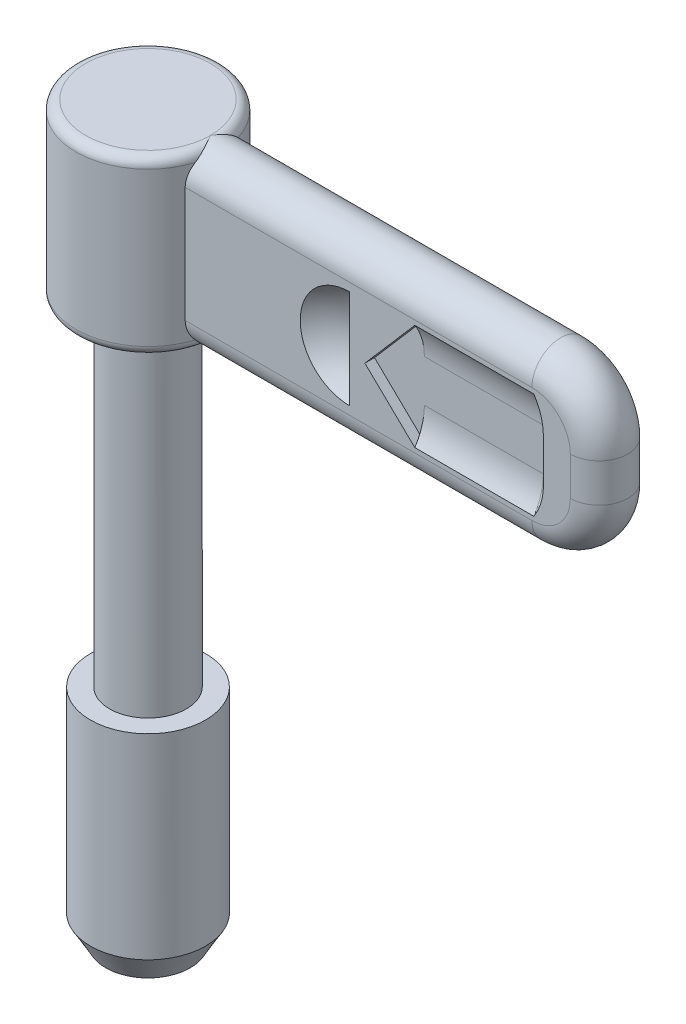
ISO-10303-21;
HEADER;
FILE_DESCRIPTION(('STEP AP214'),'2;1');
FILE_NAME('part.step','',(''),(''),'','','');
FILE_SCHEMA(('AUTOMOTIVE_DESIGN { 1 0 10303 214 1 1 1 1 }'));
ENDSEC;
DATA;
#1=APPLICATION_CONTEXT('core data for automotive mechanical design processes');
#2=APPLICATION_PROTOCOL_DEFINITION('international standard','automotive_design',2000,#1);
#3=PRODUCT_CONTEXT('',#1,'mechanical');
#4=PRODUCT('Part','Part','',(#3));
#5=PRODUCT_RELATED_PRODUCT_CATEGORY('part','',(#4));
#6=PRODUCT_DEFINITION_FORMATION('','',#4);
#7=PRODUCT_DEFINITION_CONTEXT('part definition',#1,'design');
#8=PRODUCT_DEFINITION('design','',#6,#7);
#9=PRODUCT_DEFINITION_SHAPE('','',#8);
#10=(LENGTH_UNIT() NAMED_UNIT(*) SI_UNIT(.MILLI.,.METRE.));
#11=(NAMED_UNIT(*) PLANE_ANGLE_UNIT() SI_UNIT($,.RADIAN.));
#12=(NAMED_UNIT(*) SI_UNIT($,.STERADIAN.) SOLID_ANGLE_UNIT());
#13=UNCERTAINTY_MEASURE_WITH_UNIT(LENGTH_MEASURE(1.E-05),#10,'distance_accuracy_value','');
#14=(GEOMETRIC_REPRESENTATION_CONTEXT(3) GLOBAL_UNCERTAINTY_ASSIGNED_CONTEXT((#13)) GLOBAL_UNIT_ASSIGNED_CONTEXT((#10,
#11,#12)) REPRESENTATION_CONTEXT('',''));
#15=CARTESIAN_POINT('',(0.,0.,0.));
#16=DIRECTION('',(0.,0.,1.));
#17=DIRECTION('',(1.,0.,0.));
#18=AXIS2_PLACEMENT_3D('',#15,#16,#17);
#19=CARTESIAN_POINT('',(15.4,25.241687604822,-1.5));
#20=DIRECTION('',(-1.,0.,0.));
#21=DIRECTION('',(0.,0.,1.));
#22=AXIS2_PLACEMENT_3D('',#19,#20,#21);
#23=PLANE('',#22);
#24=CARTESIAN_POINT('',(15.4,26.9000000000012,-4.0000000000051));
#25=DIRECTION('',(1.,0.,0.));
#26=DIRECTION('',(0.,-4.16851738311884E-13,1.));
#27=AXIS2_PLACEMENT_3D('',#24,#25,#26);
#28=CIRCLE('',#27,3.0000000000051);
#29=CARTESIAN_POINT('',(15.4,26.9,-1.));
#30=VERTEX_POINT('',#29);
#31=CARTESIAN_POINT('',(15.4,25.241687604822,-1.5));
#32=VERTEX_POINT('',#31);
#33=EDGE_CURVE('E193',#30,#32,#28,.T.);
#34=ORIENTED_EDGE('',*,*,#33,.T.);
#35=DIRECTION('',(0.,0.,1.));
#36=VECTOR('',#35,1.);
#37=CARTESIAN_POINT('',(15.4,25.241687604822,-1.5));
#38=LINE('',#37,#36);
#39=CARTESIAN_POINT('',(15.4,25.241687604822,-1.));
#40=VERTEX_POINT('',#39);
#41=EDGE_CURVE('E209',#40,#32,#38,.F.);
#42=ORIENTED_EDGE('',*,*,#41,.F.);
#43=DIRECTION('',(0.,1.,0.));
#44=VECTOR('',#43,1.);
#45=CARTESIAN_POINT('',(15.4,25.241687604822,-1.));
#46=LINE('',#45,#44);
#47=EDGE_CURVE('E210',#40,#30,#46,.T.);
#48=ORIENTED_EDGE('',*,*,#47,.T.);
#49=EDGE_LOOP('',(#34,#42,#48));
#50=FACE_BOUND('',#49,.T.);
#51=ADVANCED_FACE('F17',(#50),#23,.T.);
#52=CARTESIAN_POINT('',(3.43693177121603,25.,-1.5));
#53=DIRECTION('',(0.,0.,-1.));
#54=DIRECTION('',(0.,1.,0.));
#55=AXIS2_PLACEMENT_3D('',#52,#53,#54);
#56=PLANE('',#55);
#57=DIRECTION('',(2.18195849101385E-13,1.,0.));
#58=VECTOR('',#57,1.);
#59=CARTESIAN_POINT('',(3.43693177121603,25.,-1.5));
#60=LINE('',#59,#58);
#61=CARTESIAN_POINT('',(3.43693177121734,30.9999995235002,-1.5));
#62=VERTEX_POINT('',#61);
#63=CARTESIAN_POINT('',(3.43693177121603,25.,-1.5));
#64=VERTEX_POINT('',#63);
#65=EDGE_CURVE('E424',#62,#64,#60,.F.);
#66=ORIENTED_EDGE('',*,*,#65,.F.);
#67=DIRECTION('',(1.,2.63797795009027E-08,0.));
#68=VECTOR('',#67,1.);
#69=CARTESIAN_POINT('',(3.43693177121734,30.9999995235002,-1.5));
#70=LINE('',#69,#68);
#71=CARTESIAN_POINT('',(21.5,31.,-1.5));
#72=VERTEX_POINT('',#71);
#73=EDGE_CURVE('E442',#62,#72,#70,.T.);
#74=ORIENTED_EDGE('',*,*,#73,.T.);
#75=CARTESIAN_POINT('',(21.5000000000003,29.,-1.5));
#76=DIRECTION('',(0.,0.,-1.));
#77=DIRECTION('',(-1.43884903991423E-13,1.,0.));
#78=AXIS2_PLACEMENT_3D('',#75,#76,#77);
#79=CIRCLE('',#78,1.99999999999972);
#80=CARTESIAN_POINT('',(23.5,29.,-1.5));
#81=VERTEX_POINT('',#80);
#82=EDGE_CURVE('E432',#72,#81,#79,.T.);
#83=ORIENTED_EDGE('',*,*,#82,.T.);
#84=DIRECTION('',(0.,-1.,0.));
#85=VECTOR('',#84,1.);
#86=CARTESIAN_POINT('',(23.5,29.,-1.5));
#87=LINE('',#86,#85);
#88=CARTESIAN_POINT('',(23.5,27.,-1.5));
#89=VERTEX_POINT('',#88);
#90=EDGE_CURVE('E428',#81,#89,#87,.T.);
#91=ORIENTED_EDGE('',*,*,#90,.T.);
#92=CARTESIAN_POINT('',(21.5000000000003,27.,-1.5));
#93=DIRECTION('',(0.,0.,-1.));
#94=DIRECTION('',(1.,0.,0.));
#95=AXIS2_PLACEMENT_3D('',#92,#93,#94);
#96=CIRCLE('',#95,1.99999999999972);
#97=CARTESIAN_POINT('',(21.5,25.,-1.5));
#98=VERTEX_POINT('',#97);
#99=EDGE_CURVE('E228',#89,#98,#96,.T.);
#100=ORIENTED_EDGE('',*,*,#99,.T.);
#101=DIRECTION('',(-1.,0.,0.));
#102=VECTOR('',#101,1.);
#103=CARTESIAN_POINT('',(21.5,25.,-1.5));
#104=LINE('',#103,#102);
#105=EDGE_CURVE('E225',#98,#64,#104,.T.);
#106=ORIENTED_EDGE('',*,*,#105,.T.);
#107=EDGE_LOOP('',(#66,#74,#83,#91,#100,#106));
#108=FACE_BOUND('',#107,.T.);
#109=DIRECTION('',(0.719682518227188,-0.694303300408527,0.));
#110=VECTOR('',#109,1.);
#111=CARTESIAN_POINT('',(12.8,27.75,-1.5));
#112=LINE('',#111,#110);
#113=CARTESIAN_POINT('',(12.8,27.75,-1.5));
#114=VERTEX_POINT('',#113);
#115=EDGE_CURVE('E203',#114,#32,#112,.T.);
#116=ORIENTED_EDGE('',*,*,#115,.T.);
#117=DIRECTION('',(1.,0.,0.));
#118=VECTOR('',#117,1.);
#119=CARTESIAN_POINT('',(15.4,25.241687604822,-1.5));
#120=LINE('',#119,#118);
#121=CARTESIAN_POINT('',(21.6,25.241687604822,-1.5));
#122=VERTEX_POINT('',#121);
#123=EDGE_CURVE('E189',#32,#122,#120,.T.);
#124=ORIENTED_EDGE('',*,*,#123,.T.);
#125=CARTESIAN_POINT('',(22.1,26.9000000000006,-1.5));
#126=CARTESIAN_POINT('',(22.0997802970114,26.8633870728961,-1.5));
#127=CARTESIAN_POINT('',(22.0989547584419,26.8267766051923,-1.5));
#128=CARTESIAN_POINT('',(22.0960619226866,26.7535959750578,-1.5));
#129=CARTESIAN_POINT('',(22.0939943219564,26.7170258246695,-1.5));
#130=CARTESIAN_POINT('',(22.088587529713,26.6439815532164,-1.5));
#131=CARTESIAN_POINT('',(22.0852484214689,26.6075074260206,-1.5));
#132=CARTESIAN_POINT('',(22.077276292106,26.5347099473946,-1.5));
#133=CARTESIAN_POINT('',(22.0726435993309,26.4983865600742,-1.5));
#134=CARTESIAN_POINT('',(22.0620680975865,26.4259432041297,-1.5));
#135=CARTESIAN_POINT('',(22.0561257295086,26.3898231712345,-1.5));
#136=CARTESIAN_POINT('',(22.0429212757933,26.3178373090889,-1.5));
#137=CARTESIAN_POINT('',(22.0356596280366,26.2819713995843,-1.5));
#138=CARTESIAN_POINT('',(22.0198135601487,26.2105425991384,-1.5));
#139=CARTESIAN_POINT('',(22.0112294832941,26.1749796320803,-1.5));
#140=CARTESIAN_POINT('',(21.9927421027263,26.1042035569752,-1.5));
#141=CARTESIAN_POINT('',(21.9828389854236,26.0689904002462,-1.5));
#142=CARTESIAN_POINT('',(21.9617236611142,25.9989587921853,-1.5));
#143=CARTESIAN_POINT('',(21.9505114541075,25.9641403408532,-1.5));
#144=CARTESIAN_POINT('',(21.9267946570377,25.894940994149,-1.5));
#145=CARTESIAN_POINT('',(21.9142898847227,25.8605601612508,-1.5));
#146=CARTESIAN_POINT('',(21.8880111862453,25.7922769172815,-1.5));
#147=CARTESIAN_POINT('',(21.8742369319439,25.7583746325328,-1.5));
#148=CARTESIAN_POINT('',(21.8454489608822,25.6910873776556,-1.5));
#149=CARTESIAN_POINT('',(21.830434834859,25.6577025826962,-1.5));
#150=CARTESIAN_POINT('',(21.7992031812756,25.5914872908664,-1.5));
#151=CARTESIAN_POINT('',(21.7829852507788,25.5586569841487,-1.5));
#152=CARTESIAN_POINT('',(21.7493883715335,25.4935856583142,-1.5));
#153=CARTESIAN_POINT('',(21.7320091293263,25.4613447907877,-1.5));
#154=CARTESIAN_POINT('',(21.6961380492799,25.3974858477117,-1.5));
#155=CARTESIAN_POINT('',(21.677646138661,25.3658678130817,-1.5));
#156=CARTESIAN_POINT('',(21.6396047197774,25.3032848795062,-1.5));
#157=CARTESIAN_POINT('',(21.6200554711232,25.2723198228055,-1.5));
#158=CARTESIAN_POINT('',(21.6,25.241687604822,-1.5));
#159=B_SPLINE_CURVE_WITH_KNOTS('',3,(#125,#126,#127,#128,#129,#130,#131,#132,#133,#134,#135,
#136,#137,#138,#139,#140,#141,#142,#143,#144,#145,#146,#147,#148,#149,#150,#151,#152,#153,#154,
#155,#156,#157,#158),.UNSPECIFIED.,.F.,.F.,(4,2,2,2,2,2,2,2,2,2,2,2,2,2,2,2,4),(0.,
0.109837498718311,0.219701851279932,0.329559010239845,0.439388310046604,0.549180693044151,
0.658936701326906,0.768664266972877,0.878376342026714,0.988088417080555,1.09781598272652,
1.20757199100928,1.31736437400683,1.42719367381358,1.5370508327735,1.64691518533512,
1.75675268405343),.UNSPECIFIED.);
#160=CARTESIAN_POINT('',(22.1,26.9000000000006,-1.5));
#161=VERTEX_POINT('',#160);
#162=EDGE_CURVE('E202',#161,#122,#159,.T.);
#163=ORIENTED_EDGE('',*,*,#162,.F.);
#164=DIRECTION('',(0.,1.,0.));
#165=VECTOR('',#164,1.);
#166=CARTESIAN_POINT('',(22.1,26.9000000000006,-1.5));
#167=LINE('',#166,#165);
#168=CARTESIAN_POINT('',(22.1,29.1,-1.5));
#169=VERTEX_POINT('',#168);
#170=EDGE_CURVE('E243',#161,#169,#167,.T.);
#171=ORIENTED_EDGE('',*,*,#170,.T.);
#172=CARTESIAN_POINT('',(21.6,30.758312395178,-1.5));
#173=CARTESIAN_POINT('',(21.6200554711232,30.7276801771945,-1.5));
#174=CARTESIAN_POINT('',(21.6396047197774,30.6967151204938,-1.5));
#175=CARTESIAN_POINT('',(21.677646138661,30.6341321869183,-1.5));
#176=CARTESIAN_POINT('',(21.6961380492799,30.6025141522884,-1.5));
#177=CARTESIAN_POINT('',(21.7320091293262,30.5386552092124,-1.5));
#178=CARTESIAN_POINT('',(21.7493883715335,30.5064143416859,-1.5));
#179=CARTESIAN_POINT('',(21.7829852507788,30.4413430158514,-1.5));
#180=CARTESIAN_POINT('',(21.7992031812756,30.4085127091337,-1.5));
#181=CARTESIAN_POINT('',(21.8304348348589,30.342297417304,-1.5));
#182=CARTESIAN_POINT('',(21.8454489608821,30.3089126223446,-1.5));
#183=CARTESIAN_POINT('',(21.8742369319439,30.2416253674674,-1.5));
#184=CARTESIAN_POINT('',(21.8880111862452,30.2077230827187,-1.5));
#185=CARTESIAN_POINT('',(21.9142898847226,30.1394398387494,-1.5));
#186=CARTESIAN_POINT('',(21.9267946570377,30.1050590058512,-1.5));
#187=CARTESIAN_POINT('',(21.9505114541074,30.035859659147,-1.5));
#188=CARTESIAN_POINT('',(21.9617236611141,30.001041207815,-1.5));
#189=CARTESIAN_POINT('',(21.9828389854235,29.9310095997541,-1.5));
#190=CARTESIAN_POINT('',(21.9927421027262,29.8957964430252,-1.5));
#191=CARTESIAN_POINT('',(22.011229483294,29.8250203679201,-1.5));
#192=CARTESIAN_POINT('',(22.0198135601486,29.789457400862,-1.5));
#193=CARTESIAN_POINT('',(22.0356596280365,29.7180286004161,-1.5));
#194=CARTESIAN_POINT('',(22.0429212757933,29.6821626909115,-1.5));
#195=CARTESIAN_POINT('',(22.0561257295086,29.6101768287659,-1.5));
#196=CARTESIAN_POINT('',(22.0620680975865,29.5740567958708,-1.5));
#197=CARTESIAN_POINT('',(22.0726435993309,29.5016134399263,-1.5));
#198=CARTESIAN_POINT('',(22.077276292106,29.4652900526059,-1.5));
#199=CARTESIAN_POINT('',(22.0852484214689,29.3924925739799,-1.5));
#200=CARTESIAN_POINT('',(22.088587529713,29.3560184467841,-1.5));
#201=CARTESIAN_POINT('',(22.0939943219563,29.282974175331,-1.5));
#202=CARTESIAN_POINT('',(22.0960619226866,29.2464040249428,-1.5));
#203=CARTESIAN_POINT('',(22.0989547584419,29.1732233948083,-1.5));
#204=CARTESIAN_POINT('',(22.0997802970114,29.1366129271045,-1.5));
#205=CARTESIAN_POINT('',(22.1,29.1,-1.5));
#206=B_SPLINE_CURVE_WITH_KNOTS('',3,(#172,#173,#174,#175,#176,#177,#178,#179,#180,#181,#182,
#183,#184,#185,#186,#187,#188,#189,#190,#191,#192,#193,#194,#195,#196,#197,#198,#199,#200,#201,
#202,#203,#204,#205),.UNSPECIFIED.,.F.,.F.,(4,2,2,2,2,2,2,2,2,2,2,2,2,2,2,2,4),(0.,
0.109837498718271,0.219701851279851,0.329559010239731,0.439388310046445,0.549180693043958,
0.658936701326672,0.768664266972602,0.878376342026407,0.988088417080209,1.09781598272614,
1.20757199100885,1.31736437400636,1.42719367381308,1.53705083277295,1.64691518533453,
1.7567526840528),.UNSPECIFIED.);
#207=CARTESIAN_POINT('',(21.6,30.758312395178,-1.5));
#208=VERTEX_POINT('',#207);
#209=EDGE_CURVE('E691',#208,#169,#206,.T.);
#210=ORIENTED_EDGE('',*,*,#209,.F.);
#211=DIRECTION('',(-1.,0.,0.));
#212=VECTOR('',#211,1.);
#213=CARTESIAN_POINT('',(21.6,30.758312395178,-1.5));
#214=LINE('',#213,#212);
#215=CARTESIAN_POINT('',(15.4,30.758312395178,-1.5));
#216=VERTEX_POINT('',#215);
#217=EDGE_CURVE('E1444',#216,#208,#214,.F.);
#218=ORIENTED_EDGE('',*,*,#217,.F.);
#219=DIRECTION('',(-0.653895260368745,-0.756585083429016,0.));
#220=VECTOR('',#219,1.);
#221=CARTESIAN_POINT('',(15.4,30.758312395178,-1.5));
#222=LINE('',#221,#220);
#223=EDGE_CURVE('E224',#216,#114,#222,.T.);
#224=ORIENTED_EDGE('',*,*,#223,.T.);
#225=EDGE_LOOP('',(#116,#124,#163,#171,#210,#218,#224));
#226=FACE_BOUND('',#225,.T.);
#227=DIRECTION('',(0.,1.,0.));
#228=VECTOR('',#227,1.);
#229=CARTESIAN_POINT('',(12.,25.430953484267,-1.5));
#230=LINE('',#229,#228);
#231=CARTESIAN_POINT('',(12.,25.430953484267,-1.5));
#232=VERTEX_POINT('',#231);
#233=CARTESIAN_POINT('',(12.,30.569046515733,-1.5));
#234=VERTEX_POINT('',#233);
#235=EDGE_CURVE('E1442',#232,#234,#230,.T.);
#236=ORIENTED_EDGE('',*,*,#235,.T.);
#237=CARTESIAN_POINT('',(12.,30.569046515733,-1.5));
#238=CARTESIAN_POINT('',(11.8604662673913,30.569046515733,-1.5));
#239=CARTESIAN_POINT('',(11.7251672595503,30.558257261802,-1.5));
#240=CARTESIAN_POINT('',(11.4614528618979,30.5161788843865,-1.5));
#241=CARTESIAN_POINT('',(11.3330374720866,30.4848897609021,-1.5));
#242=CARTESIAN_POINT('',(10.9180636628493,30.349608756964,-1.5));
#243=CARTESIAN_POINT('',(10.6751190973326,30.2176773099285,-1.5));
#244=CARTESIAN_POINT('',(10.1926951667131,29.8569578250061,-1.5));
#245=CARTESIAN_POINT('',(9.96213756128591,29.6004957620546,-1.5));
#246=CARTESIAN_POINT('',(9.19003735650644,28.3008382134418,-1.5));
#247=CARTESIAN_POINT('',(9.35292610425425,27.0138934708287,-1.5));
#248=CARTESIAN_POINT('',(10.3717569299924,25.9950626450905,-1.5));
#249=CARTESIAN_POINT('',(10.5851466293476,25.8366086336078,-1.5));
#250=CARTESIAN_POINT('',(11.0064475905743,25.6232428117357,-1.5));
#251=CARTESIAN_POINT('',(11.1899669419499,25.55356956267,-1.5));
#252=CARTESIAN_POINT('',(11.58418094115,25.4558125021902,-1.5));
#253=CARTESIAN_POINT('',(11.7896180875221,25.4309534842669,-1.5));
#254=CARTESIAN_POINT('',(12.,25.4309534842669,-1.5));
#255=B_SPLINE_CURVE_WITH_KNOTS('',3,(#237,#238,#239,#240,#241,#242,#243,#244,#245,#246,#247,
#248,#249,#250,#251,#252,#253,#254),.UNSPECIFIED.,.F.,.F.,(4,2,2,2,2,2,2,2,4),(0.,
0.042961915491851,0.0859238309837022,0.184717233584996,0.310914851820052,0.758114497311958,
0.859535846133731,0.928561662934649,1.),.UNSPECIFIED.);
#256=EDGE_CURVE('E277',#234,#232,#255,.T.);
#257=ORIENTED_EDGE('',*,*,#256,.T.);
#258=EDGE_LOOP('',(#236,#257));
#259=FACE_BOUND('',#258,.T.);
#260=ADVANCED_FACE('F220',(#108,#226,#259),#56,.T.);
#261=CARTESIAN_POINT('',(3.43693177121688,25.,1.5));
#262=DIRECTION('',(0.,0.,1.));
#263=DIRECTION('',(1.,0.,0.));
#264=AXIS2_PLACEMENT_3D('',#261,#262,#263);
#265=PLANE('',#264);
#266=DIRECTION('',(-1.,-1.82876122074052E-08,0.));
#267=VECTOR('',#266,1.);
#268=CARTESIAN_POINT('',(21.5,31.,1.5));
#269=LINE('',#268,#267);
#270=CARTESIAN_POINT('',(21.5,31.,1.5));
#271=VERTEX_POINT('',#270);
#272=CARTESIAN_POINT('',(3.4369317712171,30.9999996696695,1.5));
#273=VERTEX_POINT('',#272);
#274=EDGE_CURVE('E268',#271,#273,#269,.T.);
#275=ORIENTED_EDGE('',*,*,#274,.T.);
#276=DIRECTION('',(0.,-1.,0.));
#277=VECTOR('',#276,1.);
#278=CARTESIAN_POINT('',(3.4369317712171,30.9999996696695,1.5));
#279=LINE('',#278,#277);
#280=CARTESIAN_POINT('',(3.43693177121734,25.0000004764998,1.5));
#281=VERTEX_POINT('',#280);
#282=EDGE_CURVE('E276',#273,#281,#279,.T.);
#283=ORIENTED_EDGE('',*,*,#282,.T.);
#284=DIRECTION('',(1.,-2.63797796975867E-08,0.));
#285=VECTOR('',#284,1.);
#286=CARTESIAN_POINT('',(3.43693177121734,25.0000004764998,1.5));
#287=LINE('',#286,#285);
#288=CARTESIAN_POINT('',(21.5,25.,1.5));
#289=VERTEX_POINT('',#288);
#290=EDGE_CURVE('E282',#281,#289,#287,.T.);
#291=ORIENTED_EDGE('',*,*,#290,.T.);
#292=CARTESIAN_POINT('',(21.5000000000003,27.,1.5));
#293=DIRECTION('',(0.,0.,1.));
#294=DIRECTION('',(-1.59872115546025E-13,-1.,0.));
#295=AXIS2_PLACEMENT_3D('',#292,#293,#294);
#296=CIRCLE('',#295,1.99999999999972);
#297=CARTESIAN_POINT('',(23.5,27.,1.5));
#298=VERTEX_POINT('',#297);
#299=EDGE_CURVE('E287',#289,#298,#296,.T.);
#300=ORIENTED_EDGE('',*,*,#299,.T.);
#301=DIRECTION('',(0.,1.,0.));
#302=VECTOR('',#301,1.);
#303=CARTESIAN_POINT('',(23.5,27.,1.5));
#304=LINE('',#303,#302);
#305=CARTESIAN_POINT('',(23.5,29.,1.5));
#306=VERTEX_POINT('',#305);
#307=EDGE_CURVE('E292',#298,#306,#304,.T.);
#308=ORIENTED_EDGE('',*,*,#307,.T.);
#309=CARTESIAN_POINT('',(21.5000000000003,29.,1.5));
#310=DIRECTION('',(0.,0.,1.));
#311=DIRECTION('',(1.,0.,0.));
#312=AXIS2_PLACEMENT_3D('',#309,#310,#311);
#313=CIRCLE('',#312,1.99999999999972);
#314=EDGE_CURVE('E297',#306,#271,#313,.T.);
#315=ORIENTED_EDGE('',*,*,#314,.T.);
#316=EDGE_LOOP('',(#275,#283,#291,#300,#308,#315));
#317=FACE_BOUND('',#316,.T.);
#318=DIRECTION('',(0.653895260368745,0.756585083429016,0.));
#319=VECTOR('',#318,1.);
#320=CARTESIAN_POINT('',(12.8,27.75,1.5));
#321=LINE('',#320,#319);
#322=CARTESIAN_POINT('',(15.4,30.758312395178,1.5));
#323=VERTEX_POINT('',#322);
#324=CARTESIAN_POINT('',(12.8,27.75,1.5));
#325=VERTEX_POINT('',#324);
#326=EDGE_CURVE('E302',#323,#325,#321,.F.);
#327=ORIENTED_EDGE('',*,*,#326,.F.);
#328=DIRECTION('',(1.,0.,0.));
#329=VECTOR('',#328,1.);
#330=CARTESIAN_POINT('',(15.4,30.758312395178,1.5));
#331=LINE('',#330,#329);
#332=CARTESIAN_POINT('',(21.6,30.758312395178,1.5));
#333=VERTEX_POINT('',#332);
#334=EDGE_CURVE('E307',#323,#333,#331,.T.);
#335=ORIENTED_EDGE('',*,*,#334,.T.);
#336=CARTESIAN_POINT('',(22.1,29.0999999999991,1.5));
#337=CARTESIAN_POINT('',(22.0997802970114,29.1366129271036,1.5));
#338=CARTESIAN_POINT('',(22.0989547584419,29.1732233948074,1.5));
#339=CARTESIAN_POINT('',(22.0960619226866,29.246404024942,1.5));
#340=CARTESIAN_POINT('',(22.0939943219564,29.2829741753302,1.5));
#341=CARTESIAN_POINT('',(22.088587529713,29.3560184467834,1.5));
#342=CARTESIAN_POINT('',(22.085248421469,29.3924925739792,1.5));
#343=CARTESIAN_POINT('',(22.0772762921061,29.4652900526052,1.5));
#344=CARTESIAN_POINT('',(22.072643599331,29.5016134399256,1.5));
#345=CARTESIAN_POINT('',(22.0620680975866,29.5740567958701,1.5));
#346=CARTESIAN_POINT('',(22.0561257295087,29.6101768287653,1.5));
#347=CARTESIAN_POINT('',(22.0429212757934,29.6821626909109,1.5));
#348=CARTESIAN_POINT('',(22.0356596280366,29.7180286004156,1.5));
#349=CARTESIAN_POINT('',(22.0198135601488,29.7894574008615,1.5));
#350=CARTESIAN_POINT('',(22.0112294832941,29.8250203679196,1.5));
#351=CARTESIAN_POINT('',(21.9927421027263,29.8957964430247,1.5));
#352=CARTESIAN_POINT('',(21.9828389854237,29.9310095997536,1.5));
#353=CARTESIAN_POINT('',(21.9617236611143,30.0010412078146,1.5));
#354=CARTESIAN_POINT('',(21.9505114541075,30.0358596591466,1.5));
#355=CARTESIAN_POINT('',(21.9267946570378,30.1050590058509,1.5));
#356=CARTESIAN_POINT('',(21.9142898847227,30.1394398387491,1.5));
#357=CARTESIAN_POINT('',(21.8880111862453,30.2077230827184,1.5));
#358=CARTESIAN_POINT('',(21.874236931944,30.2416253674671,1.5));
#359=CARTESIAN_POINT('',(21.8454489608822,30.3089126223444,1.5));
#360=CARTESIAN_POINT('',(21.830434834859,30.3422974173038,1.5));
#361=CARTESIAN_POINT('',(21.7992031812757,30.4085127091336,1.5));
#362=CARTESIAN_POINT('',(21.7829852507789,30.4413430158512,1.5));
#363=CARTESIAN_POINT('',(21.7493883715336,30.5064143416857,1.5));
#364=CARTESIAN_POINT('',(21.7320091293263,30.5386552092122,1.5));
#365=CARTESIAN_POINT('',(21.6961380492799,30.6025141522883,1.5));
#366=CARTESIAN_POINT('',(21.677646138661,30.6341321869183,1.5));
#367=CARTESIAN_POINT('',(21.6396047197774,30.6967151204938,1.5));
#368=CARTESIAN_POINT('',(21.6200554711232,30.7276801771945,1.5));
#369=CARTESIAN_POINT('',(21.6,30.758312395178,1.5));
#370=B_SPLINE_CURVE_WITH_KNOTS('',3,(#336,#337,#338,#339,#340,#341,#342,#343,#344,#345,#346,
#347,#348,#349,#350,#351,#352,#353,#354,#355,#356,#357,#358,#359,#360,#361,#362,#363,#364,#365,
#366,#367,#368,#369),.UNSPECIFIED.,.F.,.F.,(4,2,2,2,2,2,2,2,2,2,2,2,2,2,2,2,4),(0.,
0.109837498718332,0.21970185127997,0.329559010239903,0.439388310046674,0.549180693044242,
0.658936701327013,0.768664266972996,0.878376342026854,0.988088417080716,1.0978159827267,
1.20757199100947,1.31736437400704,1.42719367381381,1.53705083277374,1.64691518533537,
1.7567526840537),.UNSPECIFIED.);
#371=CARTESIAN_POINT('',(22.1,29.0999999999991,1.5));
#372=VERTEX_POINT('',#371);
#373=EDGE_CURVE('E312',#372,#333,#370,.T.);
#374=ORIENTED_EDGE('',*,*,#373,.F.);
#375=DIRECTION('',(0.,-1.,0.));
#376=VECTOR('',#375,1.);
#377=CARTESIAN_POINT('',(22.1,29.0999999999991,1.5));
#378=LINE('',#377,#376);
#379=CARTESIAN_POINT('',(22.1,26.9,1.5));
#380=VERTEX_POINT('',#379);
#381=EDGE_CURVE('E322',#372,#380,#378,.T.);
#382=ORIENTED_EDGE('',*,*,#381,.T.);
#383=CARTESIAN_POINT('',(21.6,25.241687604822,1.5));
#384=CARTESIAN_POINT('',(21.6200554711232,25.2723198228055,1.5));
#385=CARTESIAN_POINT('',(21.6396047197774,25.3032848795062,1.5));
#386=CARTESIAN_POINT('',(21.677646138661,25.3658678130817,1.5));
#387=CARTESIAN_POINT('',(21.6961380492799,25.3974858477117,1.5));
#388=CARTESIAN_POINT('',(21.7320091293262,25.4613447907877,1.5));
#389=CARTESIAN_POINT('',(21.7493883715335,25.4935856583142,1.5));
#390=CARTESIAN_POINT('',(21.7829852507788,25.5586569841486,1.5));
#391=CARTESIAN_POINT('',(21.7992031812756,25.5914872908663,1.5));
#392=CARTESIAN_POINT('',(21.830434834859,25.6577025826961,1.5));
#393=CARTESIAN_POINT('',(21.8454489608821,25.6910873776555,1.5));
#394=CARTESIAN_POINT('',(21.8742369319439,25.7583746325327,1.5));
#395=CARTESIAN_POINT('',(21.8880111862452,25.7922769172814,1.5));
#396=CARTESIAN_POINT('',(21.9142898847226,25.8605601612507,1.5));
#397=CARTESIAN_POINT('',(21.9267946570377,25.8949409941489,1.5));
#398=CARTESIAN_POINT('',(21.9505114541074,25.9641403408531,1.5));
#399=CARTESIAN_POINT('',(21.9617236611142,25.9989587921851,1.5));
#400=CARTESIAN_POINT('',(21.9828389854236,26.0689904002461,1.5));
#401=CARTESIAN_POINT('',(21.9927421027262,26.104203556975,1.5));
#402=CARTESIAN_POINT('',(22.011229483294,26.1749796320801,1.5));
#403=CARTESIAN_POINT('',(22.0198135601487,26.2105425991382,1.5));
#404=CARTESIAN_POINT('',(22.0356596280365,26.281971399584,1.5));
#405=CARTESIAN_POINT('',(22.0429212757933,26.3178373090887,1.5));
#406=CARTESIAN_POINT('',(22.0561257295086,26.3898231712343,1.5));
#407=CARTESIAN_POINT('',(22.0620680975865,26.4259432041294,1.5));
#408=CARTESIAN_POINT('',(22.0726435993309,26.4983865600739,1.5));
#409=CARTESIAN_POINT('',(22.077276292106,26.5347099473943,1.5));
#410=CARTESIAN_POINT('',(22.0852484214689,26.6075074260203,1.5));
#411=CARTESIAN_POINT('',(22.088587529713,26.6439815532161,1.5));
#412=CARTESIAN_POINT('',(22.0939943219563,26.7170258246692,1.5));
#413=CARTESIAN_POINT('',(22.0960619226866,26.7535959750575,1.5));
#414=CARTESIAN_POINT('',(22.0989547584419,26.826776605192,1.5));
#415=CARTESIAN_POINT('',(22.0997802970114,26.8633870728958,1.5));
#416=CARTESIAN_POINT('',(22.1,26.9000000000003,1.5));
#417=B_SPLINE_CURVE_WITH_KNOTS('',3,(#383,#384,#385,#386,#387,#388,#389,#390,#391,#392,#393,
#394,#395,#396,#397,#398,#399,#400,#401,#402,#403,#404,#405,#406,#407,#408,#409,#410,#411,#412,
#413,#414,#415,#416),.UNSPECIFIED.,.F.,.F.,(4,2,2,2,2,2,2,2,2,2,2,2,2,2,2,2,4),(0.,
0.109837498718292,0.219701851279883,0.329559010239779,0.439388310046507,0.549180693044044,
0.658936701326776,0.768664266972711,0.878376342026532,0.988088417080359,1.0978159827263,
1.20757199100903,1.31736437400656,1.42719367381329,1.53705083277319,1.64691518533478,
1.75675268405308),.UNSPECIFIED.);
#418=CARTESIAN_POINT('',(21.6,25.241687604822,1.5));
#419=VERTEX_POINT('',#418);
#420=EDGE_CURVE('E329',#419,#380,#417,.T.);
#421=ORIENTED_EDGE('',*,*,#420,.F.);
#422=DIRECTION('',(-1.,0.,0.));
#423=VECTOR('',#422,1.);
#424=CARTESIAN_POINT('',(21.6,25.241687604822,1.5));
#425=LINE('',#424,#423);
#426=CARTESIAN_POINT('',(15.4,25.241687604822,1.5));
#427=VERTEX_POINT('',#426);
#428=EDGE_CURVE('E339',#427,#419,#425,.F.);
#429=ORIENTED_EDGE('',*,*,#428,.F.);
#430=DIRECTION('',(-0.719682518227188,0.694303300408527,0.));
#431=VECTOR('',#430,1.);
#432=CARTESIAN_POINT('',(15.4,25.241687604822,1.5));
#433=LINE('',#432,#431);
#434=EDGE_CURVE('E346',#325,#427,#433,.F.);
#435=ORIENTED_EDGE('',*,*,#434,.F.);
#436=EDGE_LOOP('',(#327,#335,#374,#382,#421,#429,#435));
#437=FACE_BOUND('',#436,.T.);
#438=CARTESIAN_POINT('',(12.,30.569046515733,1.5));
#439=CARTESIAN_POINT('',(11.9582370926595,30.5690491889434,1.50000165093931));
#440=CARTESIAN_POINT('',(11.9164737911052,30.5680358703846,1.50000705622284));
#441=CARTESIAN_POINT('',(11.8333649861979,30.5639908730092,1.50001785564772));
#442=CARTESIAN_POINT('',(11.7920187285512,30.5609746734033,1.5000232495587));
#443=CARTESIAN_POINT('',(11.7097099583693,30.552955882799,1.50002675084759));
#444=CARTESIAN_POINT('',(11.6687465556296,30.5479624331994,1.50002489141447));
#445=CARTESIAN_POINT('',(11.5871842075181,30.5360141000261,1.50001585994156));
#446=CARTESIAN_POINT('',(11.5465847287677,30.5290628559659,1.50000869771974));
#447=CARTESIAN_POINT('',(11.4657484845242,30.5132128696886,1.49999399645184));
#448=CARTESIAN_POINT('',(11.4255118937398,30.5043132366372,1.49998645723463));
#449=CARTESIAN_POINT('',(11.3454198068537,30.4845716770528,1.49997618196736));
#450=CARTESIAN_POINT('',(11.3055654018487,30.4737253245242,1.49997345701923));
#451=CARTESIAN_POINT('',(11.2262777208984,30.4500884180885,1.49997532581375));
#452=CARTESIAN_POINT('',(11.1868465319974,30.4372908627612,1.49997994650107));
#453=CARTESIAN_POINT('',(11.1084689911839,30.4097413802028,1.49999065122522));
#454=CARTESIAN_POINT('',(11.0695257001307,30.3949807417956,1.49999674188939));
#455=CARTESIAN_POINT('',(10.9923719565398,30.3635644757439,1.50000265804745));
#456=CARTESIAN_POINT('',(10.9541621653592,30.3469072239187,1.50000247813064));
#457=CARTESIAN_POINT('',(10.8787589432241,30.3118282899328,1.50000176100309));
#458=CARTESIAN_POINT('',(10.8415618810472,30.2934144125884,1.50000122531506));
#459=CARTESIAN_POINT('',(10.7681900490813,30.2548440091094,1.49999346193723));
#460=CARTESIAN_POINT('',(10.7320131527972,30.2346915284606,1.49998624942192));
#461=CARTESIAN_POINT('',(10.66070034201,30.19267111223,1.49996757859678));
#462=CARTESIAN_POINT('',(10.6255637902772,30.1708042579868,1.49995612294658));
#463=CARTESIAN_POINT('',(10.5563669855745,30.1253840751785,1.49993212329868));
#464=CARTESIAN_POINT('',(10.5223074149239,30.1018297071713,1.49991957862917));
#465=CARTESIAN_POINT('',(10.4553136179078,30.0530680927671,1.49989741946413));
#466=CARTESIAN_POINT('',(10.4223811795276,30.0278583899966,1.49988780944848));
#467=CARTESIAN_POINT('',(10.3577022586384,29.9758249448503,1.49987495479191));
#468=CARTESIAN_POINT('',(10.3259584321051,29.9489979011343,1.4998717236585));
#469=CARTESIAN_POINT('',(10.2637264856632,29.8937748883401,1.49987396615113));
#470=CARTESIAN_POINT('',(10.2332416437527,29.865375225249,1.49987946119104));
#471=CARTESIAN_POINT('',(10.1736041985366,29.8070590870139,1.49990005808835));
#472=CARTESIAN_POINT('',(10.1444552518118,29.7771388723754,1.49991518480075));
#473=CARTESIAN_POINT('',(10.0875705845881,29.7158413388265,1.49995446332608));
#474=CARTESIAN_POINT('',(10.0598386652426,29.6844604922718,1.49997863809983));
#475=CARTESIAN_POINT('',(10.0058712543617,29.6203094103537,1.50003408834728));
#476=CARTESIAN_POINT('',(9.97963948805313,29.5875360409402,1.50006538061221));
#477=CARTESIAN_POINT('',(9.92875566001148,29.5206758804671,1.50013208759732));
#478=CARTESIAN_POINT('',(9.90410704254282,29.4865864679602,1.50016751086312));
#479=CARTESIAN_POINT('',(9.85647084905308,29.4171785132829,1.50023883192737));
#480=CARTESIAN_POINT('',(9.83348624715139,29.3818579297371,1.50027473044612));
#481=CARTESIAN_POINT('',(9.78925560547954,29.3100801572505,1.50034312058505));
#482=CARTESIAN_POINT('',(9.76801189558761,29.2736215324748,1.50037560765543));
#483=CARTESIAN_POINT('',(9.72733501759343,29.1996681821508,1.50043350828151));
#484=CARTESIAN_POINT('',(9.70790337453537,29.1621726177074,1.50045891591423));
#485=CARTESIAN_POINT('',(9.67091550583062,29.0862534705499,1.50049963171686));
#486=CARTESIAN_POINT('',(9.65335985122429,29.0478296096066,1.50051493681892));
#487=CARTESIAN_POINT('',(9.62018033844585,28.9701689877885,1.50053343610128));
#488=CARTESIAN_POINT('',(9.60455595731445,28.9309324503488,1.50053663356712));
#489=CARTESIAN_POINT('',(9.5752856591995,28.85176796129,1.50053021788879));
#490=CARTESIAN_POINT('',(9.56163799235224,28.8118406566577,1.50052061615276));
#491=CARTESIAN_POINT('',(9.53635704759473,28.7314217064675,1.50048941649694));
#492=CARTESIAN_POINT('',(9.52472066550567,28.6909310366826,1.50046783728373));
#493=CARTESIAN_POINT('',(9.50348663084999,28.6095171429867,1.5004151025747));
#494=CARTESIAN_POINT('',(9.49388439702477,28.5685951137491,1.50038396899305));
#495=CARTESIAN_POINT('',(9.4767307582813,28.4864540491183,1.50031613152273));
#496=CARTESIAN_POINT('',(9.469173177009,28.4452363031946,1.50027944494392));
#497=CARTESIAN_POINT('',(9.45610826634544,28.362642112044,1.50020592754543));
#498=CARTESIAN_POINT('',(9.45059305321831,28.3212669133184,1.50016909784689));
#499=CARTESIAN_POINT('',(9.44159928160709,28.238497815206,1.50010194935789));
#500=CARTESIAN_POINT('',(9.43811102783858,28.1971049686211,1.50007160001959));
#501=CARTESIAN_POINT('',(9.43314479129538,28.1144412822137,1.50002464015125));
#502=CARTESIAN_POINT('',(9.43165520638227,28.0731711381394,1.50000795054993));
#503=CARTESIAN_POINT('',(9.4306439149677,27.9907111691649,1.49999662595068));
#504=CARTESIAN_POINT('',(9.4311172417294,27.9495214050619,1.50000193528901));
#505=CARTESIAN_POINT('',(9.43403811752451,27.8669064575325,1.5000273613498));
#506=CARTESIAN_POINT('',(9.43650025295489,27.8254817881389,1.50004758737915));
#507=CARTESIAN_POINT('',(9.44344068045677,27.7425213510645,1.50009759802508));
#508=CARTESIAN_POINT('',(9.44793240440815,27.7009867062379,1.5001274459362));
#509=CARTESIAN_POINT('',(9.4589618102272,27.6179533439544,1.50019123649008));
#510=CARTESIAN_POINT('',(9.4655107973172,27.5764561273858,1.50022520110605));
#511=CARTESIAN_POINT('',(9.48067047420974,27.4936440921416,1.50029243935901));
#512=CARTESIAN_POINT('',(9.48929043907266,27.4523309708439,1.50032570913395));
#513=CARTESIAN_POINT('',(9.50859396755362,27.3700318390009,1.50038770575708));
#514=CARTESIAN_POINT('',(9.5192848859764,27.3290475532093,1.50041641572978));
#515=CARTESIAN_POINT('',(9.54271864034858,27.2475479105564,1.50046665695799));
#516=CARTESIAN_POINT('',(9.55546703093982,27.2070341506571,1.50048816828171));
#517=CARTESIAN_POINT('',(9.58299100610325,27.1266133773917,1.50052270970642));
#518=CARTESIAN_POINT('',(9.59777047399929,27.0867076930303,1.50053572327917));
#519=CARTESIAN_POINT('',(9.62931957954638,27.0076358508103,1.50055330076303));
#520=CARTESIAN_POINT('',(9.64609156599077,26.968470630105,1.50055785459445));
#521=CARTESIAN_POINT('',(9.68157734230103,26.8910065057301,1.50055975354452));
#522=CARTESIAN_POINT('',(9.70029209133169,26.8527080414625,1.50055709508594));
#523=CARTESIAN_POINT('',(9.73960485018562,26.777097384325,1.50054678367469));
#524=CARTESIAN_POINT('',(9.76020258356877,26.7397850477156,1.50053913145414));
#525=CARTESIAN_POINT('',(9.80321395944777,26.6662590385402,1.50052168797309));
#526=CARTESIAN_POINT('',(9.82562625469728,26.6300445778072,1.50051189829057));
#527=CARTESIAN_POINT('',(9.87219215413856,26.5588185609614,1.50049327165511));
#528=CARTESIAN_POINT('',(9.89634351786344,26.5238055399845,1.50048443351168));
#529=CARTESIAN_POINT('',(9.94630745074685,26.455078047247,1.50047058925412));
#530=CARTESIAN_POINT('',(9.97211707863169,26.4213614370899,1.50046557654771));
#531=CARTESIAN_POINT('',(10.0253138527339,26.3553135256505,1.50046159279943));
#532=CARTESIAN_POINT('',(10.0526975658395,26.3229794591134,1.50046260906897));
#533=CARTESIAN_POINT('',(10.1089573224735,26.2597743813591,1.50047179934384));
#534=CARTESIAN_POINT('',(10.1378296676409,26.2289000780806,1.50047995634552));
#535=CARTESIAN_POINT('',(10.1969822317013,26.1686832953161,1.50050310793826));
#536=CARTESIAN_POINT('',(10.2272587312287,26.1393371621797,1.50051808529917));
#537=CARTESIAN_POINT('',(10.2891382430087,26.0822367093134,1.50055291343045));
#538=CARTESIAN_POINT('',(10.320737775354,26.0544786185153,1.50057275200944));
#539=CARTESIAN_POINT('',(10.3851875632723,26.0006058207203,1.50061368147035));
#540=CARTESIAN_POINT('',(10.4180348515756,25.9744875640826,1.50063476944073));
#541=CARTESIAN_POINT('',(10.4849124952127,25.9239381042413,1.50067316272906));
#542=CARTESIAN_POINT('',(10.5189406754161,25.8995040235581,1.50069047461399));
#543=CARTESIAN_POINT('',(10.5881231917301,25.8523593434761,1.50071544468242));
#544=CARTESIAN_POINT('',(10.6232764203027,25.8296471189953,1.50072311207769));
#545=CARTESIAN_POINT('',(10.6946654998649,25.7859761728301,1.50072302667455));
#546=CARTESIAN_POINT('',(10.73090156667,25.7650178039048,1.50071527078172));
#547=CARTESIAN_POINT('',(10.804428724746,25.7248790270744,1.50068020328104));
#548=CARTESIAN_POINT('',(10.8417215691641,25.7057018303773,1.5006528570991));
#549=CARTESIAN_POINT('',(10.9173532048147,25.6691457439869,1.5005777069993));
#550=CARTESIAN_POINT('',(10.9556954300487,25.6517739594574,1.50052982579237));
#551=CARTESIAN_POINT('',(11.0334371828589,25.6188447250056,1.5004198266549));
#552=CARTESIAN_POINT('',(11.0728418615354,25.6032994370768,1.50035762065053));
#553=CARTESIAN_POINT('',(11.1527437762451,25.5740415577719,1.50023045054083));
#554=CARTESIAN_POINT('',(11.193247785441,25.5603474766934,1.50016546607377));
#555=CARTESIAN_POINT('',(11.2753912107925,25.5347980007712,1.50007240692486));
#556=CARTESIAN_POINT('',(11.3170385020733,25.5229679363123,1.50004480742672));
#557=CARTESIAN_POINT('',(11.400908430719,25.5013815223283,1.50002290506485));
#558=CARTESIAN_POINT('',(11.4431315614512,25.4916270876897,1.50002863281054));
#559=CARTESIAN_POINT('',(11.5278166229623,25.4743068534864,1.50003999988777));
#560=CARTESIAN_POINT('',(11.5702764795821,25.4667309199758,1.50004563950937));
#561=CARTESIAN_POINT('',(11.6554527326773,25.4537425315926,1.50005125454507));
#562=CARTESIAN_POINT('',(11.6981685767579,25.4483264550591,1.50005123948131));
#563=CARTESIAN_POINT('',(11.7838953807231,25.4396510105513,1.50004091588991));
#564=CARTESIAN_POINT('',(11.8269067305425,25.4363954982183,1.50003058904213));
#565=CARTESIAN_POINT('',(11.9132785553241,25.4320389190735,1.50001128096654));
#566=CARTESIAN_POINT('',(11.9566396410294,25.4309499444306,1.50000230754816));
#567=CARTESIAN_POINT('',(12.,25.430953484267,1.49999999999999));
#568=B_SPLINE_CURVE_WITH_KNOTS('',3,(#438,#439,#440,#441,#442,#443,#444,#445,#446,#447,#448,
#449,#450,#451,#452,#453,#454,#455,#456,#457,#458,#459,#460,#461,#462,#463,#464,#465,#466,#467,
#468,#469,#470,#471,#472,#473,#474,#475,#476,#477,#478,#479,#480,#481,#482,#483,#484,#485,#486,
#487,#488,#489,#490,#491,#492,#493,#494,#495,#496,#497,#498,#499,#500,#501,#502,#503,#504,#505,
#506,#507,#508,#509,#510,#511,#512,#513,#514,#515,#516,#517,#518,#519,#520,#521,#522,#523,#524,
#525,#526,#527,#528,#529,#530,#531,#532,#533,#534,#535,#536,#537,#538,#539,#540,#541,#542,#543,
#544,#545,#546,#547,#548,#549,#550,#551,#552,#553,#554,#555,#556,#557,#558,#559,#560,#561,#562,
#563,#564,#565,#566,#567),.UNSPECIFIED.,.F.,.F.,(4,2,2,2,2,2,2,2,2,2,2,2,2,2,2,2,2,2,2,2,2,2,2,
2,2,2,2,2,2,2,2,2,2,2,2,2,2,2,2,2,2,2,2,2,2,2,2,2,2,2,2,2,2,2,2,2,2,2,2,2,2,2,2,2,4),(0.,
0.125276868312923,0.249596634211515,0.373348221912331,0.496871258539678,0.620450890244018,
0.744315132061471,0.868634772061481,0.993525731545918,1.11852445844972,1.24299160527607,
1.36717656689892,1.49128381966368,1.61546818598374,1.73984118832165,1.86447727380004,
1.98941968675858,2.11468583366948,2.24027204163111,2.36615765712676,2.49230846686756,
2.61867944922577,2.74521688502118,2.8718598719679,2.99854129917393,3.12518834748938,
3.25172258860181,3.37805976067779,3.50410930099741,3.62977371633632,3.75494786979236,
3.8795182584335,4.00336234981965,4.12689327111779,4.25133851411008,4.37661968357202,
4.50260171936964,4.62915885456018,4.75617397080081,4.88353791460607,5.01114885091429,
5.13891173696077,5.2667380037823,5.39454553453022,5.52225902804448,5.64981083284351,
5.77714233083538,5.90420594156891,6.03096780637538,6.15741119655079,6.28354066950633,
6.40938696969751,6.53501263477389,6.66051821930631,6.78604898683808,6.91180184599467,
7.03803222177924,7.16506046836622,7.29327736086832,7.42310913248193,7.55306016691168,
7.68239653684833,7.81151511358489,7.94086349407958,8.07093180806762),.UNSPECIFIED.);
#569=CARTESIAN_POINT('',(12.,30.569046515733,1.5));
#570=VERTEX_POINT('',#569);
#571=CARTESIAN_POINT('',(12.,25.430953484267,1.5));
#572=VERTEX_POINT('',#571);
#573=EDGE_CURVE('E350',#570,#572,#568,.T.);
#574=ORIENTED_EDGE('',*,*,#573,.F.);
#575=DIRECTION('',(0.,-1.,0.));
#576=VECTOR('',#575,1.);
#577=CARTESIAN_POINT('',(12.,30.569046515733,1.5));
#578=LINE('',#577,#576);
#579=EDGE_CURVE('E361',#572,#570,#578,.F.);
#580=ORIENTED_EDGE('',*,*,#579,.F.);
#581=EDGE_LOOP('',(#574,#580));
#582=FACE_BOUND('',#581,.T.);
#583=ADVANCED_FACE('F254',(#317,#437,#582),#265,.T.);
#584=CARTESIAN_POINT('',(21.5000000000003,25.,0.));
#585=DIRECTION('',(-1.,0.,0.));
#586=DIRECTION('',(0.,1.49091509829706E-13,-1.));
#587=AXIS2_PLACEMENT_3D('',#584,#585,#586);
#588=CYLINDRICAL_SURFACE('',#587,1.5);
#589=ORIENTED_EDGE('',*,*,#290,.F.);
#590=CARTESIAN_POINT('',(3.43693177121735,25.0000004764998,1.49999999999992));
#591=CARTESIAN_POINT('',(3.43693084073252,24.976099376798,1.50000080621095));
#592=CARTESIAN_POINT('',(3.43717996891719,24.9521985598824,1.49942877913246));
#593=CARTESIAN_POINT('',(3.43816456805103,24.9048032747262,1.49716122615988));
#594=CARTESIAN_POINT('',(3.43889302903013,24.8813078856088,1.49548189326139));
#595=CARTESIAN_POINT('',(3.44081113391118,24.8347290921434,1.49104871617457));
#596=CARTESIAN_POINT('',(3.44199501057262,24.8116441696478,1.4883083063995));
#597=CARTESIAN_POINT('',(3.44479742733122,24.7658880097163,1.48179623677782));
#598=CARTESIAN_POINT('',(3.44641141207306,24.7432149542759,1.47803537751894));
#599=CARTESIAN_POINT('',(3.4500479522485,24.6982815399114,1.46951850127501));
#600=CARTESIAN_POINT('',(3.45206708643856,24.6760193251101,1.46477080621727));
#601=CARTESIAN_POINT('',(3.45648782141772,24.631904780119,1.45430969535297));
#602=CARTESIAN_POINT('',(3.45888704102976,24.6100507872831,1.4486022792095));
#603=CARTESIAN_POINT('',(3.46404197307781,24.5667489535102,1.43624456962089));
#604=CARTESIAN_POINT('',(3.46679623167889,24.5452998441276,1.42959811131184));
#605=CARTESIAN_POINT('',(3.47263538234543,24.5028039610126,1.41537880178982));
#606=CARTESIAN_POINT('',(3.47571962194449,24.481756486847,1.4078077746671));
#607=CARTESIAN_POINT('',(3.48219300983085,24.4400607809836,1.3917496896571));
#608=CARTESIAN_POINT('',(3.48558217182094,24.4194125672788,1.38326259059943));
#609=CARTESIAN_POINT('',(3.49263981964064,24.3785137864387,1.36537688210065));
#610=CARTESIAN_POINT('',(3.49630884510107,24.3582640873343,1.35597650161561));
#611=CARTESIAN_POINT('',(3.50390077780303,24.3181629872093,1.33626321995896));
#612=CARTESIAN_POINT('',(3.50782460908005,24.2983134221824,1.32594694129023));
#613=CARTESIAN_POINT('',(3.51590085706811,24.2590162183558,1.3043956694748));
#614=CARTESIAN_POINT('',(3.52005444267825,24.2395714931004,1.29315580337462));
#615=CARTESIAN_POINT('',(3.52856503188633,24.2010912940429,1.26974635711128));
#616=CARTESIAN_POINT('',(3.53292331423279,24.1820599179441,1.25757050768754));
#617=CARTESIAN_POINT('',(3.54181830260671,24.1444181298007,1.23227372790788));
#618=CARTESIAN_POINT('',(3.54635626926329,24.1258131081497,1.21914522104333));
#619=CARTESIAN_POINT('',(3.55558560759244,24.0890408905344,1.19192379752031));
#620=CARTESIAN_POINT('',(3.56027810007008,24.0708804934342,1.17782207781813));
#621=CARTESIAN_POINT('',(3.56979215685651,24.0350200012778,1.14863169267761));
#622=CARTESIAN_POINT('',(3.57461459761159,24.017328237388,1.13353307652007));
#623=CARTESIAN_POINT('',(3.5794552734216,23.9999999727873,1.11803396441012));
#624=B_SPLINE_CURVE_WITH_KNOTS('',3,(#590,#591,#592,#593,#594,#595,#596,#597,#598,#599,#600,
#601,#602,#603,#604,#605,#606,#607,#608,#609,#610,#611,#612,#613,#614,#615,#616,#617,#618,#619,
#620,#621,#622,#623),.UNSPECIFIED.,.F.,.F.,(4,2,2,2,2,2,2,2,2,2,2,2,2,2,2,2,4),(0.,
0.0716946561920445,0.142363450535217,0.212165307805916,0.281255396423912,0.349784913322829,
0.417900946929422,0.485746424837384,0.553460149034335,0.621176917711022,0.689027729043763,
0.757140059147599,0.825638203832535,0.894643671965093,0.96427561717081,1.03465129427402,
1.10588652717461),.UNSPECIFIED.);
#625=CARTESIAN_POINT('',(3.57945527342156,24.0000000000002,1.1180339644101));
#626=VERTEX_POINT('',#625);
#627=EDGE_CURVE('E368',#281,#626,#624,.T.);
#628=ORIENTED_EDGE('',*,*,#627,.T.);
#629=CARTESIAN_POINT('',(3.24999999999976,23.5,0.));
#630=CARTESIAN_POINT('',(3.2643639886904,23.5000003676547,0.024924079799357));
#631=CARTESIAN_POINT('',(3.27851851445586,23.5006190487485,0.0499723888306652));
#632=CARTESIAN_POINT('',(3.30625631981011,23.5031278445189,0.100135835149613));
#633=CARTESIAN_POINT('',(3.31984236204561,23.5050107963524,0.125249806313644));
#634=CARTESIAN_POINT('',(3.34638117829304,23.5100681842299,0.175506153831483));
#635=CARTESIAN_POINT('',(3.35933700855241,23.5132355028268,0.200647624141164));
#636=CARTESIAN_POINT('',(3.38454749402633,23.5208832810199,0.250912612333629));
#637=CARTESIAN_POINT('',(3.3968055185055,23.5253566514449,0.276035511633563));
#638=CARTESIAN_POINT('',(3.42054648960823,23.5356376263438,0.32621004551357));
#639=CARTESIAN_POINT('',(3.43203313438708,23.5414381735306,0.351261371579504));
#640=CARTESIAN_POINT('',(3.45415128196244,23.5543939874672,0.401235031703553));
#641=CARTESIAN_POINT('',(3.46478682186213,23.5615422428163,0.42615737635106));
#642=CARTESIAN_POINT('',(3.48004823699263,23.573305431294,0.463433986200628));
#643=CARTESIAN_POINT('',(3.48501169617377,23.5773916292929,0.475819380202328));
#644=CARTESIAN_POINT('',(3.49469074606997,23.5859071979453,0.500531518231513));
#645=CARTESIAN_POINT('',(3.49940690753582,23.5903357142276,0.512858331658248));
#646=CARTESIAN_POINT('',(3.50857852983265,23.599536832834,0.537443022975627));
#647=CARTESIAN_POINT('',(3.51303458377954,23.6043085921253,0.54970099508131));
#648=CARTESIAN_POINT('',(3.52167276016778,23.6141967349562,0.574137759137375));
#649=CARTESIAN_POINT('',(3.52585549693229,23.6193122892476,0.586316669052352));
#650=CARTESIAN_POINT('',(3.53393310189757,23.6298878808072,0.610584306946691));
#651=CARTESIAN_POINT('',(3.53782860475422,23.6353471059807,0.622673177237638));
#652=CARTESIAN_POINT('',(3.54531716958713,23.6466091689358,0.646749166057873));
#653=CARTESIAN_POINT('',(3.54891088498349,23.652411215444,0.6587364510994));
#654=CARTESIAN_POINT('',(3.55578064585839,23.6643571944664,0.682597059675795));
#655=CARTESIAN_POINT('',(3.55905736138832,23.6705003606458,0.694470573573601));
#656=CARTESIAN_POINT('',(3.56527724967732,23.6831258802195,0.718090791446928));
#657=CARTESIAN_POINT('',(3.56822110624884,23.6896074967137,0.729837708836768));
#658=CARTESIAN_POINT('',(3.57375877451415,23.7029061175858,0.753191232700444));
#659=CARTESIAN_POINT('',(3.57635328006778,23.7097224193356,0.764798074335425));
#660=CARTESIAN_POINT('',(3.58117514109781,23.7236853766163,0.787857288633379));
#661=CARTESIAN_POINT('',(3.58340319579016,23.7308313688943,0.799309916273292));
#662=CARTESIAN_POINT('',(3.58747448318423,23.745447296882,0.822045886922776));
#663=CARTESIAN_POINT('',(3.58931841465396,23.75291661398,0.833329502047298));
#664=CARTESIAN_POINT('',(3.59260326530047,23.7681712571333,0.855711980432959));
#665=CARTESIAN_POINT('',(3.59404487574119,23.7759560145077,0.866811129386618));
#666=CARTESIAN_POINT('',(3.59650643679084,23.7918319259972,0.888808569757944));
#667=CARTESIAN_POINT('',(3.59752706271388,23.7999225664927,0.899707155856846));
#668=CARTESIAN_POINT('',(3.59912762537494,23.816398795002,0.921286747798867));
#669=CARTESIAN_POINT('',(3.59970821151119,23.8247839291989,0.931968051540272));
#670=CARTESIAN_POINT('',(3.60040937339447,23.8418356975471,0.953095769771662));
#671=CARTESIAN_POINT('',(3.60053056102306,23.8505019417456,0.963542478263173));
#672=CARTESIAN_POINT('',(3.60029342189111,23.8681003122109,0.984183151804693));
#673=CARTESIAN_POINT('',(3.59993565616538,23.8770321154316,0.994377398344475));
#674=CARTESIAN_POINT('',(3.59872104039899,23.8951436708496,1.01449480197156));
#675=CARTESIAN_POINT('',(3.59786468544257,23.9043231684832,1.02441821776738));
#676=CARTESIAN_POINT('',(3.59563342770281,23.922909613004,1.04397518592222));
#677=CARTESIAN_POINT('',(3.59425893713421,23.9323163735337,1.05360896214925));
#678=CARTESIAN_POINT('',(3.59097210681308,23.9513344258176,1.07256753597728));
#679=CARTESIAN_POINT('',(3.58906007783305,23.9609455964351,1.08189250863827));
#680=CARTESIAN_POINT('',(3.58467961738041,23.980345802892,1.10021408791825));
#681=CARTESIAN_POINT('',(3.58221137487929,23.9901347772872,1.10921080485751));
#682=CARTESIAN_POINT('',(3.57945527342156,23.9999999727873,1.11803396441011));
#683=B_SPLINE_CURVE_WITH_KNOTS('',3,(#629,#630,#631,#632,#633,#634,#635,#636,#637,#638,#639,
#640,#641,#642,#643,#644,#645,#646,#647,#648,#649,#650,#651,#652,#653,#654,#655,#656,#657,#658,
#659,#660,#661,#662,#663,#664,#665,#666,#667,#668,#669,#670,#671,#672,#673,#674,#675,#676,#677,
#678,#679,#680,#681,#682),.UNSPECIFIED.,.F.,.F.,(4,2,2,2,2,2,2,2,2,2,2,2,2,2,2,2,2,2,2,2,2,2,2,
2,2,2,4),(0.,0.0862975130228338,0.172110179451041,0.257453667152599,0.342342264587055,
0.426789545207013,0.510809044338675,0.552667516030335,0.59442469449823,0.636082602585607,
0.677643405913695,0.719109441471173,0.760483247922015,0.801767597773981,0.842965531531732,
0.884080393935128,0.925115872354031,0.966076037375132,1.00696538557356,1.04778888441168,
1.08855201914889,1.12926084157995,1.16992202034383,1.21054289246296,1.25113151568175,
1.29169672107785,1.33224816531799),.UNSPECIFIED.);
#684=CARTESIAN_POINT('',(3.25,23.5,0.));
#685=VERTEX_POINT('',#684);
#686=EDGE_CURVE('E619',#685,#626,#683,.T.);
#687=ORIENTED_EDGE('',*,*,#686,.F.);
#688=CARTESIAN_POINT('',(3.57945533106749,23.9999997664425,-1.11803377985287));
#689=CARTESIAN_POINT('',(3.58221153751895,23.9901341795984,-1.10921026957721));
#690=CARTESIAN_POINT('',(3.58467985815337,23.9803448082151,-1.1002131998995));
#691=CARTESIAN_POINT('',(3.58906040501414,23.9609438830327,-1.08189098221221));
#692=CARTESIAN_POINT('',(3.59097244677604,23.9513323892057,-1.07256572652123));
#693=CARTESIAN_POINT('',(3.5942592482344,23.9323137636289,-1.05360665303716));
#694=CARTESIAN_POINT('',(3.59563370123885,23.9229067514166,-1.04397266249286));
#695=CARTESIAN_POINT('',(3.59786484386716,23.9043198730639,-1.02441533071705));
#696=CARTESIAN_POINT('',(3.59872112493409,23.8951401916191,-1.01449176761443));
#697=CARTESIAN_POINT('',(3.59993556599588,23.8770283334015,-0.994374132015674));
#698=CARTESIAN_POINT('',(3.60029323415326,23.8680964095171,-0.984179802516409));
#699=CARTESIAN_POINT('',(3.60053016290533,23.8504978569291,-0.963539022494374));
#700=CARTESIAN_POINT('',(3.60040886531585,23.8418315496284,-0.953092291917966));
#701=CARTESIAN_POINT('',(3.59970747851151,23.8247797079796,-0.931964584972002));
#702=CARTESIAN_POINT('',(3.59912677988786,23.816394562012,-0.921283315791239));
#703=CARTESIAN_POINT('',(3.59752599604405,23.7999183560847,-0.89970384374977));
#704=CARTESIAN_POINT('',(3.59650526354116,23.7918277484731,-0.888805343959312));
#705=CARTESIAN_POINT('',(3.59404350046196,23.7759519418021,-0.866808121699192));
#706=CARTESIAN_POINT('',(3.59260179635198,23.7681672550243,-0.855709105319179));
#707=CARTESIAN_POINT('',(3.58931677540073,23.7529127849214,-0.833326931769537));
#708=CARTESIAN_POINT('',(3.58747276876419,23.745443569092,-0.82204348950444));
#709=CARTESIAN_POINT('',(3.58340135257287,23.7308278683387,-0.799307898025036));
#710=CARTESIAN_POINT('',(3.58117324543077,23.723682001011,-0.787855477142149));
#711=CARTESIAN_POINT('',(3.57635130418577,23.7097193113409,-0.764796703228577));
#712=CARTESIAN_POINT('',(3.57375677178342,23.7029031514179,-0.753190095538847));
#713=CARTESIAN_POINT('',(3.56821907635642,23.6896048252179,-0.729837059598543));
#714=CARTESIAN_POINT('',(3.56527522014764,23.6831233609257,-0.718090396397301));
#715=CARTESIAN_POINT('',(3.55905535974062,23.6704981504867,-0.694470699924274));
#716=CARTESIAN_POINT('',(3.55577867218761,23.664355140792,-0.682597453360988));
#717=CARTESIAN_POINT('',(3.5489089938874,23.6524094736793,-0.658737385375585));
#718=CARTESIAN_POINT('',(3.54531533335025,23.6466075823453,-0.646750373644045));
#719=CARTESIAN_POINT('',(3.5378269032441,23.6353458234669,-0.622674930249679));
#720=CARTESIAN_POINT('',(3.53393148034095,23.6298867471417,-0.610586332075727));
#721=CARTESIAN_POINT('',(3.52585405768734,23.6193114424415,-0.586319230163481));
#722=CARTESIAN_POINT('',(3.52167142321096,23.614196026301,-0.574140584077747));
#723=CARTESIAN_POINT('',(3.51303347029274,23.6043081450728,-0.549704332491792));
#724=CARTESIAN_POINT('',(3.50857753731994,23.5995365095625,-0.537446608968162));
#725=CARTESIAN_POINT('',(3.49940617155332,23.590335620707,-0.512862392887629));
#726=CARTESIAN_POINT('',(3.49469014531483,23.5859072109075,-0.500535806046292));
#727=CARTESIAN_POINT('',(3.48501137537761,23.5773918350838,-0.47582409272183));
#728=CARTESIAN_POINT('',(3.48004806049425,23.5733057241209,-0.463438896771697));
#729=CARTESIAN_POINT('',(3.46478706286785,23.5615427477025,-0.426162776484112));
#730=CARTESIAN_POINT('',(3.45415181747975,23.5543946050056,-0.401240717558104));
#731=CARTESIAN_POINT('',(3.43203422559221,23.5414389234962,-0.351267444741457));
#732=CARTESIAN_POINT('',(3.42054783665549,23.5356384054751,-0.326216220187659));
#733=CARTESIAN_POINT('',(3.39680728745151,23.5253574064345,-0.276041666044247));
#734=CARTESIAN_POINT('',(3.38454942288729,23.5208839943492,-0.250918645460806));
#735=CARTESIAN_POINT('',(3.35933910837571,23.5132360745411,-0.200653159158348));
#736=CARTESIAN_POINT('',(3.34638328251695,23.510068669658,-0.175511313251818));
#737=CARTESIAN_POINT('',(3.31984426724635,23.5050110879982,-0.12525393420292));
#738=CARTESIAN_POINT('',(3.30625801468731,23.5031280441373,-0.10013930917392));
#739=CARTESIAN_POINT('',(3.27851952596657,23.5006190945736,-0.0499742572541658));
#740=CARTESIAN_POINT('',(3.26436452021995,23.5000003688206,-0.0249249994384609));
#741=CARTESIAN_POINT('',(3.24999999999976,23.5,0.));
#742=B_SPLINE_CURVE_WITH_KNOTS('',3,(#688,#689,#690,#691,#692,#693,#694,#695,#696,#697,#698,
#699,#700,#701,#702,#703,#704,#705,#706,#707,#708,#709,#710,#711,#712,#713,#714,#715,#716,#717,
#718,#719,#720,#721,#722,#723,#724,#725,#726,#727,#728,#729,#730,#731,#732,#733,#734,#735,#736,
#737,#738,#739,#740,#741),.UNSPECIFIED.,.F.,.F.,(4,2,2,2,2,2,2,2,2,2,2,2,2,2,2,2,2,2,2,2,2,2,2,
2,2,2,4),(0.,0.0405530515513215,0.0811195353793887,0.121709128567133,0.162330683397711,
0.202992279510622,0.243701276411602,0.284464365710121,0.325287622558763,0.366176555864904,
0.407136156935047,0.448170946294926,0.489285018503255,0.530482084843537,0.571765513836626,
0.613138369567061,0.654603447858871,0.696163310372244,0.737820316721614,0.779576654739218,
0.821434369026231,0.905452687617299,0.989899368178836,1.07478810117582,1.16013260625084,
1.24594730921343,1.33224800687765),.UNSPECIFIED.);
#743=CARTESIAN_POINT('',(3.57945533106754,23.9999997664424,-1.11803377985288));
#744=VERTEX_POINT('',#743);
#745=EDGE_CURVE('E416',#744,#685,#742,.T.);
#746=ORIENTED_EDGE('',*,*,#745,.F.);
#747=CARTESIAN_POINT('',(3.57945533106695,23.999999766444,-1.11803377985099));
#748=CARTESIAN_POINT('',(3.57460447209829,24.0173645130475,-1.13356553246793));
#749=CARTESIAN_POINT('',(3.56977218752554,24.0350943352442,-1.14869513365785));
#750=CARTESIAN_POINT('',(3.56024102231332,24.0710266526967,-1.17793813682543));
#751=CARTESIAN_POINT('',(3.5555412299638,24.0892205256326,-1.19206183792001));
#752=CARTESIAN_POINT('',(3.54629960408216,24.1260548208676,-1.21931908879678));
#753=CARTESIAN_POINT('',(3.54175660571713,24.1446881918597,-1.2324617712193));
#754=CARTESIAN_POINT('',(3.53285361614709,24.1823813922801,-1.25777995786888));
#755=CARTESIAN_POINT('',(3.52849231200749,24.2014356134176,-1.26996334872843));
#756=CARTESIAN_POINT('',(3.51997748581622,24.239955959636,-1.29338208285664));
#757=CARTESIAN_POINT('',(3.51582262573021,24.2594177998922,-1.30462398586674));
#758=CARTESIAN_POINT('',(3.50774537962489,24.2987435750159,-1.32617463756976));
#759=CARTESIAN_POINT('',(3.5038217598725,24.3186044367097,-1.3364885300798));
#760=CARTESIAN_POINT('',(3.49623154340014,24.3587224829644,-1.35619339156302));
#761=CARTESIAN_POINT('',(3.4925639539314,24.3789776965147,-1.36558798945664));
#762=CARTESIAN_POINT('',(3.4855102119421,24.4198819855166,-1.38345947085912));
#763=CARTESIAN_POINT('',(3.48212344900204,24.4405300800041,-1.39193835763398));
#764=CARTESIAN_POINT('',(3.47565563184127,24.4822202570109,-1.40797827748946));
#765=CARTESIAN_POINT('',(3.47257449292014,24.5032622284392,-1.41553956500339));
#766=CARTESIAN_POINT('',(3.46674205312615,24.5457421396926,-1.42973850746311));
#767=CARTESIAN_POINT('',(3.46399133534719,24.5671807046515,-1.43637453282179));
#768=CARTESIAN_POINT('',(3.4588437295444,24.6104568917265,-1.44871126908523));
#769=CARTESIAN_POINT('',(3.45644822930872,24.6322957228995,-1.45440832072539));
#770=CARTESIAN_POINT('',(3.45203491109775,24.6763758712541,-1.46484929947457));
#771=CARTESIAN_POINT('',(3.45001941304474,24.6986188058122,-1.46958738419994));
#772=CARTESIAN_POINT('',(3.44638985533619,24.7435101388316,-1.47808626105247));
#773=CARTESIAN_POINT('',(3.44477916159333,24.7661603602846,-1.48183886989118));
#774=CARTESIAN_POINT('',(3.44198276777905,24.8118679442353,-1.48833619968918));
#775=CARTESIAN_POINT('',(3.44080157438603,24.8349271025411,-1.49107023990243));
#776=CARTESIAN_POINT('',(3.43888800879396,24.8814521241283,-1.49549289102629));
#777=CARTESIAN_POINT('',(3.43816136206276,24.9049194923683,-1.49716816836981));
#778=CARTESIAN_POINT('',(3.43717928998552,24.9522572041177,-1.49943017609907));
#779=CARTESIAN_POINT('',(3.43693083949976,24.9761284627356,-1.50000079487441));
#780=CARTESIAN_POINT('',(3.43693177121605,25.0000000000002,-1.5));
#781=B_SPLINE_CURVE_WITH_KNOTS('',3,(#747,#748,#749,#750,#751,#752,#753,#754,#755,#756,#757,
#758,#759,#760,#761,#762,#763,#764,#765,#766,#767,#768,#769,#770,#771,#772,#773,#774,#775,#776,
#777,#778,#779,#780),.UNSPECIFIED.,.F.,.F.,(4,2,2,2,2,2,2,2,2,2,2,2,2,2,2,2,4),(0.,
0.0713851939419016,0.141882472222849,0.2116094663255,0.280685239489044,0.349230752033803,
0.417369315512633,0.485227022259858,0.552933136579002,0.620620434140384,0.688425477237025,
0.756488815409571,0.824955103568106,0.893973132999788,0.963695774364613,1.0342798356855,
1.10588584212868),.UNSPECIFIED.);
#782=EDGE_CURVE('E413',#744,#64,#781,.T.);
#783=ORIENTED_EDGE('',*,*,#782,.T.);
#784=ORIENTED_EDGE('',*,*,#105,.F.);
#785=CARTESIAN_POINT('',(21.5,25.,0.));
#786=DIRECTION('',(-1.,1.35003119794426E-13,0.));
#787=DIRECTION('',(0.,-1.13686837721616E-13,-1.));
#788=AXIS2_PLACEMENT_3D('',#785,#786,#787);
#789=CIRCLE('',#788,1.5);
#790=EDGE_CURVE('E420',#98,#289,#789,.T.);
#791=ORIENTED_EDGE('',*,*,#790,.T.);
#792=EDGE_LOOP('',(#589,#628,#687,#746,#783,#784,#791));
#793=FACE_BOUND('',#792,.T.);
#794=ADVANCED_FACE('F380',(#793),#588,.T.);
#795=CARTESIAN_POINT('',(21.5000000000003,31.,0.));
#796=DIRECTION('',(1.,0.,0.));
#797=DIRECTION('',(0.,-3.17666533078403E-07,-0.99999999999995));
#798=AXIS2_PLACEMENT_3D('',#795,#796,#797);
#799=CYLINDRICAL_SURFACE('',#798,1.5);
#800=CARTESIAN_POINT('',(3.57945533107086,32.0000002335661,1.11803377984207));
#801=CARTESIAN_POINT('',(3.58221153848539,32.009865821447,1.10921026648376));
#802=CARTESIAN_POINT('',(3.58467985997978,32.0196551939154,1.10021319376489));
#803=CARTESIAN_POINT('',(3.58906040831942,32.0390561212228,1.08189097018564));
#804=CARTESIAN_POINT('',(3.59097245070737,32.0486676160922,1.0725657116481));
#805=CARTESIAN_POINT('',(3.59425925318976,32.0676862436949,1.05360663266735));
#806=CARTESIAN_POINT('',(3.59563370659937,32.0770932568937,1.04397263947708));
#807=CARTESIAN_POINT('',(3.5978648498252,32.0956801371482,1.02441530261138));
#808=CARTESIAN_POINT('',(3.5987211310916,32.1048598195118,1.01449173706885));
#809=CARTESIAN_POINT('',(3.59993557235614,32.122971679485,0.994374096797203));
#810=CARTESIAN_POINT('',(3.6002932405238,32.1319036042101,0.98417976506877));
#811=CARTESIAN_POINT('',(3.60053016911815,32.1495021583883,0.963538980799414));
#812=CARTESIAN_POINT('',(3.60040887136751,32.1581684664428,0.953092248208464));
#813=CARTESIAN_POINT('',(3.59970748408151,32.1752203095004,0.931964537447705));
#814=CARTESIAN_POINT('',(3.59912678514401,32.1836054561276,0.921283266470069));
#815=CARTESIAN_POINT('',(3.59752600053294,32.2000816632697,0.899703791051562));
#816=CARTESIAN_POINT('',(3.59650526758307,32.208172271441,0.888805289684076));
#817=CARTESIAN_POINT('',(3.59404350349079,32.2240480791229,0.866808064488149));
#818=CARTESIAN_POINT('',(3.59260179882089,32.2318327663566,0.855709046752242));
#819=CARTESIAN_POINT('',(3.58931677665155,32.24708723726,0.8333268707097));
#820=CARTESIAN_POINT('',(3.58747276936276,32.254556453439,0.82204342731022));
#821=CARTESIAN_POINT('',(3.58340135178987,32.2691721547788,0.799307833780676));
#822=CARTESIAN_POINT('',(3.58117324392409,32.2763180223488,0.787855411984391));
#823=CARTESIAN_POINT('',(3.57635130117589,32.2902807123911,0.764796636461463));
#824=CARTESIAN_POINT('',(3.5737567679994,32.2970968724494,0.753190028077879));
#825=CARTESIAN_POINT('',(3.56821907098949,32.3103951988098,0.729836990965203));
#826=CARTESIAN_POINT('',(3.56527521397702,32.3168766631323,0.718090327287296));
#827=CARTESIAN_POINT('',(3.55905535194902,32.3295018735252,0.694470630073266));
#828=CARTESIAN_POINT('',(3.5557786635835,32.3356448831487,0.682597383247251));
#829=CARTESIAN_POINT('',(3.5489089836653,32.3475905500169,0.658737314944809));
#830=CARTESIAN_POINT('',(3.5453153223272,32.3533924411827,0.646750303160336));
#831=CARTESIAN_POINT('',(3.53782689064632,32.3646541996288,0.622674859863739));
#832=CARTESIAN_POINT('',(3.53393146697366,32.370113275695,0.610586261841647));
#833=CARTESIAN_POINT('',(3.52585404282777,32.3806885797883,0.586319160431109));
#834=CARTESIAN_POINT('',(3.52167140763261,32.385803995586,0.574140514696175));
#835=CARTESIAN_POINT('',(3.51303345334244,32.3956918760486,0.549704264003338));
#836=CARTESIAN_POINT('',(3.50857751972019,32.4004635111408,0.537446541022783));
#837=CARTESIAN_POINT('',(3.49940615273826,32.4096643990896,0.512862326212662));
#838=CARTESIAN_POINT('',(3.49469012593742,32.4140928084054,0.500535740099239));
#839=CARTESIAN_POINT('',(3.48501135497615,32.4226081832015,0.475824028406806));
#840=CARTESIAN_POINT('',(3.48004803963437,32.4266942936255,0.463438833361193));
#841=CARTESIAN_POINT('',(3.46478704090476,32.4384572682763,0.426162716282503));
#842=CARTESIAN_POINT('',(3.45415179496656,32.4456054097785,0.401240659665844));
#843=CARTESIAN_POINT('',(3.43203420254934,32.4585610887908,0.351267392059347));
#844=CARTESIAN_POINT('',(3.42054781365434,32.4643616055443,0.326216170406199));
#845=CARTESIAN_POINT('',(3.39680726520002,32.474642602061,0.276041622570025));
#846=CARTESIAN_POINT('',(3.38454940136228,32.4791160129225,0.250918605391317));
#847=CARTESIAN_POINT('',(3.35933908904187,32.486763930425,0.20065312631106));
#848=CARTESIAN_POINT('',(3.34638326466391,32.4899313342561,0.175511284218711));
#849=CARTESIAN_POINT('',(3.31984425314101,32.4949889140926,0.1252539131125));
#850=CARTESIAN_POINT('',(3.3062580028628,32.49687195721,0.100139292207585));
#851=CARTESIAN_POINT('',(3.27851951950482,32.4993809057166,0.0499742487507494));
#852=CARTESIAN_POINT('',(3.26436451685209,32.4999996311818,0.0249249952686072));
#853=CARTESIAN_POINT('',(3.24999999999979,32.5,0.));
#854=B_SPLINE_CURVE_WITH_KNOTS('',3,(#800,#801,#802,#803,#804,#805,#806,#807,#808,#809,#810,
#811,#812,#813,#814,#815,#816,#817,#818,#819,#820,#821,#822,#823,#824,#825,#826,#827,#828,#829,
#830,#831,#832,#833,#834,#835,#836,#837,#838,#839,#840,#841,#842,#843,#844,#845,#846,#847,#848,
#849,#850,#851,#852,#853),.UNSPECIFIED.,.F.,.F.,(4,2,2,2,2,2,2,2,2,2,2,2,2,2,2,2,2,2,2,2,2,2,2,
2,2,2,4),(0.,0.0405530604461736,0.0811195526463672,0.121709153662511,0.162330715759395,
0.202992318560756,0.243701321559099,0.284464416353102,0.325287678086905,0.366176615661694,
0.407136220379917,0.448171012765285,0.489285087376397,0.530482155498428,0.57176558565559,
0.613138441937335,0.654603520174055,0.696163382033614,0.737820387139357,0.779576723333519,
0.821434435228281,0.905452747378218,0.989899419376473,1.07478814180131,1.16013263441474,
1.24594732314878,1.33224800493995),.UNSPECIFIED.);
#855=CARTESIAN_POINT('',(3.57945533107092,32.0000002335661,1.11803377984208));
#856=VERTEX_POINT('',#855);
#857=CARTESIAN_POINT('',(3.25000012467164,32.5,0.));
#858=VERTEX_POINT('',#857);
#859=EDGE_CURVE('E511',#856,#858,#854,.T.);
#860=ORIENTED_EDGE('',*,*,#859,.F.);
#861=CARTESIAN_POINT('',(3.5794553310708,32.0000002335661,1.11803377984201));
#862=CARTESIAN_POINT('',(3.57460447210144,31.9826354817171,1.13356553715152));
#863=CARTESIAN_POINT('',(3.56977218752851,31.9649056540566,1.14869514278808));
#864=CARTESIAN_POINT('',(3.5602410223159,31.9289733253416,1.17793815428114));
#865=CARTESIAN_POINT('',(3.55554122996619,31.9107794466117,1.1920618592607));
#866=CARTESIAN_POINT('',(3.54629960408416,31.8739451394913,1.21931911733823));
#867=CARTESIAN_POINT('',(3.54175660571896,31.8553117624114,1.23246180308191));
#868=CARTESIAN_POINT('',(3.53285361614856,31.8176185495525,1.25777999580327));
#869=CARTESIAN_POINT('',(3.52849231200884,31.7985643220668,1.26996338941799));
#870=CARTESIAN_POINT('',(3.51997748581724,31.7600439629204,1.29338212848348));
#871=CARTESIAN_POINT('',(3.51582262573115,31.7405821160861,1.30462403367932));
#872=CARTESIAN_POINT('',(3.50774537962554,31.7012563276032,1.32617468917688));
#873=CARTESIAN_POINT('',(3.50382175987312,31.6813954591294,1.33648858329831));
#874=CARTESIAN_POINT('',(3.49623154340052,31.6412773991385,1.35619344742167));
#875=CARTESIAN_POINT('',(3.49256395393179,31.6210221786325,1.36558804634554));
#876=CARTESIAN_POINT('',(3.4855102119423,31.5801178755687,1.38345952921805));
#877=CARTESIAN_POINT('',(3.48212344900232,31.5594697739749,1.39193841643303));
#878=CARTESIAN_POINT('',(3.4756556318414,31.51777958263,1.40797833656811));
#879=CARTESIAN_POINT('',(3.47257449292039,31.4967376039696,1.41553962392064));
#880=CARTESIAN_POINT('',(3.4667420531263,31.4542576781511,1.42973856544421));
#881=CARTESIAN_POINT('',(3.4639913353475,31.4328191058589,1.436374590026));
#882=CARTESIAN_POINT('',(3.45884372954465,31.3895429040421,1.44871132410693));
#883=CARTESIAN_POINT('',(3.45644822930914,31.3677040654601,1.45440837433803));
#884=CARTESIAN_POINT('',(3.45203491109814,31.3236239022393,1.46484934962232));
#885=CARTESIAN_POINT('',(3.45001941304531,31.3013809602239,1.46958743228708));
#886=CARTESIAN_POINT('',(3.44638985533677,31.2564896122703,1.47808630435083));
#887=CARTESIAN_POINT('',(3.44477916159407,31.2338393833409,1.48183891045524));
#888=CARTESIAN_POINT('',(3.44198276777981,31.1881317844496,1.48833623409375));
#889=CARTESIAN_POINT('',(3.44080157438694,31.1650726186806,1.49107027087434));
#890=CARTESIAN_POINT('',(3.43888800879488,31.118547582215,1.49549291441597));
#891=CARTESIAN_POINT('',(3.43816136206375,31.0950802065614,1.4971681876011));
#892=CARTESIAN_POINT('',(3.43717928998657,31.0477424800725,1.49943018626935));
#893=CARTESIAN_POINT('',(3.43693083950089,31.0238712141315,1.50000080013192));
#894=CARTESIAN_POINT('',(3.4369317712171,30.9999996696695,1.49999999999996));
#895=B_SPLINE_CURVE_WITH_KNOTS('',3,(#861,#862,#863,#864,#865,#866,#867,#868,#869,#870,#871,
#872,#873,#874,#875,#876,#877,#878,#879,#880,#881,#882,#883,#884,#885,#886,#887,#888,#889,#890,
#891,#892,#893,#894),.UNSPECIFIED.,.F.,.F.,(4,2,2,2,2,2,2,2,2,2,2,2,2,2,2,2,4),(0.,
0.0713852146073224,0.141882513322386,0.211609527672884,0.280685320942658,0.349230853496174,
0.417369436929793,0.48522716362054,0.55293329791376,0.620620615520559,0.688425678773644,
0.756489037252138,0.824955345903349,0.893973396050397,0.963696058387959,1.03428014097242,
1.1058861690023),.UNSPECIFIED.);
#896=EDGE_CURVE('E507',#856,#273,#895,.T.);
#897=ORIENTED_EDGE('',*,*,#896,.T.);
#898=ORIENTED_EDGE('',*,*,#274,.F.);
#899=CARTESIAN_POINT('',(21.5,31.,0.));
#900=DIRECTION('',(-1.,0.,0.));
#901=DIRECTION('',(0.,1.13686837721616E-13,1.));
#902=AXIS2_PLACEMENT_3D('',#899,#900,#901);
#903=CIRCLE('',#902,1.5);
#904=EDGE_CURVE('E466',#72,#271,#903,.F.);
#905=ORIENTED_EDGE('',*,*,#904,.F.);
#906=ORIENTED_EDGE('',*,*,#73,.F.);
#907=CARTESIAN_POINT('',(3.43693177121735,30.9999995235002,-1.49999999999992));
#908=CARTESIAN_POINT('',(3.43693084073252,31.023900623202,-1.50000080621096));
#909=CARTESIAN_POINT('',(3.43717996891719,31.0478014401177,-1.49942877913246));
#910=CARTESIAN_POINT('',(3.43816456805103,31.0951967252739,-1.49716122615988));
#911=CARTESIAN_POINT('',(3.43889302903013,31.1186921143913,-1.49548189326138));
#912=CARTESIAN_POINT('',(3.44081113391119,31.1652709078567,-1.49104871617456));
#913=CARTESIAN_POINT('',(3.44199501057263,31.1883558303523,-1.48830830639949));
#914=CARTESIAN_POINT('',(3.44479742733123,31.2341119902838,-1.4817962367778));
#915=CARTESIAN_POINT('',(3.44641141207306,31.2567850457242,-1.47803537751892));
#916=CARTESIAN_POINT('',(3.45004795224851,31.3017184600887,-1.46951850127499));
#917=CARTESIAN_POINT('',(3.45206708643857,31.32398067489,-1.46477080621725));
#918=CARTESIAN_POINT('',(3.45648782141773,31.3680952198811,-1.45430969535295));
#919=CARTESIAN_POINT('',(3.45888704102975,31.389949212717,-1.44860227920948));
#920=CARTESIAN_POINT('',(3.46404197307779,31.4332510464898,-1.43624456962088));
#921=CARTESIAN_POINT('',(3.46679623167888,31.4547001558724,-1.42959811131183));
#922=CARTESIAN_POINT('',(3.47263538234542,31.4971960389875,-1.41537880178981));
#923=CARTESIAN_POINT('',(3.47571962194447,31.518243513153,-1.4078077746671));
#924=CARTESIAN_POINT('',(3.48219300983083,31.5599392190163,-1.39174968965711));
#925=CARTESIAN_POINT('',(3.48558217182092,31.5805874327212,-1.38326259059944));
#926=CARTESIAN_POINT('',(3.49263981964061,31.6214862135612,-1.36537688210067));
#927=CARTESIAN_POINT('',(3.49630884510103,31.6417359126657,-1.35597650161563));
#928=CARTESIAN_POINT('',(3.503900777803,31.6818370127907,-1.33626321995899));
#929=CARTESIAN_POINT('',(3.50782460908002,31.7016865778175,-1.32594694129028));
#930=CARTESIAN_POINT('',(3.51590085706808,31.7409837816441,-1.30439566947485));
#931=CARTESIAN_POINT('',(3.52005444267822,31.7604285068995,-1.29315580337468));
#932=CARTESIAN_POINT('',(3.52856503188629,31.798908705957,-1.26974635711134));
#933=CARTESIAN_POINT('',(3.53292331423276,31.8179400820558,-1.2575705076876));
#934=CARTESIAN_POINT('',(3.54181830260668,31.8555818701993,-1.23227372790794));
#935=CARTESIAN_POINT('',(3.54635626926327,31.8741868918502,-1.21914522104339));
#936=CARTESIAN_POINT('',(3.55558560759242,31.9109591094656,-1.19192379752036));
#937=CARTESIAN_POINT('',(3.56027810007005,31.9291195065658,-1.17782207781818));
#938=CARTESIAN_POINT('',(3.56979215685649,31.9649799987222,-1.14863169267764));
#939=CARTESIAN_POINT('',(3.57461459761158,31.982671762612,-1.13353307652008));
#940=CARTESIAN_POINT('',(3.5794552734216,32.0000000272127,-1.11803396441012));
#941=B_SPLINE_CURVE_WITH_KNOTS('',3,(#907,#908,#909,#910,#911,#912,#913,#914,#915,#916,#917,
#918,#919,#920,#921,#922,#923,#924,#925,#926,#927,#928,#929,#930,#931,#932,#933,#934,#935,#936,
#937,#938,#939,#940),.UNSPECIFIED.,.F.,.F.,(4,2,2,2,2,2,2,2,2,2,2,2,2,2,2,2,4),(0.,
0.0716946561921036,0.142363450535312,0.212165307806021,0.281255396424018,0.349784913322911,
0.417900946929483,0.485746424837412,0.553460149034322,0.621176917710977,0.689027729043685,
0.757140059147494,0.825638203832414,0.894643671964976,0.964275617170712,1.03465129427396,
1.10588652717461),.UNSPECIFIED.);
#942=CARTESIAN_POINT('',(3.57945527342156,32.,-1.1180339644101));
#943=VERTEX_POINT('',#942);
#944=EDGE_CURVE('E458',#62,#943,#941,.T.);
#945=ORIENTED_EDGE('',*,*,#944,.T.);
#946=CARTESIAN_POINT('',(3.24999999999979,32.5,0.));
#947=CARTESIAN_POINT('',(3.26436398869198,32.4999996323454,-0.024924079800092));
#948=CARTESIAN_POINT('',(3.27851851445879,32.4993809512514,-0.0499723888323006));
#949=CARTESIAN_POINT('',(3.30625631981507,32.4968721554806,-0.100135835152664));
#950=CARTESIAN_POINT('',(3.31984236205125,32.4949892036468,-0.125249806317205));
#951=CARTESIAN_POINT('',(3.3463811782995,32.4899318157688,-0.175506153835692));
#952=CARTESIAN_POINT('',(3.35933700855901,32.4867644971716,-0.200647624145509));
#953=CARTESIAN_POINT('',(3.38454749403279,32.4791167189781,-0.250912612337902));
#954=CARTESIAN_POINT('',(3.39680551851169,32.474643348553,-0.276035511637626));
#955=CARTESIAN_POINT('',(3.4205464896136,32.4643623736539,-0.326210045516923));
#956=CARTESIAN_POINT('',(3.4320331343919,32.4585618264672,-0.351261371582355));
#957=CARTESIAN_POINT('',(3.45415128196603,32.4456060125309,-0.401235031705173));
#958=CARTESIAN_POINT('',(3.46478682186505,32.438457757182,-0.42615737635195));
#959=CARTESIAN_POINT('',(3.48004823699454,32.4266945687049,-0.463433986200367));
#960=CARTESIAN_POINT('',(3.48501169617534,32.4226083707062,-0.475819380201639));
#961=CARTESIAN_POINT('',(3.49469074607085,32.4140928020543,-0.500531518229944));
#962=CARTESIAN_POINT('',(3.49940690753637,32.4096642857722,-0.512858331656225));
#963=CARTESIAN_POINT('',(3.50857852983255,32.4004631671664,-0.537443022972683));
#964=CARTESIAN_POINT('',(3.51303458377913,32.3956914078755,-0.549700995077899));
#965=CARTESIAN_POINT('',(3.52167276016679,32.3858032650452,-0.574137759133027));
#966=CARTESIAN_POINT('',(3.52585549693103,32.3806877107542,-0.586316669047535));
#967=CARTESIAN_POINT('',(3.53393310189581,32.3701121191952,-0.610584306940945));
#968=CARTESIAN_POINT('',(3.53782860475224,32.3646528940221,-0.622673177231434));
#969=CARTESIAN_POINT('',(3.54531716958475,32.3533908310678,-0.646749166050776));
#970=CARTESIAN_POINT('',(3.54891088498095,32.34758878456,-0.658736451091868));
#971=CARTESIAN_POINT('',(3.55578064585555,32.3356428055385,-0.682597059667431));
#972=CARTESIAN_POINT('',(3.55905736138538,32.3294996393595,-0.694470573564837));
#973=CARTESIAN_POINT('',(3.56527724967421,32.3168741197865,-0.718090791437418));
#974=CARTESIAN_POINT('',(3.56822110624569,32.3103925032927,-0.72983770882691));
#975=CARTESIAN_POINT('',(3.57375877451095,32.2970938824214,-0.753191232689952));
#976=CARTESIAN_POINT('',(3.57635328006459,32.290277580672,-0.764798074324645));
#977=CARTESIAN_POINT('',(3.58117514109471,32.2763146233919,-0.787857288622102));
#978=CARTESIAN_POINT('',(3.58340319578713,32.2691686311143,-0.799309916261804));
#979=CARTESIAN_POINT('',(3.5874744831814,32.2545527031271,-0.822045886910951));
#980=CARTESIAN_POINT('',(3.58931841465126,32.2470833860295,-0.833329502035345));
#981=CARTESIAN_POINT('',(3.59260326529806,32.2318287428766,-0.855711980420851));
#982=CARTESIAN_POINT('',(3.59404487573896,32.2240439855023,-0.866811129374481));
#983=CARTESIAN_POINT('',(3.59650643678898,32.2081680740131,-0.888808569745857));
#984=CARTESIAN_POINT('',(3.59752706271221,32.2000774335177,-0.899707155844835));
#985=CARTESIAN_POINT('',(3.5991276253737,32.1836012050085,-0.921286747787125));
#986=CARTESIAN_POINT('',(3.59970821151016,32.1752160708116,-0.93196805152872));
#987=CARTESIAN_POINT('',(3.60040937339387,32.1581643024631,-0.953095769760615));
#988=CARTESIAN_POINT('',(3.60053056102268,32.1494980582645,-0.963542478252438));
#989=CARTESIAN_POINT('',(3.60029342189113,32.1318996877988,-0.984183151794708));
#990=CARTESIAN_POINT('',(3.59993565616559,32.1229678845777,-0.994377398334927));
#991=CARTESIAN_POINT('',(3.59872104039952,32.1048563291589,-1.01449480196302));
#992=CARTESIAN_POINT('',(3.59786468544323,32.0956768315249,-1.02441821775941));
#993=CARTESIAN_POINT('',(3.59563342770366,32.0770903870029,-1.04397518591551));
#994=CARTESIAN_POINT('',(3.5942589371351,32.0676836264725,-1.05360896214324));
#995=CARTESIAN_POINT('',(3.59097210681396,32.0486655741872,-1.07256753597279));
#996=CARTESIAN_POINT('',(3.58906007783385,32.0390544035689,-1.08189250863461));
#997=CARTESIAN_POINT('',(3.58467961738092,32.0196541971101,-1.10021408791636));
#998=CARTESIAN_POINT('',(3.58221137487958,32.0098652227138,-1.10921080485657));
#999=CARTESIAN_POINT('',(3.57945527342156,32.0000000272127,-1.1180339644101));
#1000=B_SPLINE_CURVE_WITH_KNOTS('',3,(#946,#947,#948,#949,#950,#951,#952,#953,#954,#955,#956,
#957,#958,#959,#960,#961,#962,#963,#964,#965,#966,#967,#968,#969,#970,#971,#972,#973,#974,#975,
#976,#977,#978,#979,#980,#981,#982,#983,#984,#985,#986,#987,#988,#989,#990,#991,#992,#993,#994,
#995,#996,#997,#998,#999),.UNSPECIFIED.,.F.,.F.,(4,2,2,2,2,2,2,2,2,2,2,2,2,2,2,2,2,2,2,2,2,2,2,
2,2,2,4),(0.,0.0862975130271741,0.172110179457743,0.257453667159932,0.342342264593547,
0.426789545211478,0.510809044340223,0.55266751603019,0.594424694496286,0.636082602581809,
0.677643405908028,0.71910944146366,0.760483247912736,0.801767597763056,0.842965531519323,
0.884080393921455,0.925115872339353,0.966076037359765,1.00696538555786,1.04778888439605,
1.0885520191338,1.12926084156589,1.16992202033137,1.21054289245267,1.2511315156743,
1.29169672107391,1.33224816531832),.UNSPECIFIED.);
#1001=EDGE_CURVE('E465',#858,#943,#1000,.T.);
#1002=ORIENTED_EDGE('',*,*,#1001,.F.);
#1003=EDGE_LOOP('',(#860,#897,#898,#905,#906,#945,#1002));
#1004=FACE_BOUND('',#1003,.T.);
#1005=ADVANCED_FACE('F389',(#1004),#799,.T.);
#1006=CARTESIAN_POINT('',(21.5000000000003,29.,0.));
#1007=DIRECTION('',(0.,0.,1.));
#1008=DIRECTION('',(1.,0.,0.));
#1009=AXIS2_PLACEMENT_3D('',#1006,#1007,#1008);
#1010=TOROIDAL_SURFACE('',#1009,1.99999999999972,1.5);
#1011=ORIENTED_EDGE('',*,*,#904,.T.);
#1012=ORIENTED_EDGE('',*,*,#314,.F.);
#1013=CARTESIAN_POINT('',(23.5,29.,0.));
#1014=DIRECTION('',(0.,1.,0.));
#1015=DIRECTION('',(0.,0.,1.));
#1016=AXIS2_PLACEMENT_3D('',#1013,#1014,#1015);
#1017=CIRCLE('',#1016,1.5);
#1018=EDGE_CURVE('E551',#81,#306,#1017,.F.);
#1019=ORIENTED_EDGE('',*,*,#1018,.F.);
#1020=ORIENTED_EDGE('',*,*,#82,.F.);
#1021=EDGE_LOOP('',(#1011,#1012,#1019,#1020));
#1022=FACE_BOUND('',#1021,.T.);
#1023=ADVANCED_FACE('F906',(#1022),#1010,.T.);
#1024=CARTESIAN_POINT('',(23.5,27.,0.));
#1025=DIRECTION('',(0.,-1.,0.));
#1026=DIRECTION('',(0.,0.,-1.));
#1027=AXIS2_PLACEMENT_3D('',#1024,#1025,#1026);
#1028=CYLINDRICAL_SURFACE('',#1027,1.5);
#1029=ORIENTED_EDGE('',*,*,#1018,.T.);
#1030=ORIENTED_EDGE('',*,*,#307,.F.);
#1031=CARTESIAN_POINT('',(23.5,27.,0.));
#1032=DIRECTION('',(0.,1.,0.));
#1033=DIRECTION('',(0.,0.,1.));
#1034=AXIS2_PLACEMENT_3D('',#1031,#1032,#1033);
#1035=CIRCLE('',#1034,1.5);
#1036=EDGE_CURVE('E558',#89,#298,#1035,.F.);
#1037=ORIENTED_EDGE('',*,*,#1036,.F.);
#1038=ORIENTED_EDGE('',*,*,#90,.F.);
#1039=EDGE_LOOP('',(#1029,#1030,#1037,#1038));
#1040=FACE_BOUND('',#1039,.T.);
#1041=ADVANCED_FACE('F914',(#1040),#1028,.T.);
#1042=CARTESIAN_POINT('',(21.5000000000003,27.,0.));
#1043=DIRECTION('',(0.,0.,1.));
#1044=DIRECTION('',(-2.08660696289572E-13,-1.,0.));
#1045=AXIS2_PLACEMENT_3D('',#1042,#1043,#1044);
#1046=TOROIDAL_SURFACE('',#1045,1.99999999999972,1.5);
#1047=ORIENTED_EDGE('',*,*,#1036,.T.);
#1048=ORIENTED_EDGE('',*,*,#299,.F.);
#1049=ORIENTED_EDGE('',*,*,#790,.F.);
#1050=ORIENTED_EDGE('',*,*,#99,.F.);
#1051=EDGE_LOOP('',(#1047,#1048,#1049,#1050));
#1052=FACE_BOUND('',#1051,.T.);
#1053=ADVANCED_FACE('F923',(#1052),#1046,.T.);
#1054=CARTESIAN_POINT('',(-3.24997217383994,32.5,3.2746253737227));
#1055=DIRECTION('',(0.,1.,0.));
#1056=DIRECTION('',(1.,0.,0.));
#1057=AXIS2_PLACEMENT_3D('',#1054,#1055,#1056);
#1058=PLANE('',#1057);
#1059=CARTESIAN_POINT('',(0.,32.5,0.));
#1060=DIRECTION('',(0.,1.,0.));
#1061=DIRECTION('',(-0.707106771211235,0.,0.70710679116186));
#1062=AXIS2_PLACEMENT_3D('',#1059,#1060,#1061);
#1063=CIRCLE('',#1062,3.25000012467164);
#1064=EDGE_CURVE('E560',#858,#858,#1063,.F.);
#1065=ORIENTED_EDGE('',*,*,#1064,.F.);
#1066=EDGE_LOOP('',(#1065));
#1067=FACE_BOUND('',#1066,.T.);
#1068=ADVANCED_FACE('F485',(#1067),#1058,.T.);
#1069=CARTESIAN_POINT('',(0.,23.5,0.));
#1070=DIRECTION('',(0.,-1.,0.));
#1071=DIRECTION('',(-1.,0.,0.));
#1072=AXIS2_PLACEMENT_3D('',#1069,#1070,#1071);
#1073=CYLINDRICAL_SURFACE('',#1072,3.75);
#1074=ORIENTED_EDGE('',*,*,#944,.F.);
#1075=ORIENTED_EDGE('',*,*,#65,.T.);
#1076=ORIENTED_EDGE('',*,*,#782,.F.);
#1077=CARTESIAN_POINT('',(0.,23.9999997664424,0.));
#1078=DIRECTION('',(0.,1.,0.));
#1079=DIRECTION('',(0.954521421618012,0.,-0.298142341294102));
#1080=AXIS2_PLACEMENT_3D('',#1077,#1078,#1079);
#1081=CIRCLE('',#1080,3.75);
#1082=EDGE_CURVE('E561',#626,#744,#1081,.F.);
#1083=ORIENTED_EDGE('',*,*,#1082,.F.);
#1084=ORIENTED_EDGE('',*,*,#627,.F.);
#1085=ORIENTED_EDGE('',*,*,#282,.F.);
#1086=ORIENTED_EDGE('',*,*,#896,.F.);
#1087=CARTESIAN_POINT('',(0.,32.0000002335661,0.));
#1088=DIRECTION('',(0.,-1.,0.));
#1089=DIRECTION('',(0.954521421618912,0.,0.29814234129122));
#1090=AXIS2_PLACEMENT_3D('',#1087,#1088,#1089);
#1091=CIRCLE('',#1090,3.75);
#1092=EDGE_CURVE('E461',#856,#943,#1091,.T.);
#1093=ORIENTED_EDGE('',*,*,#1092,.T.);
#1094=EDGE_LOOP('',(#1074,#1075,#1076,#1083,#1084,#1085,#1086,#1093));
#1095=FACE_BOUND('',#1094,.T.);
#1096=ADVANCED_FACE('F455',(#1095),#1073,.T.);
#1097=CARTESIAN_POINT('',(-3.27462537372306,23.5,-3.25000458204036));
#1098=DIRECTION('',(0.,-1.,0.));
#1099=DIRECTION('',(1.,0.,0.));
#1100=AXIS2_PLACEMENT_3D('',#1097,#1098,#1099);
#1101=PLANE('',#1100);
#1102=CARTESIAN_POINT('',(0.,23.5,0.));
#1103=DIRECTION('',(0.,-1.,0.));
#1104=DIRECTION('',(1.42006240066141E-07,0.,-1.));
#1105=AXIS2_PLACEMENT_3D('',#1102,#1103,#1104);
#1106=CIRCLE('',#1105,3.25);
#1107=CARTESIAN_POINT('',(-2.29814125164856,23.5,2.29814118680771));
#1108=VERTEX_POINT('',#1107);
#1109=EDGE_CURVE('E1251',#1108,#685,#1106,.T.);
#1110=ORIENTED_EDGE('',*,*,#1109,.T.);
#1111=CARTESIAN_POINT('',(0.,23.5,0.));
#1112=DIRECTION('',(0.,-1.,0.));
#1113=DIRECTION('',(1.,0.,0.));
#1114=AXIS2_PLACEMENT_3D('',#1111,#1112,#1113);
#1115=CIRCLE('',#1114,3.24999999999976);
#1116=EDGE_CURVE('E1247',#685,#1108,#1115,.T.);
#1117=ORIENTED_EDGE('',*,*,#1116,.T.);
#1118=EDGE_LOOP('',(#1110,#1117));
#1119=FACE_BOUND('',#1118,.T.);
#1120=CARTESIAN_POINT('',(0.,23.5,0.));
#1121=DIRECTION('',(0.,-1.,0.));
#1122=DIRECTION('',(0.,0.,-1.));
#1123=AXIS2_PLACEMENT_3D('',#1120,#1121,#1122);
#1124=CIRCLE('',#1123,2.);
#1125=CARTESIAN_POINT('',(0.,23.5,-2.));
#1126=VERTEX_POINT('',#1125);
#1127=EDGE_CURVE('E11',#1126,#1126,#1124,.F.);
#1128=ORIENTED_EDGE('',*,*,#1127,.T.);
#1129=EDGE_LOOP('',(#1128));
#1130=FACE_BOUND('',#1129,.T.);
#1131=ADVANCED_FACE('F484',(#1119,#1130),#1101,.T.);
#1132=CARTESIAN_POINT('',(12.,28.,4.3));
#1133=DIRECTION('',(0.,-1.,0.));
#1134=DIRECTION('',(-0.676064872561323,0.,-0.736842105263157));
#1135=AXIS2_PLACEMENT_3D('',#1132,#1133,#1134);
#1136=SPHERICAL_SURFACE('',#1135,3.8);
#1137=ORIENTED_EDGE('',*,*,#573,.T.);
#1138=CARTESIAN_POINT('',(12.,25.430953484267,1.49999999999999));
#1139=CARTESIAN_POINT('',(12.,25.4742599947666,1.46026412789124));
#1140=CARTESIAN_POINT('',(12.,25.5184897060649,1.42153457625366));
#1141=CARTESIAN_POINT('',(12.,25.6086973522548,1.34616793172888));
#1142=CARTESIAN_POINT('',(12.,25.6546752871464,1.30953083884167));
#1143=CARTESIAN_POINT('',(12.,25.7482812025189,1.23842892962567));
#1144=CARTESIAN_POINT('',(12.,25.7959091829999,1.20396411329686));
#1145=CARTESIAN_POINT('',(12.,25.8927124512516,1.13728069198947));
#1146=CARTESIAN_POINT('',(12.,25.9418877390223,1.10506208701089));
#1147=CARTESIAN_POINT('',(12.,26.0416798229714,1.04294051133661));
#1148=CARTESIAN_POINT('',(12.,26.0922966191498,1.01303754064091));
#1149=CARTESIAN_POINT('',(12.,26.1948627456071,0.955611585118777));
#1150=CARTESIAN_POINT('',(12.,26.2468120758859,0.928088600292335));
#1151=CARTESIAN_POINT('',(12.,26.3519314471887,0.875481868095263));
#1152=CARTESIAN_POINT('',(12.,26.4051014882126,0.850398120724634));
#1153=CARTESIAN_POINT('',(12.,26.5125478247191,0.802723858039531));
#1154=CARTESIAN_POINT('',(12.,26.5668241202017,0.780133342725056));
#1155=CARTESIAN_POINT('',(12.,26.6763661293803,0.73749417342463));
#1156=CARTESIAN_POINT('',(12.,26.7316318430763,0.717445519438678));
#1157=CARTESIAN_POINT('',(12.,26.8430337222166,0.679933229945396));
#1158=CARTESIAN_POINT('',(12.,26.8991698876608,0.662469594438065));
#1159=CARTESIAN_POINT('',(12.,27.0121918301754,0.630164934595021));
#1160=CARTESIAN_POINT('',(12.,27.0690776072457,0.615323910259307));
#1161=CARTESIAN_POINT('',(12.,27.1834763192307,0.588296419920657));
#1162=CARTESIAN_POINT('',(12.,27.2409892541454,0.57610995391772));
#1163=CARTESIAN_POINT('',(12.,27.3565184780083,0.554417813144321));
#1164=CARTESIAN_POINT('',(12.,27.4145347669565,0.544912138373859));
#1165=CARTESIAN_POINT('',(12.,27.5309458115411,0.528602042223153));
#1166=CARTESIAN_POINT('',(12.,27.5893405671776,0.521797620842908));
#1167=CARTESIAN_POINT('',(12.,27.7063828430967,0.510904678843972));
#1168=CARTESIAN_POINT('',(12.,27.7650303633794,0.506816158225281));
#1169=CARTESIAN_POINT('',(12.,27.8824519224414,0.501363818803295));
#1170=CARTESIAN_POINT('',(12.,27.9412259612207,0.500000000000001));
#1171=CARTESIAN_POINT('',(12.,28.0587740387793,0.500000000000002));
#1172=CARTESIAN_POINT('',(12.,28.1175480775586,0.501363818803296));
#1173=CARTESIAN_POINT('',(12.,28.2349696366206,0.506816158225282));
#1174=CARTESIAN_POINT('',(12.,28.2936171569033,0.510904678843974));
#1175=CARTESIAN_POINT('',(12.,28.4106594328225,0.52179762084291));
#1176=CARTESIAN_POINT('',(12.,28.4690541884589,0.528602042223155));
#1177=CARTESIAN_POINT('',(12.,28.5854652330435,0.544912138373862));
#1178=CARTESIAN_POINT('',(12.,28.6434815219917,0.554417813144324));
#1179=CARTESIAN_POINT('',(12.,28.7590107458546,0.576109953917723));
#1180=CARTESIAN_POINT('',(12.,28.8165236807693,0.588296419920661));
#1181=CARTESIAN_POINT('',(12.,28.9309223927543,0.615323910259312));
#1182=CARTESIAN_POINT('',(12.,28.9878081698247,0.630164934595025));
#1183=CARTESIAN_POINT('',(12.,29.1008301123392,0.66246959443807));
#1184=CARTESIAN_POINT('',(12.,29.1569662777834,0.679933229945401));
#1185=CARTESIAN_POINT('',(12.,29.2683681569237,0.717445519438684));
#1186=CARTESIAN_POINT('',(12.,29.3236338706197,0.737494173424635));
#1187=CARTESIAN_POINT('',(12.,29.4331758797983,0.780133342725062));
#1188=CARTESIAN_POINT('',(12.,29.4874521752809,0.802723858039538));
#1189=CARTESIAN_POINT('',(12.,29.5948985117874,0.850398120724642));
#1190=CARTESIAN_POINT('',(12.,29.6480685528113,0.875481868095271));
#1191=CARTESIAN_POINT('',(12.,29.7531879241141,0.928088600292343));
#1192=CARTESIAN_POINT('',(12.,29.8051372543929,0.955611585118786));
#1193=CARTESIAN_POINT('',(12.,29.9077033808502,1.01303754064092));
#1194=CARTESIAN_POINT('',(12.,29.9583201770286,1.04294051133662));
#1195=CARTESIAN_POINT('',(12.,30.0581122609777,1.1050620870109));
#1196=CARTESIAN_POINT('',(12.,30.1072875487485,1.13728069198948));
#1197=CARTESIAN_POINT('',(12.,30.2040908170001,1.20396411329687));
#1198=CARTESIAN_POINT('',(12.,30.2517187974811,1.23842892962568));
#1199=CARTESIAN_POINT('',(12.,30.3453247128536,1.30953083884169));
#1200=CARTESIAN_POINT('',(12.,30.3913026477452,1.34616793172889));
#1201=CARTESIAN_POINT('',(12.,30.4815102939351,1.42153457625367));
#1202=CARTESIAN_POINT('',(12.,30.5257400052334,1.46026412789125));
#1203=CARTESIAN_POINT('',(12.,30.569046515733,1.5));
#1204=B_SPLINE_CURVE_WITH_KNOTS('',3,(#1138,#1139,#1140,#1141,#1142,#1143,#1144,#1145,#1146,
#1147,#1148,#1149,#1150,#1151,#1152,#1153,#1154,#1155,#1156,#1157,#1158,#1159,#1160,#1161,#1162,
#1163,#1164,#1165,#1166,#1167,#1168,#1169,#1170,#1171,#1172,#1173,#1174,#1175,#1176,#1177,#1178,
#1179,#1180,#1181,#1182,#1183,#1184,#1185,#1186,#1187,#1188,#1189,#1190,#1191,#1192,#1193,#1194,
#1195,#1196,#1197,#1198,#1199,#1200,#1201,#1202,#1203),.UNSPECIFIED.,.F.,.F.,(4,2,2,2,2,2,2,2,2,
2,2,2,2,2,2,2,2,2,2,2,2,2,2,2,2,2,2,2,2,2,2,2,4),(0.,0.176306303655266,0.35261260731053,
0.528918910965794,0.705225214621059,0.881531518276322,1.05783782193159,1.23414412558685,
1.41045042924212,1.58675673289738,1.76306303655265,1.93936934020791,2.11567564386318,
2.29198194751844,2.4682882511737,2.64459455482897,2.82090085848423,2.9972071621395,
3.17351346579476,3.34981976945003,3.52612607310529,3.70243237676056,3.87873868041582,
4.05504498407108,4.23135128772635,4.40765759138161,4.58396389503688,4.76027019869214,
4.93657650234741,5.11288280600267,5.28918910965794,5.4654954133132,5.64180171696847),.UNSPECIFIED.);
#1205=EDGE_CURVE('E1246',#572,#570,#1204,.T.);
#1206=ORIENTED_EDGE('',*,*,#1205,.T.);
#1207=EDGE_LOOP('',(#1137,#1206));
#1208=FACE_BOUND('',#1207,.T.);
#1209=ADVANCED_FACE('F954',(#1208),#1136,.F.);
#1210=CARTESIAN_POINT('',(12.,25.430953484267,1.5));
#1211=DIRECTION('',(-1.,0.,0.));
#1212=DIRECTION('',(0.,1.,0.));
#1213=AXIS2_PLACEMENT_3D('',#1210,#1211,#1212);
#1214=PLANE('',#1213);
#1215=ORIENTED_EDGE('',*,*,#579,.T.);
#1216=ORIENTED_EDGE('',*,*,#1205,.F.);
#1217=EDGE_LOOP('',(#1215,#1216));
#1218=FACE_BOUND('',#1217,.T.);
#1219=ADVANCED_FACE('F964',(#1218),#1214,.T.);
#1220=CARTESIAN_POINT('',(12.,28.,-4.3));
#1221=DIRECTION('',(0.,1.,0.));
#1222=DIRECTION('',(-0.676064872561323,0.,0.736842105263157));
#1223=AXIS2_PLACEMENT_3D('',#1220,#1221,#1222);
#1224=SPHERICAL_SURFACE('',#1223,3.8);
#1225=CARTESIAN_POINT('',(12.,30.569046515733,-1.50000000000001));
#1226=CARTESIAN_POINT('',(12.,30.5257400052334,-1.46026412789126));
#1227=CARTESIAN_POINT('',(12.,30.4815102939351,-1.42153457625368));
#1228=CARTESIAN_POINT('',(12.,30.3913026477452,-1.3461679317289));
#1229=CARTESIAN_POINT('',(12.,30.3453247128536,-1.30953083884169));
#1230=CARTESIAN_POINT('',(12.,30.2517187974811,-1.23842892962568));
#1231=CARTESIAN_POINT('',(12.,30.2040908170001,-1.20396411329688));
#1232=CARTESIAN_POINT('',(12.,30.1072875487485,-1.13728069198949));
#1233=CARTESIAN_POINT('',(12.,30.0581122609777,-1.1050620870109));
#1234=CARTESIAN_POINT('',(12.,29.9583201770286,-1.04294051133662));
#1235=CARTESIAN_POINT('',(12.,29.9077033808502,-1.01303754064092));
#1236=CARTESIAN_POINT('',(12.,29.8051372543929,-0.955611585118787));
#1237=CARTESIAN_POINT('',(12.,29.7531879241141,-0.928088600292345));
#1238=CARTESIAN_POINT('',(12.,29.6480685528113,-0.875481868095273));
#1239=CARTESIAN_POINT('',(12.,29.5948985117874,-0.850398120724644));
#1240=CARTESIAN_POINT('',(12.,29.4874521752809,-0.802723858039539));
#1241=CARTESIAN_POINT('',(12.,29.4331758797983,-0.780133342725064));
#1242=CARTESIAN_POINT('',(12.,29.3236338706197,-0.737494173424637));
#1243=CARTESIAN_POINT('',(12.,29.2683681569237,-0.717445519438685));
#1244=CARTESIAN_POINT('',(12.,29.1569662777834,-0.679933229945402));
#1245=CARTESIAN_POINT('',(12.,29.1008301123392,-0.662469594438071));
#1246=CARTESIAN_POINT('',(12.,28.9878081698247,-0.630164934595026));
#1247=CARTESIAN_POINT('',(12.,28.9309223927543,-0.615323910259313));
#1248=CARTESIAN_POINT('',(12.,28.8165236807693,-0.588296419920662));
#1249=CARTESIAN_POINT('',(12.,28.7590107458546,-0.576109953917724));
#1250=CARTESIAN_POINT('',(12.,28.6434815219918,-0.554417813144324));
#1251=CARTESIAN_POINT('',(12.,28.5854652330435,-0.544912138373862));
#1252=CARTESIAN_POINT('',(12.,28.4690541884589,-0.528602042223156));
#1253=CARTESIAN_POINT('',(12.,28.4106594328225,-0.52179762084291));
#1254=CARTESIAN_POINT('',(12.,28.2936171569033,-0.510904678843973));
#1255=CARTESIAN_POINT('',(12.,28.2349696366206,-0.506816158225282));
#1256=CARTESIAN_POINT('',(12.,28.1175480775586,-0.501363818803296));
#1257=CARTESIAN_POINT('',(12.,28.0587740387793,-0.500000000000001));
#1258=CARTESIAN_POINT('',(12.,27.9412259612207,-0.500000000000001));
#1259=CARTESIAN_POINT('',(12.,27.8824519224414,-0.501363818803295));
#1260=CARTESIAN_POINT('',(12.,27.7650303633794,-0.506816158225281));
#1261=CARTESIAN_POINT('',(12.,27.7063828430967,-0.510904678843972));
#1262=CARTESIAN_POINT('',(12.,27.5893405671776,-0.521797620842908));
#1263=CARTESIAN_POINT('',(12.,27.5309458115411,-0.528602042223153));
#1264=CARTESIAN_POINT('',(12.,27.4145347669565,-0.544912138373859));
#1265=CARTESIAN_POINT('',(12.,27.3565184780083,-0.554417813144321));
#1266=CARTESIAN_POINT('',(12.,27.2409892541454,-0.57610995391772));
#1267=CARTESIAN_POINT('',(12.,27.1834763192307,-0.588296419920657));
#1268=CARTESIAN_POINT('',(12.,27.0690776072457,-0.615323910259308));
#1269=CARTESIAN_POINT('',(12.,27.0121918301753,-0.630164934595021));
#1270=CARTESIAN_POINT('',(12.,26.8991698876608,-0.662469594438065));
#1271=CARTESIAN_POINT('',(12.,26.8430337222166,-0.679933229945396));
#1272=CARTESIAN_POINT('',(12.,26.7316318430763,-0.717445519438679));
#1273=CARTESIAN_POINT('',(12.,26.6763661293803,-0.73749417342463));
#1274=CARTESIAN_POINT('',(12.,26.5668241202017,-0.780133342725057));
#1275=CARTESIAN_POINT('',(12.,26.5125478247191,-0.802723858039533));
#1276=CARTESIAN_POINT('',(12.,26.4051014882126,-0.850398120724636));
#1277=CARTESIAN_POINT('',(12.,26.3519314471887,-0.875481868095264));
#1278=CARTESIAN_POINT('',(12.,26.2468120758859,-0.928088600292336));
#1279=CARTESIAN_POINT('',(12.,26.1948627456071,-0.955611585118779));
#1280=CARTESIAN_POINT('',(12.,26.0922966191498,-1.01303754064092));
#1281=CARTESIAN_POINT('',(12.,26.0416798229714,-1.04294051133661));
#1282=CARTESIAN_POINT('',(12.,25.9418877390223,-1.10506208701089));
#1283=CARTESIAN_POINT('',(12.,25.8927124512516,-1.13728069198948));
#1284=CARTESIAN_POINT('',(12.,25.7959091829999,-1.20396411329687));
#1285=CARTESIAN_POINT('',(12.,25.7482812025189,-1.23842892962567));
#1286=CARTESIAN_POINT('',(12.,25.6546752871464,-1.30953083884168));
#1287=CARTESIAN_POINT('',(12.,25.6086973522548,-1.34616793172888));
#1288=CARTESIAN_POINT('',(12.,25.5184897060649,-1.42153457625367));
#1289=CARTESIAN_POINT('',(12.,25.4742599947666,-1.46026412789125));
#1290=CARTESIAN_POINT('',(12.,25.430953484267,-1.5));
#1291=B_SPLINE_CURVE_WITH_KNOTS('',3,(#1225,#1226,#1227,#1228,#1229,#1230,#1231,#1232,#1233,
#1234,#1235,#1236,#1237,#1238,#1239,#1240,#1241,#1242,#1243,#1244,#1245,#1246,#1247,#1248,#1249,
#1250,#1251,#1252,#1253,#1254,#1255,#1256,#1257,#1258,#1259,#1260,#1261,#1262,#1263,#1264,#1265,
#1266,#1267,#1268,#1269,#1270,#1271,#1272,#1273,#1274,#1275,#1276,#1277,#1278,#1279,#1280,#1281,
#1282,#1283,#1284,#1285,#1286,#1287,#1288,#1289,#1290),.UNSPECIFIED.,.F.,.F.,(4,2,2,2,2,2,2,2,2,
2,2,2,2,2,2,2,2,2,2,2,2,2,2,2,2,2,2,2,2,2,2,2,4),(0.,0.176306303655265,0.35261260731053,
0.528918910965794,0.70522521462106,0.881531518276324,1.05783782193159,1.23414412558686,
1.41045042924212,1.58675673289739,1.76306303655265,1.93936934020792,2.11567564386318,
2.29198194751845,2.46828825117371,2.64459455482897,2.82090085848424,2.9972071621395,
3.17351346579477,3.34981976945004,3.5261260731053,3.70243237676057,3.87873868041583,
4.0550449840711,4.23135128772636,4.40765759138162,4.58396389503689,4.76027019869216,
4.93657650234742,5.11288280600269,5.28918910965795,5.46549541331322,5.64180171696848),.UNSPECIFIED.);
#1292=EDGE_CURVE('E1250',#234,#232,#1291,.T.);
#1293=ORIENTED_EDGE('',*,*,#1292,.T.);
#1294=ORIENTED_EDGE('',*,*,#256,.F.);
#1295=EDGE_LOOP('',(#1293,#1294));
#1296=FACE_BOUND('',#1295,.T.);
#1297=ADVANCED_FACE('F973',(#1296),#1224,.F.);
#1298=CARTESIAN_POINT('',(12.,25.430953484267,-0.497806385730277));
#1299=DIRECTION('',(-1.,0.,0.));
#1300=DIRECTION('',(0.,1.,0.));
#1301=AXIS2_PLACEMENT_3D('',#1298,#1299,#1300);
#1302=PLANE('',#1301);
#1303=ORIENTED_EDGE('',*,*,#1292,.F.);
#1304=ORIENTED_EDGE('',*,*,#235,.F.);
#1305=EDGE_LOOP('',(#1303,#1304));
#1306=FACE_BOUND('',#1305,.T.);
#1307=ADVANCED_FACE('F983',(#1306),#1302,.T.);
#1308=CARTESIAN_POINT('',(15.4,26.9000000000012,4.00000000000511));
#1309=DIRECTION('',(1.,0.,0.));
#1310=DIRECTION('',(0.,-0.552770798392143,-0.833333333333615));
#1311=AXIS2_PLACEMENT_3D('',#1308,#1309,#1310);
#1312=CYLINDRICAL_SURFACE('',#1311,3.0000000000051);
#1313=CARTESIAN_POINT('',(21.6,26.9000000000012,1.));
#1314=CARTESIAN_POINT('',(21.6,26.8633870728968,1.00021970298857));
#1315=CARTESIAN_POINT('',(21.6,26.8267766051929,1.00104524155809));
#1316=CARTESIAN_POINT('',(21.6,26.7535959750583,1.00393807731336));
#1317=CARTESIAN_POINT('',(21.6,26.7170258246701,1.00600567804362));
#1318=CARTESIAN_POINT('',(21.6,26.6439815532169,1.01141247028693));
#1319=CARTESIAN_POINT('',(21.6,26.6075074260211,1.01475157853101));
#1320=CARTESIAN_POINT('',(21.6,26.5347099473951,1.0227237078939));
#1321=CARTESIAN_POINT('',(21.6,26.4983865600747,1.02735640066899));
#1322=CARTESIAN_POINT('',(21.6,26.4259432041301,1.0379319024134));
#1323=CARTESIAN_POINT('',(21.6,26.389823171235,1.04387427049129));
#1324=CARTESIAN_POINT('',(21.6,26.3178373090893,1.05707872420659));
#1325=CARTESIAN_POINT('',(21.6,26.2819713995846,1.06434037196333));
#1326=CARTESIAN_POINT('',(21.6,26.2105425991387,1.0801864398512));
#1327=CARTESIAN_POINT('',(21.6,26.1749796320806,1.08877051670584));
#1328=CARTESIAN_POINT('',(21.6,26.1042035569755,1.10725789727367));
#1329=CARTESIAN_POINT('',(21.6,26.0689904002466,1.11716101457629));
#1330=CARTESIAN_POINT('',(21.6,25.9989587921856,1.13827633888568));
#1331=CARTESIAN_POINT('',(21.6,25.9641403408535,1.14948854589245));
#1332=CARTESIAN_POINT('',(21.6,25.8949409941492,1.17320534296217));
#1333=CARTESIAN_POINT('',(21.6,25.860560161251,1.18571011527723));
#1334=CARTESIAN_POINT('',(21.6,25.7922769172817,1.21198881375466));
#1335=CARTESIAN_POINT('',(21.6,25.758374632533,1.225763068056));
#1336=CARTESIAN_POINT('',(21.6,25.6910873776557,1.25455103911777));
#1337=CARTESIAN_POINT('',(21.6,25.6577025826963,1.26956516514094));
#1338=CARTESIAN_POINT('',(21.6,25.5914872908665,1.30079681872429));
#1339=CARTESIAN_POINT('',(21.6,25.5586569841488,1.31701474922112));
#1340=CARTESIAN_POINT('',(21.6,25.4935856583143,1.35061162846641));
#1341=CARTESIAN_POINT('',(21.6,25.4613447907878,1.3679908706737));
#1342=CARTESIAN_POINT('',(21.6,25.3974858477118,1.40386195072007));
#1343=CARTESIAN_POINT('',(21.6,25.3658678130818,1.42235386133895));
#1344=CARTESIAN_POINT('',(21.6,25.3032848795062,1.46039528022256));
#1345=CARTESIAN_POINT('',(21.6,25.2723198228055,1.47994452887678));
#1346=CARTESIAN_POINT('',(21.6,25.241687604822,1.5));
#1347=B_SPLINE_CURVE_WITH_KNOTS('',3,(#1313,#1314,#1315,#1316,#1317,#1318,#1319,#1320,#1321,
#1322,#1323,#1324,#1325,#1326,#1327,#1328,#1329,#1330,#1331,#1332,#1333,#1334,#1335,#1336,#1337,
#1338,#1339,#1340,#1341,#1342,#1343,#1344,#1345,#1346),.UNSPECIFIED.,.F.,.F.,(4,2,2,2,2,2,2,2,2,
2,2,2,2,2,2,2,4),(0.,0.109837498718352,0.21970185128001,0.329559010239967,0.439388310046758,
0.549180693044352,0.658936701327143,0.76866426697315,0.87837634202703,0.988088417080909,
1.09781598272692,1.20757199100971,1.3173643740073,1.42719367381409,1.53705083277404,
1.6469151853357,1.75675268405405),.UNSPECIFIED.);
#1348=CARTESIAN_POINT('',(21.6,26.9000000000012,1.));
#1349=VERTEX_POINT('',#1348);
#1350=EDGE_CURVE('E854',#419,#1349,#1347,.F.);
#1351=ORIENTED_EDGE('',*,*,#1350,.T.);
#1352=DIRECTION('',(-1.,-1.00851227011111E-13,0.));
#1353=VECTOR('',#1352,1.);
#1354=CARTESIAN_POINT('',(21.6,26.9000000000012,1.));
#1355=LINE('',#1354,#1353);
#1356=CARTESIAN_POINT('',(15.4,26.9000000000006,1.));
#1357=VERTEX_POINT('',#1356);
#1358=EDGE_CURVE('E1325',#1357,#1349,#1355,.F.);
#1359=ORIENTED_EDGE('',*,*,#1358,.F.);
#1360=CARTESIAN_POINT('',(15.4,26.9000000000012,4.00000000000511));
#1361=DIRECTION('',(-1.,0.,0.));
#1362=DIRECTION('',(0.,-2.08425869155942E-13,-1.));
#1363=AXIS2_PLACEMENT_3D('',#1360,#1361,#1362);
#1364=CIRCLE('',#1363,3.0000000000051);
#1365=EDGE_CURVE('E1410',#427,#1357,#1364,.F.);
#1366=ORIENTED_EDGE('',*,*,#1365,.F.);
#1367=ORIENTED_EDGE('',*,*,#428,.T.);
#1368=EDGE_LOOP('',(#1351,#1359,#1366,#1367));
#1369=FACE_BOUND('',#1368,.T.);
#1370=ADVANCED_FACE('F993',(#1369),#1312,.F.);
#1371=CARTESIAN_POINT('',(21.6,25.241687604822,1.));
#1372=DIRECTION('',(0.,0.,1.));
#1373=DIRECTION('',(0.,1.,0.));
#1374=AXIS2_PLACEMENT_3D('',#1371,#1372,#1373);
#1375=PLANE('',#1374);
#1376=DIRECTION('',(0.,1.,0.));
#1377=VECTOR('',#1376,1.);
#1378=CARTESIAN_POINT('',(21.6,26.9000000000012,1.));
#1379=LINE('',#1378,#1377);
#1380=CARTESIAN_POINT('',(21.6,29.1,1.));
#1381=VERTEX_POINT('',#1380);
#1382=EDGE_CURVE('E860',#1349,#1381,#1379,.T.);
#1383=ORIENTED_EDGE('',*,*,#1382,.T.);
#1384=DIRECTION('',(-1.,-1.00851227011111E-13,0.));
#1385=VECTOR('',#1384,1.);
#1386=CARTESIAN_POINT('',(21.6,29.1,1.));
#1387=LINE('',#1386,#1385);
#1388=CARTESIAN_POINT('',(15.4,29.0999999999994,1.));
#1389=VERTEX_POINT('',#1388);
#1390=EDGE_CURVE('E1403',#1389,#1381,#1387,.F.);
#1391=ORIENTED_EDGE('',*,*,#1390,.F.);
#1392=DIRECTION('',(0.,1.,0.));
#1393=VECTOR('',#1392,1.);
#1394=CARTESIAN_POINT('',(15.4,29.0999999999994,1.));
#1395=LINE('',#1394,#1393);
#1396=CARTESIAN_POINT('',(15.4,30.758312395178,1.));
#1397=VERTEX_POINT('',#1396);
#1398=EDGE_CURVE('E1398',#1389,#1397,#1395,.T.);
#1399=ORIENTED_EDGE('',*,*,#1398,.T.);
#1400=DIRECTION('',(-0.653895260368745,-0.756585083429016,0.));
#1401=VECTOR('',#1400,1.);
#1402=CARTESIAN_POINT('',(15.4,30.758312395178,1.));
#1403=LINE('',#1402,#1401);
#1404=CARTESIAN_POINT('',(12.8,27.75,1.));
#1405=VERTEX_POINT('',#1404);
#1406=EDGE_CURVE('E1388',#1397,#1405,#1403,.T.);
#1407=ORIENTED_EDGE('',*,*,#1406,.T.);
#1408=DIRECTION('',(0.719682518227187,-0.694303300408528,0.));
#1409=VECTOR('',#1408,1.);
#1410=CARTESIAN_POINT('',(12.8,27.75,1.));
#1411=LINE('',#1410,#1409);
#1412=CARTESIAN_POINT('',(15.4,25.241687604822,1.));
#1413=VERTEX_POINT('',#1412);
#1414=EDGE_CURVE('E1384',#1405,#1413,#1411,.T.);
#1415=ORIENTED_EDGE('',*,*,#1414,.T.);
#1416=DIRECTION('',(0.,1.,0.));
#1417=VECTOR('',#1416,1.);
#1418=CARTESIAN_POINT('',(15.4,25.241687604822,1.));
#1419=LINE('',#1418,#1417);
#1420=EDGE_CURVE('E1382',#1413,#1357,#1419,.T.);
#1421=ORIENTED_EDGE('',*,*,#1420,.T.);
#1422=ORIENTED_EDGE('',*,*,#1358,.T.);
#1423=EDGE_LOOP('',(#1383,#1391,#1399,#1407,#1415,#1421,#1422));
#1424=FACE_BOUND('',#1423,.T.);
#1425=ADVANCED_FACE('F1003',(#1424),#1375,.T.);
#1426=CARTESIAN_POINT('',(15.4,29.0999999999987,4.0000000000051));
#1427=DIRECTION('',(1.,0.,0.));
#1428=DIRECTION('',(0.,2.09610107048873E-13,-1.));
#1429=AXIS2_PLACEMENT_3D('',#1426,#1427,#1428);
#1430=CYLINDRICAL_SURFACE('',#1429,3.0000000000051);
#1431=CARTESIAN_POINT('',(21.6,30.758312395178,1.5));
#1432=CARTESIAN_POINT('',(21.6,30.7276801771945,1.4799445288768));
#1433=CARTESIAN_POINT('',(21.6,30.6967151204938,1.46039528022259));
#1434=CARTESIAN_POINT('',(21.6,30.6341321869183,1.42235386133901));
#1435=CARTESIAN_POINT('',(21.6,30.6025141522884,1.40386195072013));
#1436=CARTESIAN_POINT('',(21.6,30.5386552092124,1.36799087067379));
#1437=CARTESIAN_POINT('',(21.6,30.5064143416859,1.3506116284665));
#1438=CARTESIAN_POINT('',(21.6,30.4413430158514,1.31701474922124));
#1439=CARTESIAN_POINT('',(21.6,30.4085127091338,1.30079681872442));
#1440=CARTESIAN_POINT('',(21.6,30.342297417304,1.26956516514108));
#1441=CARTESIAN_POINT('',(21.6,30.3089126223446,1.25455103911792));
#1442=CARTESIAN_POINT('',(21.6,30.2416253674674,1.22576306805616));
#1443=CARTESIAN_POINT('',(21.6,30.2077230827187,1.21198881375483));
#1444=CARTESIAN_POINT('',(21.6,30.1394398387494,1.1857101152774));
#1445=CARTESIAN_POINT('',(21.6,30.1050590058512,1.17320534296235));
#1446=CARTESIAN_POINT('',(21.6,30.035859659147,1.14948854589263));
#1447=CARTESIAN_POINT('',(21.6,30.001041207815,1.13827633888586));
#1448=CARTESIAN_POINT('',(21.6,29.9310095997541,1.11716101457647));
#1449=CARTESIAN_POINT('',(21.6,29.8957964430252,1.10725789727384));
#1450=CARTESIAN_POINT('',(21.6,29.8250203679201,1.08877051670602));
#1451=CARTESIAN_POINT('',(21.6,29.789457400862,1.08018643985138));
#1452=CARTESIAN_POINT('',(21.6,29.7180286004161,1.06434037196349));
#1453=CARTESIAN_POINT('',(21.6,29.6821626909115,1.05707872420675));
#1454=CARTESIAN_POINT('',(21.6,29.6101768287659,1.04387427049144));
#1455=CARTESIAN_POINT('',(21.6,29.5740567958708,1.03793190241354));
#1456=CARTESIAN_POINT('',(21.6,29.5016134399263,1.02735640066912));
#1457=CARTESIAN_POINT('',(21.6,29.4652900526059,1.02272370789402));
#1458=CARTESIAN_POINT('',(21.6,29.3924925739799,1.01475157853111));
#1459=CARTESIAN_POINT('',(21.6,29.3560184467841,1.01141247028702));
#1460=CARTESIAN_POINT('',(21.6,29.282974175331,1.00600567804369));
#1461=CARTESIAN_POINT('',(21.6,29.2464040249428,1.00393807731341));
#1462=CARTESIAN_POINT('',(21.6,29.1732233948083,1.00104524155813));
#1463=CARTESIAN_POINT('',(21.6,29.1366129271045,1.00021970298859));
#1464=CARTESIAN_POINT('',(21.6,29.1,1.00000000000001));
#1465=B_SPLINE_CURVE_WITH_KNOTS('',3,(#1431,#1432,#1433,#1434,#1435,#1436,#1437,#1438,#1439,
#1440,#1441,#1442,#1443,#1444,#1445,#1446,#1447,#1448,#1449,#1450,#1451,#1452,#1453,#1454,#1455,
#1456,#1457,#1458,#1459,#1460,#1461,#1462,#1463,#1464),.UNSPECIFIED.,.F.,.F.,(4,2,2,2,2,2,2,2,2,
2,2,2,2,2,2,2,4),(0.,0.109837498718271,0.219701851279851,0.32955901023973,0.439388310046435,
0.549180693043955,0.658936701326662,0.768664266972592,0.878376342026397,0.988088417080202,
1.09781598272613,1.20757199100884,1.31736437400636,1.42719367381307,1.53705083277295,
1.64691518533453,1.7567526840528),.UNSPECIFIED.);
#1466=EDGE_CURVE('E1352',#1381,#333,#1465,.F.);
#1467=ORIENTED_EDGE('',*,*,#1466,.T.);
#1468=ORIENTED_EDGE('',*,*,#334,.F.);
#1469=CARTESIAN_POINT('',(15.4,29.0999999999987,4.0000000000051));
#1470=DIRECTION('',(-1.,0.,0.));
#1471=DIRECTION('',(0.,0.552770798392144,-0.833333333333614));
#1472=AXIS2_PLACEMENT_3D('',#1469,#1470,#1471);
#1473=CIRCLE('',#1472,3.0000000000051);
#1474=EDGE_CURVE('E1344',#1389,#323,#1473,.F.);
#1475=ORIENTED_EDGE('',*,*,#1474,.F.);
#1476=ORIENTED_EDGE('',*,*,#1390,.T.);
#1477=EDGE_LOOP('',(#1467,#1468,#1475,#1476));
#1478=FACE_BOUND('',#1477,.T.);
#1479=ADVANCED_FACE('F1013',(#1478),#1430,.F.);
#1480=CARTESIAN_POINT('',(21.6,29.0999999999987,1.));
#1481=CARTESIAN_POINT('',(21.6,30.0028946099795,1.00543735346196));
#1482=CARTESIAN_POINT('',(21.6,30.758312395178,1.5));
#1483=CARTESIAN_POINT('',(21.7963495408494,29.0999999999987,1.));
#1484=CARTESIAN_POINT('',(21.794214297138,30.0028946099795,1.00543735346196));
#1485=CARTESIAN_POINT('',(21.6,30.758312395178,1.5));
#1486=CARTESIAN_POINT('',(21.9952426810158,29.0999999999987,1.10475731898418));
#1487=CARTESIAN_POINT('',(21.990944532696,30.0028946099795,1.10905546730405));
#1488=CARTESIAN_POINT('',(21.6,30.758312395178,1.5));
#1489=CARTESIAN_POINT('',(22.1,29.0999999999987,1.30365045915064));
#1490=CARTESIAN_POINT('',(22.0945626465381,30.0028946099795,1.30578570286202));
#1491=CARTESIAN_POINT('',(21.6,30.758312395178,1.5));
#1492=CARTESIAN_POINT('',(22.1,29.0999999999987,1.5));
#1493=CARTESIAN_POINT('',(22.0945626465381,30.0028946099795,1.5));
#1494=CARTESIAN_POINT('',(21.6,30.758312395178,1.5));
#1495=B_SPLINE_SURFACE_WITH_KNOTS('',4,2,((#1480,#1481,#1482),(#1483,#1484,#1485),(#1486,#1487,
#1488),(#1489,#1490,#1491),(#1492,#1493,#1494)),.UNSPECIFIED.,.F.,.F.,.F.,(5,5),(3,3),(0.,1.),
(0.,1.),.UNSPECIFIED.);
#1496=CARTESIAN_POINT('',(21.6,29.1,1.00000000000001));
#1497=CARTESIAN_POINT('',(21.608185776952,29.1,0.999999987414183));
#1498=CARTESIAN_POINT('',(21.6163713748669,29.1,1.00020482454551));
#1499=CARTESIAN_POINT('',(21.6327293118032,29.1,1.00102038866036));
#1500=CARTESIAN_POINT('',(21.6409016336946,29.1,1.00163145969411));
#1501=CARTESIAN_POINT('',(21.6572103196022,29.0999999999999,1.00325608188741));
#1502=CARTESIAN_POINT('',(21.665346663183,29.0999999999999,1.00426983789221));
#1503=CARTESIAN_POINT('',(21.6815614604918,29.0999999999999,1.00669572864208));
#1504=CARTESIAN_POINT('',(21.6896399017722,29.0999999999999,1.00810794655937));
#1505=CARTESIAN_POINT('',(21.7057175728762,29.0999999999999,1.01132599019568));
#1506=CARTESIAN_POINT('',(21.7137168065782,29.0999999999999,1.01313179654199));
#1507=CARTESIAN_POINT('',(21.7296153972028,29.0999999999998,1.0171315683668));
#1508=CARTESIAN_POINT('',(21.7375147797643,29.0999999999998,1.01932543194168));
#1509=CARTESIAN_POINT('',(21.753193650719,29.0999999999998,1.02409519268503));
#1510=CARTESIAN_POINT('',(21.7609731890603,29.0999999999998,1.02667092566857));
#1511=CARTESIAN_POINT('',(21.7763930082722,29.0999999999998,1.03219762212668));
#1512=CARTESIAN_POINT('',(21.7840333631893,29.0999999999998,1.03514837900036));
#1513=CARTESIAN_POINT('',(21.7991561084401,29.0999999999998,1.04141764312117));
#1514=CARTESIAN_POINT('',(21.8066385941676,29.0999999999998,1.04473592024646));
#1515=CARTESIAN_POINT('',(21.8214275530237,29.0999999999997,1.05173206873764));
#1516=CARTESIAN_POINT('',(21.8287341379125,29.0999999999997,1.05540970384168));
#1517=CARTESIAN_POINT('',(21.8431539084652,29.0999999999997,1.06311573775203));
#1518=CARTESIAN_POINT('',(21.8502672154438,29.0999999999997,1.06714390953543));
#1519=CARTESIAN_POINT('',(21.8642837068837,29.0999999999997,1.07554151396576));
#1520=CARTESIAN_POINT('',(21.8711870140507,29.0999999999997,1.07991074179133));
#1521=CARTESIAN_POINT('',(21.8847674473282,29.0999999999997,1.08898028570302));
#1522=CARTESIAN_POINT('',(21.8914446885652,29.0999999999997,1.09368042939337));
#1523=CARTESIAN_POINT('',(21.9045575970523,29.0999999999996,1.10340096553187));
#1524=CARTESIAN_POINT('',(21.910993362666,29.0999999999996,1.108421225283));
#1525=CARTESIAN_POINT('',(21.9236085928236,29.0999999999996,1.11877049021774));
#1526=CARTESIAN_POINT('',(21.9297881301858,29.0999999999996,1.124099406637));
#1527=CARTESIAN_POINT('',(21.941876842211,29.0999999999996,1.13505382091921));
#1528=CARTESIAN_POINT('',(21.9477860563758,29.0999999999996,1.14067927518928));
#1529=CARTESIAN_POINT('',(21.9593207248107,29.0999999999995,1.15221394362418));
#1530=CARTESIAN_POINT('',(21.9649461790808,29.0999999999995,1.158123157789));
#1531=CARTESIAN_POINT('',(21.975900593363,29.0999999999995,1.17021186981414));
#1532=CARTESIAN_POINT('',(21.9812295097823,29.0999999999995,1.17639140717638));
#1533=CARTESIAN_POINT('',(21.991578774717,29.0999999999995,1.18900663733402));
#1534=CARTESIAN_POINT('',(21.9965990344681,29.0999999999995,1.19544240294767));
#1535=CARTESIAN_POINT('',(22.0063195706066,29.0999999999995,1.2085553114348));
#1536=CARTESIAN_POINT('',(22.011019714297,29.0999999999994,1.21523255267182));
#1537=CARTESIAN_POINT('',(22.0200892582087,29.0999999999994,1.22881298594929));
#1538=CARTESIAN_POINT('',(22.0244584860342,29.0999999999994,1.23571629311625));
#1539=CARTESIAN_POINT('',(22.0328560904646,29.0999999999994,1.24973278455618));
#1540=CARTESIAN_POINT('',(22.036884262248,29.0999999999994,1.25684609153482));
#1541=CARTESIAN_POINT('',(22.0445902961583,29.0999999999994,1.27126586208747));
#1542=CARTESIAN_POINT('',(22.0482679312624,29.0999999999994,1.27857244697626));
#1543=CARTESIAN_POINT('',(22.0552640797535,29.0999999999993,1.2933614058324));
#1544=CARTESIAN_POINT('',(22.0585823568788,29.0999999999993,1.30084389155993));
#1545=CARTESIAN_POINT('',(22.0648516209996,29.0999999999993,1.31596663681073));
#1546=CARTESIAN_POINT('',(22.0678023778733,29.0999999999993,1.32360699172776));
#1547=CARTESIAN_POINT('',(22.0733290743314,29.0999999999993,1.33902681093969));
#1548=CARTESIAN_POINT('',(22.075904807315,29.0999999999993,1.34680634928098));
#1549=CARTESIAN_POINT('',(22.0806745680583,29.0999999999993,1.36248522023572));
#1550=CARTESIAN_POINT('',(22.0828684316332,29.0999999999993,1.37038460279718));
#1551=CARTESIAN_POINT('',(22.086868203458,29.0999999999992,1.38628319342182));
#1552=CARTESIAN_POINT('',(22.0886740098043,29.0999999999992,1.39428242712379));
#1553=CARTESIAN_POINT('',(22.0918920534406,29.0999999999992,1.41036009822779));
#1554=CARTESIAN_POINT('',(22.0933042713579,29.0999999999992,1.41843853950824));
#1555=CARTESIAN_POINT('',(22.0957301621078,29.0999999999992,1.43465333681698));
#1556=CARTESIAN_POINT('',(22.0967439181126,29.0999999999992,1.44278968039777));
#1557=CARTESIAN_POINT('',(22.0983685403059,29.0999999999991,1.45909836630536));
#1558=CARTESIAN_POINT('',(22.0989796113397,29.0999999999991,1.46727068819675));
#1559=CARTESIAN_POINT('',(22.0997951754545,29.0999999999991,1.48362862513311));
#1560=CARTESIAN_POINT('',(22.1000000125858,29.0999999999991,1.49181422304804));
#1561=CARTESIAN_POINT('',(22.1,29.0999999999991,1.5));
#1562=B_SPLINE_CURVE_WITH_KNOTS('',3,(#1496,#1497,#1498,#1499,#1500,#1501,#1502,#1503,#1504,
#1505,#1506,#1507,#1508,#1509,#1510,#1511,#1512,#1513,#1514,#1515,#1516,#1517,#1518,#1519,#1520,
#1521,#1522,#1523,#1524,#1525,#1526,#1527,#1528,#1529,#1530,#1531,#1532,#1533,#1534,#1535,#1536,
#1537,#1538,#1539,#1540,#1541,#1542,#1543,#1544,#1545,#1546,#1547,#1548,#1549,#1550,#1551,#1552,
#1553,#1554,#1555,#1556,#1557,#1558,#1559,#1560,#1561),.UNSPECIFIED.,.F.,.F.,(4,2,2,2,2,2,2,2,2,
2,2,2,2,2,2,2,2,2,2,2,2,2,2,2,2,2,2,2,2,2,2,2,4),(0.,0.0245545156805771,0.0491298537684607,
0.0737177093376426,0.0983107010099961,0.122902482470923,0.147487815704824,0.172062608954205,
0.196623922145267,0.221169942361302,0.245699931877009,0.270214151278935,0.294713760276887,
0.31920069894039,0.343677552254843,0.368147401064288,0.392613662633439,0.417079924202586,
0.441549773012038,0.466026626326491,0.490513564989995,0.515013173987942,0.539527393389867,
0.564057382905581,0.588603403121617,0.613164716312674,0.637739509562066,0.662324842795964,
0.686916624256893,0.71150961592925,0.736097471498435,0.760672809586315,0.785227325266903),.UNSPECIFIED.);
#1563=EDGE_CURVE('E861',#1381,#372,#1562,.T.);
#1564=ORIENTED_EDGE('',*,*,#1563,.T.);
#1565=ORIENTED_EDGE('',*,*,#373,.T.);
#1566=ORIENTED_EDGE('',*,*,#1466,.F.);
#1567=EDGE_LOOP('',(#1564,#1565,#1566));
#1568=FACE_BOUND('',#1567,.T.);
#1569=ADVANCED_FACE('F1023',(#1568),#1495,.T.);
#1570=CARTESIAN_POINT('',(21.6,25.241687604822,1.5));
#1571=DIRECTION('',(0.,-1.,0.));
#1572=DIRECTION('',(0.,0.,-1.));
#1573=AXIS2_PLACEMENT_3D('',#1570,#1571,#1572);
#1574=CYLINDRICAL_SURFACE('',#1573,0.5);
#1575=CARTESIAN_POINT('',(22.1,26.9000000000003,1.5));
#1576=CARTESIAN_POINT('',(22.1000000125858,26.9000000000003,1.49181422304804));
#1577=CARTESIAN_POINT('',(22.0997951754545,26.9000000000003,1.48362862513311));
#1578=CARTESIAN_POINT('',(22.0989796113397,26.9000000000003,1.46727068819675));
#1579=CARTESIAN_POINT('',(22.0983685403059,26.9000000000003,1.45909836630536));
#1580=CARTESIAN_POINT('',(22.0967439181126,26.9000000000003,1.44278968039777));
#1581=CARTESIAN_POINT('',(22.0957301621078,26.9000000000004,1.43465333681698));
#1582=CARTESIAN_POINT('',(22.0933042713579,26.9000000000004,1.41843853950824));
#1583=CARTESIAN_POINT('',(22.0918920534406,26.9000000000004,1.41036009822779));
#1584=CARTESIAN_POINT('',(22.0886740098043,26.9000000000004,1.39428242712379));
#1585=CARTESIAN_POINT('',(22.086868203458,26.9000000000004,1.38628319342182));
#1586=CARTESIAN_POINT('',(22.0828684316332,26.9000000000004,1.37038460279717));
#1587=CARTESIAN_POINT('',(22.0806745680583,26.9000000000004,1.36248522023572));
#1588=CARTESIAN_POINT('',(22.075904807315,26.9000000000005,1.34680634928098));
#1589=CARTESIAN_POINT('',(22.0733290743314,26.9000000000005,1.33902681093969));
#1590=CARTESIAN_POINT('',(22.0678023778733,26.9000000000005,1.32360699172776));
#1591=CARTESIAN_POINT('',(22.0648516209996,26.9000000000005,1.31596663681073));
#1592=CARTESIAN_POINT('',(22.0585823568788,26.9000000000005,1.30084389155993));
#1593=CARTESIAN_POINT('',(22.0552640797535,26.9000000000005,1.2933614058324));
#1594=CARTESIAN_POINT('',(22.0482679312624,26.9000000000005,1.27857244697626));
#1595=CARTESIAN_POINT('',(22.0445902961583,26.9000000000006,1.27126586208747));
#1596=CARTESIAN_POINT('',(22.036884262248,26.9000000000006,1.25684609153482));
#1597=CARTESIAN_POINT('',(22.0328560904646,26.9000000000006,1.24973278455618));
#1598=CARTESIAN_POINT('',(22.0244584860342,26.9000000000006,1.23571629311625));
#1599=CARTESIAN_POINT('',(22.0200892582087,26.9000000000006,1.22881298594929));
#1600=CARTESIAN_POINT('',(22.011019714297,26.9000000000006,1.21523255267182));
#1601=CARTESIAN_POINT('',(22.0063195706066,26.9000000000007,1.2085553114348));
#1602=CARTESIAN_POINT('',(21.9965990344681,26.9000000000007,1.19544240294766));
#1603=CARTESIAN_POINT('',(21.991578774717,26.9000000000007,1.18900663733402));
#1604=CARTESIAN_POINT('',(21.9812295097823,26.9000000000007,1.17639140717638));
#1605=CARTESIAN_POINT('',(21.975900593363,26.9000000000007,1.17021186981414));
#1606=CARTESIAN_POINT('',(21.9649461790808,26.9000000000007,1.158123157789));
#1607=CARTESIAN_POINT('',(21.9593207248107,26.9000000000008,1.15221394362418));
#1608=CARTESIAN_POINT('',(21.9477860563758,26.9000000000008,1.14067927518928));
#1609=CARTESIAN_POINT('',(21.941876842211,26.9000000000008,1.13505382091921));
#1610=CARTESIAN_POINT('',(21.9297881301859,26.9000000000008,1.124099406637));
#1611=CARTESIAN_POINT('',(21.9236085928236,26.9000000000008,1.11877049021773));
#1612=CARTESIAN_POINT('',(21.910993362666,26.9000000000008,1.108421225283));
#1613=CARTESIAN_POINT('',(21.9045575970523,26.9000000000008,1.10340096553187));
#1614=CARTESIAN_POINT('',(21.8914446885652,26.9000000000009,1.09368042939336));
#1615=CARTESIAN_POINT('',(21.8847674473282,26.9000000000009,1.08898028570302));
#1616=CARTESIAN_POINT('',(21.8711870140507,26.9000000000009,1.07991074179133));
#1617=CARTESIAN_POINT('',(21.8642837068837,26.9000000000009,1.07554151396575));
#1618=CARTESIAN_POINT('',(21.8502672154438,26.9000000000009,1.06714390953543));
#1619=CARTESIAN_POINT('',(21.8431539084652,26.9000000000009,1.06311573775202));
#1620=CARTESIAN_POINT('',(21.8287341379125,26.900000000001,1.05540970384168));
#1621=CARTESIAN_POINT('',(21.8214275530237,26.900000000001,1.05173206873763));
#1622=CARTESIAN_POINT('',(21.8066385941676,26.900000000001,1.04473592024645));
#1623=CARTESIAN_POINT('',(21.7991561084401,26.900000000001,1.04141764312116));
#1624=CARTESIAN_POINT('',(21.7840333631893,26.900000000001,1.03514837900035));
#1625=CARTESIAN_POINT('',(21.7763930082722,26.900000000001,1.03219762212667));
#1626=CARTESIAN_POINT('',(21.7609731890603,26.900000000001,1.02667092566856));
#1627=CARTESIAN_POINT('',(21.753193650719,26.9000000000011,1.02409519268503));
#1628=CARTESIAN_POINT('',(21.7375147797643,26.9000000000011,1.01932543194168));
#1629=CARTESIAN_POINT('',(21.7296153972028,26.9000000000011,1.01713156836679));
#1630=CARTESIAN_POINT('',(21.7137168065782,26.9000000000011,1.01313179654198));
#1631=CARTESIAN_POINT('',(21.7057175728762,26.9000000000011,1.01132599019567));
#1632=CARTESIAN_POINT('',(21.6896399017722,26.9000000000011,1.00810794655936));
#1633=CARTESIAN_POINT('',(21.6815614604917,26.9000000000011,1.00669572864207));
#1634=CARTESIAN_POINT('',(21.665346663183,26.9000000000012,1.0042698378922));
#1635=CARTESIAN_POINT('',(21.6572103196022,26.9000000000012,1.0032560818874));
#1636=CARTESIAN_POINT('',(21.6409016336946,26.9000000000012,1.0016314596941));
#1637=CARTESIAN_POINT('',(21.6327293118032,26.9000000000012,1.00102038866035));
#1638=CARTESIAN_POINT('',(21.6163713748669,26.9000000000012,1.0002048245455));
#1639=CARTESIAN_POINT('',(21.608185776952,26.9000000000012,0.999999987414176));
#1640=CARTESIAN_POINT('',(21.6,26.9000000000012,1.));
#1641=B_SPLINE_CURVE_WITH_KNOTS('',3,(#1575,#1576,#1577,#1578,#1579,#1580,#1581,#1582,#1583,
#1584,#1585,#1586,#1587,#1588,#1589,#1590,#1591,#1592,#1593,#1594,#1595,#1596,#1597,#1598,#1599,
#1600,#1601,#1602,#1603,#1604,#1605,#1606,#1607,#1608,#1609,#1610,#1611,#1612,#1613,#1614,#1615,
#1616,#1617,#1618,#1619,#1620,#1621,#1622,#1623,#1624,#1625,#1626,#1627,#1628,#1629,#1630,#1631,
#1632,#1633,#1634,#1635,#1636,#1637,#1638,#1639,#1640),.UNSPECIFIED.,.F.,.F.,(4,2,2,2,2,2,2,2,2,
2,2,2,2,2,2,2,2,2,2,2,2,2,2,2,2,2,2,2,2,2,2,2,4),(0.,0.0245545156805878,0.0491298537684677,
0.0737177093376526,0.0983107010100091,0.122902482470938,0.147487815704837,0.172062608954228,
0.196623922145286,0.22116994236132,0.245699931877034,0.270214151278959,0.294713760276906,
0.31920069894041,0.343677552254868,0.368147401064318,0.392613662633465,0.417079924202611,
0.441549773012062,0.466026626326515,0.490513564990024,0.515013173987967,0.539527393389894,
0.56405738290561,0.588603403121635,0.613164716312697,0.637739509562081,0.66232484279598,
0.686916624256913,0.711509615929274,0.736097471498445,0.760672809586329,0.785227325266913),.UNSPECIFIED.);
#1642=EDGE_CURVE('E809',#1349,#380,#1641,.F.);
#1643=ORIENTED_EDGE('',*,*,#1642,.T.);
#1644=ORIENTED_EDGE('',*,*,#381,.F.);
#1645=ORIENTED_EDGE('',*,*,#1563,.F.);
#1646=ORIENTED_EDGE('',*,*,#1382,.F.);
#1647=EDGE_LOOP('',(#1643,#1644,#1645,#1646));
#1648=FACE_BOUND('',#1647,.T.);
#1649=ADVANCED_FACE('F828',(#1648),#1574,.F.);
#1650=CARTESIAN_POINT('',(21.6,25.241687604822,1.5));
#1651=CARTESIAN_POINT('',(21.6,25.9971053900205,1.00543735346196));
#1652=CARTESIAN_POINT('',(21.6,26.9000000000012,1.));
#1653=CARTESIAN_POINT('',(21.6,25.241687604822,1.5));
#1654=CARTESIAN_POINT('',(21.794214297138,25.9971053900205,1.00543735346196));
#1655=CARTESIAN_POINT('',(21.7963495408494,26.9000000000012,1.));
#1656=CARTESIAN_POINT('',(21.6,25.241687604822,1.5));
#1657=CARTESIAN_POINT('',(21.990944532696,25.9971053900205,1.10905546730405));
#1658=CARTESIAN_POINT('',(21.9952426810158,26.9000000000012,1.10475731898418));
#1659=CARTESIAN_POINT('',(21.6,25.241687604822,1.5));
#1660=CARTESIAN_POINT('',(22.0945626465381,25.9971053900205,1.30578570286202));
#1661=CARTESIAN_POINT('',(22.1,26.9000000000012,1.30365045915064));
#1662=CARTESIAN_POINT('',(21.6,25.241687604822,1.5));
#1663=CARTESIAN_POINT('',(22.0945626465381,25.9971053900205,1.5));
#1664=CARTESIAN_POINT('',(22.1,26.9000000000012,1.5));
#1665=B_SPLINE_SURFACE_WITH_KNOTS('',4,2,((#1650,#1651,#1652),(#1653,#1654,#1655),(#1656,#1657,
#1658),(#1659,#1660,#1661),(#1662,#1663,#1664)),.UNSPECIFIED.,.F.,.F.,.F.,(5,5),(3,3),(0.,1.),
(0.,1.),.UNSPECIFIED.);
#1666=ORIENTED_EDGE('',*,*,#1350,.F.);
#1667=ORIENTED_EDGE('',*,*,#420,.T.);
#1668=ORIENTED_EDGE('',*,*,#1642,.F.);
#1669=EDGE_LOOP('',(#1666,#1667,#1668));
#1670=FACE_BOUND('',#1669,.T.);
#1671=ADVANCED_FACE('F815',(#1670),#1665,.T.);
#1672=CARTESIAN_POINT('',(15.4,25.241687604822,1.5));
#1673=DIRECTION('',(-1.,0.,0.));
#1674=DIRECTION('',(0.,1.,0.));
#1675=AXIS2_PLACEMENT_3D('',#1672,#1673,#1674);
#1676=PLANE('',#1675);
#1677=ORIENTED_EDGE('',*,*,#1420,.F.);
#1678=DIRECTION('',(0.,0.,1.));
#1679=VECTOR('',#1678,1.);
#1680=CARTESIAN_POINT('',(15.4,25.241687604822,1.));
#1681=LINE('',#1680,#1679);
#1682=EDGE_CURVE('E804',#1413,#427,#1681,.T.);
#1683=ORIENTED_EDGE('',*,*,#1682,.T.);
#1684=ORIENTED_EDGE('',*,*,#1365,.T.);
#1685=EDGE_LOOP('',(#1677,#1683,#1684));
#1686=FACE_BOUND('',#1685,.T.);
#1687=ADVANCED_FACE('F827',(#1686),#1676,.T.);
#1688=CARTESIAN_POINT('',(15.4,29.0999999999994,1.5));
#1689=DIRECTION('',(-1.,0.,0.));
#1690=DIRECTION('',(0.,1.,0.));
#1691=AXIS2_PLACEMENT_3D('',#1688,#1689,#1690);
#1692=PLANE('',#1691);
#1693=DIRECTION('',(0.,0.,-1.));
#1694=VECTOR('',#1693,1.);
#1695=CARTESIAN_POINT('',(15.4,30.758312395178,1.5));
#1696=LINE('',#1695,#1694);
#1697=EDGE_CURVE('E800',#1397,#323,#1696,.F.);
#1698=ORIENTED_EDGE('',*,*,#1697,.F.);
#1699=ORIENTED_EDGE('',*,*,#1398,.F.);
#1700=ORIENTED_EDGE('',*,*,#1474,.T.);
#1701=EDGE_LOOP('',(#1698,#1699,#1700));
#1702=FACE_BOUND('',#1701,.T.);
#1703=ADVANCED_FACE('F1054',(#1702),#1692,.T.);
#1704=CARTESIAN_POINT('',(15.4,30.758312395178,1.));
#1705=DIRECTION('',(0.756585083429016,-0.653895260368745,0.));
#1706=DIRECTION('',(0.,0.,1.));
#1707=AXIS2_PLACEMENT_3D('',#1704,#1705,#1706);
#1708=PLANE('',#1707);
#1709=ORIENTED_EDGE('',*,*,#326,.T.);
#1710=DIRECTION('',(0.,0.,-1.));
#1711=VECTOR('',#1710,1.);
#1712=CARTESIAN_POINT('',(12.8,27.75,1.5));
#1713=LINE('',#1712,#1711);
#1714=EDGE_CURVE('E796',#1405,#325,#1713,.F.);
#1715=ORIENTED_EDGE('',*,*,#1714,.F.);
#1716=ORIENTED_EDGE('',*,*,#1406,.F.);
#1717=ORIENTED_EDGE('',*,*,#1697,.T.);
#1718=EDGE_LOOP('',(#1709,#1715,#1716,#1717));
#1719=FACE_BOUND('',#1718,.T.);
#1720=ADVANCED_FACE('F1063',(#1719),#1708,.T.);
#1721=CARTESIAN_POINT('',(12.8,27.75,1.));
#1722=DIRECTION('',(0.694303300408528,0.719682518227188,0.));
#1723=DIRECTION('',(0.,0.,1.));
#1724=AXIS2_PLACEMENT_3D('',#1721,#1722,#1723);
#1725=PLANE('',#1724);
#1726=ORIENTED_EDGE('',*,*,#434,.T.);
#1727=ORIENTED_EDGE('',*,*,#1682,.F.);
#1728=ORIENTED_EDGE('',*,*,#1414,.F.);
#1729=ORIENTED_EDGE('',*,*,#1714,.T.);
#1730=EDGE_LOOP('',(#1726,#1727,#1728,#1729));
#1731=FACE_BOUND('',#1730,.T.);
#1732=ADVANCED_FACE('F1072',(#1731),#1725,.T.);
#1733=CARTESIAN_POINT('',(12.8,27.75,-1.5));
#1734=DIRECTION('',(0.756585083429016,-0.653895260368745,0.));
#1735=DIRECTION('',(0.653895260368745,0.756585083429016,0.));
#1736=AXIS2_PLACEMENT_3D('',#1733,#1734,#1735);
#1737=PLANE('',#1736);
#1738=ORIENTED_EDGE('',*,*,#223,.F.);
#1739=DIRECTION('',(0.,0.,1.));
#1740=VECTOR('',#1739,1.);
#1741=CARTESIAN_POINT('',(15.4,30.758312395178,-1.5));
#1742=LINE('',#1741,#1740);
#1743=CARTESIAN_POINT('',(15.4,30.758312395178,-1.));
#1744=VERTEX_POINT('',#1743);
#1745=EDGE_CURVE('E791',#1744,#216,#1742,.F.);
#1746=ORIENTED_EDGE('',*,*,#1745,.F.);
#1747=DIRECTION('',(-0.653895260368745,-0.756585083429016,0.));
#1748=VECTOR('',#1747,1.);
#1749=CARTESIAN_POINT('',(15.4,30.758312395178,-1.));
#1750=LINE('',#1749,#1748);
#1751=CARTESIAN_POINT('',(12.8,27.75,-1.));
#1752=VERTEX_POINT('',#1751);
#1753=EDGE_CURVE('E786',#1744,#1752,#1750,.T.);
#1754=ORIENTED_EDGE('',*,*,#1753,.T.);
#1755=DIRECTION('',(0.,0.,-1.));
#1756=VECTOR('',#1755,1.);
#1757=CARTESIAN_POINT('',(12.8,27.75,-1.));
#1758=LINE('',#1757,#1756);
#1759=EDGE_CURVE('E782',#1752,#114,#1758,.T.);
#1760=ORIENTED_EDGE('',*,*,#1759,.T.);
#1761=EDGE_LOOP('',(#1738,#1746,#1754,#1760));
#1762=FACE_BOUND('',#1761,.T.);
#1763=ADVANCED_FACE('F1082',(#1762),#1737,.T.);
#1764=CARTESIAN_POINT('',(15.4,25.241687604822,-1.5));
#1765=DIRECTION('',(0.694303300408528,0.719682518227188,0.));
#1766=DIRECTION('',(-0.719682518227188,0.694303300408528,0.));
#1767=AXIS2_PLACEMENT_3D('',#1764,#1765,#1766);
#1768=PLANE('',#1767);
#1769=ORIENTED_EDGE('',*,*,#115,.F.);
#1770=ORIENTED_EDGE('',*,*,#1759,.F.);
#1771=DIRECTION('',(0.719682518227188,-0.694303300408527,0.));
#1772=VECTOR('',#1771,1.);
#1773=CARTESIAN_POINT('',(12.8,27.75,-1.));
#1774=LINE('',#1773,#1772);
#1775=EDGE_CURVE('E217',#1752,#40,#1774,.T.);
#1776=ORIENTED_EDGE('',*,*,#1775,.T.);
#1777=ORIENTED_EDGE('',*,*,#41,.T.);
#1778=EDGE_LOOP('',(#1769,#1770,#1776,#1777));
#1779=FACE_BOUND('',#1778,.T.);
#1780=ADVANCED_FACE('F214',(#1779),#1768,.T.);
#1781=CARTESIAN_POINT('',(15.4,29.1,-1.5));
#1782=DIRECTION('',(-1.,0.,0.));
#1783=DIRECTION('',(0.,0.,1.));
#1784=AXIS2_PLACEMENT_3D('',#1781,#1782,#1783);
#1785=PLANE('',#1784);
#1786=CARTESIAN_POINT('',(15.4,29.0999999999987,-4.00000000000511));
#1787=DIRECTION('',(1.,0.,0.));
#1788=DIRECTION('',(0.,0.552770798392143,0.833333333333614));
#1789=AXIS2_PLACEMENT_3D('',#1786,#1787,#1788);
#1790=CIRCLE('',#1789,3.0000000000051);
#1791=CARTESIAN_POINT('',(15.4,29.1,-1.));
#1792=VERTEX_POINT('',#1791);
#1793=EDGE_CURVE('E774',#216,#1792,#1790,.T.);
#1794=ORIENTED_EDGE('',*,*,#1793,.T.);
#1795=DIRECTION('',(0.,1.,0.));
#1796=VECTOR('',#1795,1.);
#1797=CARTESIAN_POINT('',(15.4,29.1,-1.));
#1798=LINE('',#1797,#1796);
#1799=EDGE_CURVE('E769',#1792,#1744,#1798,.T.);
#1800=ORIENTED_EDGE('',*,*,#1799,.T.);
#1801=ORIENTED_EDGE('',*,*,#1745,.T.);
#1802=EDGE_LOOP('',(#1794,#1800,#1801));
#1803=FACE_BOUND('',#1802,.T.);
#1804=ADVANCED_FACE('F1101',(#1803),#1785,.T.);
#1805=CARTESIAN_POINT('',(12.8,25.241687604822,-1.));
#1806=DIRECTION('',(0.,0.,-1.));
#1807=DIRECTION('',(0.,1.,0.));
#1808=AXIS2_PLACEMENT_3D('',#1805,#1806,#1807);
#1809=PLANE('',#1808);
#1810=ORIENTED_EDGE('',*,*,#1753,.F.);
#1811=ORIENTED_EDGE('',*,*,#1799,.F.);
#1812=DIRECTION('',(1.,0.,0.));
#1813=VECTOR('',#1812,1.);
#1814=CARTESIAN_POINT('',(15.4,29.1,-1.));
#1815=LINE('',#1814,#1813);
#1816=CARTESIAN_POINT('',(21.6,29.1,-1.));
#1817=VERTEX_POINT('',#1816);
#1818=EDGE_CURVE('E764',#1792,#1817,#1815,.T.);
#1819=ORIENTED_EDGE('',*,*,#1818,.T.);
#1820=DIRECTION('',(0.,-1.,0.));
#1821=VECTOR('',#1820,1.);
#1822=CARTESIAN_POINT('',(21.6,29.1,-1.));
#1823=LINE('',#1822,#1821);
#1824=CARTESIAN_POINT('',(21.6,26.9,-1.));
#1825=VERTEX_POINT('',#1824);
#1826=EDGE_CURVE('E760',#1825,#1817,#1823,.F.);
#1827=ORIENTED_EDGE('',*,*,#1826,.F.);
#1828=DIRECTION('',(-1.,0.,0.));
#1829=VECTOR('',#1828,1.);
#1830=CARTESIAN_POINT('',(21.6,26.9,-1.));
#1831=LINE('',#1830,#1829);
#1832=EDGE_CURVE('E758',#30,#1825,#1831,.F.);
#1833=ORIENTED_EDGE('',*,*,#1832,.F.);
#1834=ORIENTED_EDGE('',*,*,#47,.F.);
#1835=ORIENTED_EDGE('',*,*,#1775,.F.);
#1836=EDGE_LOOP('',(#1810,#1811,#1819,#1827,#1833,#1834,#1835));
#1837=FACE_BOUND('',#1836,.T.);
#1838=ADVANCED_FACE('F1110',(#1837),#1809,.T.);
#1839=CARTESIAN_POINT('',(21.6,26.9000000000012,-1.));
#1840=CARTESIAN_POINT('',(21.6,25.9971053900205,-1.00543735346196));
#1841=CARTESIAN_POINT('',(21.6,25.241687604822,-1.5));
#1842=CARTESIAN_POINT('',(21.7963495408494,26.9000000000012,-1.));
#1843=CARTESIAN_POINT('',(21.794214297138,25.9971053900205,-1.00543735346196));
#1844=CARTESIAN_POINT('',(21.6,25.241687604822,-1.5));
#1845=CARTESIAN_POINT('',(21.9952426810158,26.9000000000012,-1.10475731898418));
#1846=CARTESIAN_POINT('',(21.990944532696,25.9971053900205,-1.10905546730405));
#1847=CARTESIAN_POINT('',(21.6,25.241687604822,-1.5));
#1848=CARTESIAN_POINT('',(22.1,26.9000000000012,-1.30365045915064));
#1849=CARTESIAN_POINT('',(22.0945626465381,25.9971053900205,-1.30578570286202));
#1850=CARTESIAN_POINT('',(21.6,25.241687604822,-1.5));
#1851=CARTESIAN_POINT('',(22.1,26.9000000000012,-1.5));
#1852=CARTESIAN_POINT('',(22.0945626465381,25.9971053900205,-1.5));
#1853=CARTESIAN_POINT('',(21.6,25.241687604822,-1.5));
#1854=B_SPLINE_SURFACE_WITH_KNOTS('',4,2,((#1839,#1840,#1841),(#1842,#1843,#1844),(#1845,#1846,
#1847),(#1848,#1849,#1850),(#1851,#1852,#1853)),.UNSPECIFIED.,.F.,.F.,.F.,(5,5),(3,3),(0.,1.),
(0.,1.),.UNSPECIFIED.);
#1855=CARTESIAN_POINT('',(21.6,26.9,-1.00000000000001));
#1856=CARTESIAN_POINT('',(21.608185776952,26.9,-0.999999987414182));
#1857=CARTESIAN_POINT('',(21.6163713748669,26.9,-1.00020482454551));
#1858=CARTESIAN_POINT('',(21.6327293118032,26.9,-1.00102038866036));
#1859=CARTESIAN_POINT('',(21.6409016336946,26.9,-1.00163145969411));
#1860=CARTESIAN_POINT('',(21.6572103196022,26.9,-1.00325608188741));
#1861=CARTESIAN_POINT('',(21.665346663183,26.9,-1.00426983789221));
#1862=CARTESIAN_POINT('',(21.6815614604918,26.9000000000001,-1.00669572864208));
#1863=CARTESIAN_POINT('',(21.6896399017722,26.9000000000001,-1.00810794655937));
#1864=CARTESIAN_POINT('',(21.7057175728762,26.9000000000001,-1.01132599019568));
#1865=CARTESIAN_POINT('',(21.7137168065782,26.9000000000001,-1.01313179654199));
#1866=CARTESIAN_POINT('',(21.7296153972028,26.9000000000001,-1.0171315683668));
#1867=CARTESIAN_POINT('',(21.7375147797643,26.9000000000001,-1.01932543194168));
#1868=CARTESIAN_POINT('',(21.753193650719,26.9000000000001,-1.02409519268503));
#1869=CARTESIAN_POINT('',(21.7609731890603,26.9000000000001,-1.02667092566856));
#1870=CARTESIAN_POINT('',(21.7763930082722,26.9000000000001,-1.03219762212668));
#1871=CARTESIAN_POINT('',(21.7840333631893,26.9000000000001,-1.03514837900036));
#1872=CARTESIAN_POINT('',(21.7991561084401,26.9000000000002,-1.04141764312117));
#1873=CARTESIAN_POINT('',(21.8066385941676,26.9000000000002,-1.04473592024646));
#1874=CARTESIAN_POINT('',(21.8214275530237,26.9000000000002,-1.05173206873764));
#1875=CARTESIAN_POINT('',(21.8287341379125,26.9000000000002,-1.05540970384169));
#1876=CARTESIAN_POINT('',(21.8431539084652,26.9000000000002,-1.06311573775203));
#1877=CARTESIAN_POINT('',(21.8502672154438,26.9000000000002,-1.06714390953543));
#1878=CARTESIAN_POINT('',(21.8642837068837,26.9000000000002,-1.07554151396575));
#1879=CARTESIAN_POINT('',(21.8711870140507,26.9000000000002,-1.07991074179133));
#1880=CARTESIAN_POINT('',(21.8847674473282,26.9000000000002,-1.08898028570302));
#1881=CARTESIAN_POINT('',(21.8914446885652,26.9000000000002,-1.09368042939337));
#1882=CARTESIAN_POINT('',(21.9045575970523,26.9000000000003,-1.10340096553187));
#1883=CARTESIAN_POINT('',(21.910993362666,26.9000000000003,-1.108421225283));
#1884=CARTESIAN_POINT('',(21.9236085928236,26.9000000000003,-1.11877049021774));
#1885=CARTESIAN_POINT('',(21.9297881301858,26.9000000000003,-1.124099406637));
#1886=CARTESIAN_POINT('',(21.941876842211,26.9000000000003,-1.13505382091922));
#1887=CARTESIAN_POINT('',(21.9477860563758,26.9000000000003,-1.14067927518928));
#1888=CARTESIAN_POINT('',(21.9593207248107,26.9000000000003,-1.15221394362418));
#1889=CARTESIAN_POINT('',(21.9649461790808,26.9000000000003,-1.158123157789));
#1890=CARTESIAN_POINT('',(21.975900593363,26.9000000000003,-1.17021186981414));
#1891=CARTESIAN_POINT('',(21.9812295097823,26.9000000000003,-1.17639140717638));
#1892=CARTESIAN_POINT('',(21.991578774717,26.9000000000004,-1.18900663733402));
#1893=CARTESIAN_POINT('',(21.9965990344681,26.9000000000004,-1.19544240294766));
#1894=CARTESIAN_POINT('',(22.0063195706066,26.9000000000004,-1.2085553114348));
#1895=CARTESIAN_POINT('',(22.011019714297,26.9000000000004,-1.21523255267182));
#1896=CARTESIAN_POINT('',(22.0200892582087,26.9000000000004,-1.22881298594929));
#1897=CARTESIAN_POINT('',(22.0244584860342,26.9000000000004,-1.23571629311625));
#1898=CARTESIAN_POINT('',(22.0328560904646,26.9000000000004,-1.24973278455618));
#1899=CARTESIAN_POINT('',(22.036884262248,26.9000000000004,-1.25684609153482));
#1900=CARTESIAN_POINT('',(22.0445902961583,26.9000000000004,-1.27126586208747));
#1901=CARTESIAN_POINT('',(22.0482679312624,26.9000000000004,-1.27857244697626));
#1902=CARTESIAN_POINT('',(22.0552640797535,26.9000000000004,-1.2933614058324));
#1903=CARTESIAN_POINT('',(22.0585823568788,26.9000000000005,-1.30084389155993));
#1904=CARTESIAN_POINT('',(22.0648516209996,26.9000000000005,-1.31596663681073));
#1905=CARTESIAN_POINT('',(22.0678023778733,26.9000000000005,-1.32360699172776));
#1906=CARTESIAN_POINT('',(22.0733290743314,26.9000000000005,-1.33902681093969));
#1907=CARTESIAN_POINT('',(22.075904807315,26.9000000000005,-1.34680634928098));
#1908=CARTESIAN_POINT('',(22.0806745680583,26.9000000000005,-1.36248522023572));
#1909=CARTESIAN_POINT('',(22.0828684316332,26.9000000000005,-1.37038460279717));
#1910=CARTESIAN_POINT('',(22.086868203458,26.9000000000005,-1.38628319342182));
#1911=CARTESIAN_POINT('',(22.0886740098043,26.9000000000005,-1.39428242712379));
#1912=CARTESIAN_POINT('',(22.0918920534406,26.9000000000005,-1.4103600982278));
#1913=CARTESIAN_POINT('',(22.0933042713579,26.9000000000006,-1.41843853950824));
#1914=CARTESIAN_POINT('',(22.0957301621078,26.9000000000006,-1.43465333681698));
#1915=CARTESIAN_POINT('',(22.0967439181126,26.9000000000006,-1.44278968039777));
#1916=CARTESIAN_POINT('',(22.0983685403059,26.9000000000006,-1.45909836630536));
#1917=CARTESIAN_POINT('',(22.0989796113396,26.9000000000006,-1.46727068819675));
#1918=CARTESIAN_POINT('',(22.0997951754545,26.9000000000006,-1.48362862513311));
#1919=CARTESIAN_POINT('',(22.1000000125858,26.9000000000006,-1.49181422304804));
#1920=CARTESIAN_POINT('',(22.1,26.9000000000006,-1.5));
#1921=B_SPLINE_CURVE_WITH_KNOTS('',3,(#1855,#1856,#1857,#1858,#1859,#1860,#1861,#1862,#1863,
#1864,#1865,#1866,#1867,#1868,#1869,#1870,#1871,#1872,#1873,#1874,#1875,#1876,#1877,#1878,#1879,
#1880,#1881,#1882,#1883,#1884,#1885,#1886,#1887,#1888,#1889,#1890,#1891,#1892,#1893,#1894,#1895,
#1896,#1897,#1898,#1899,#1900,#1901,#1902,#1903,#1904,#1905,#1906,#1907,#1908,#1909,#1910,#1911,
#1912,#1913,#1914,#1915,#1916,#1917,#1918,#1919,#1920),.UNSPECIFIED.,.F.,.F.,(4,2,2,2,2,2,2,2,2,
2,2,2,2,2,2,2,2,2,2,2,2,2,2,2,2,2,2,2,2,2,2,2,4),(0.,0.0245545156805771,0.0491298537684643,
0.0737177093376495,0.0983107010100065,0.122902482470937,0.147487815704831,0.172062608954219,
0.196623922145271,0.221169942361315,0.245699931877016,0.270214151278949,0.294713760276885,
0.319200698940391,0.343677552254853,0.368147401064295,0.392613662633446,0.417079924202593,
0.441549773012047,0.466026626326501,0.490513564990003,0.515013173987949,0.539527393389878,
0.564057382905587,0.588603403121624,0.613164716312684,0.637739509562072,0.662324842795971,
0.686916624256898,0.711509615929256,0.736097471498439,0.760672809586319,0.785227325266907),.UNSPECIFIED.);
#1922=EDGE_CURVE('E36',#1825,#161,#1921,.T.);
#1923=CARTESIAN_POINT('',(21.6,25.241687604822,-1.5));
#1924=CARTESIAN_POINT('',(21.6,25.2723198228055,-1.4799445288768));
#1925=CARTESIAN_POINT('',(21.6,25.3032848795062,-1.46039528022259));
#1926=CARTESIAN_POINT('',(21.6,25.3658678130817,-1.42235386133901));
#1927=CARTESIAN_POINT('',(21.6,25.3974858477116,-1.40386195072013));
#1928=CARTESIAN_POINT('',(21.6,25.4613447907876,-1.36799087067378));
#1929=CARTESIAN_POINT('',(21.6,25.4935856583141,-1.3506116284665));
#1930=CARTESIAN_POINT('',(21.6,25.5586569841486,-1.31701474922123));
#1931=CARTESIAN_POINT('',(21.6,25.5914872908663,-1.30079681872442));
#1932=CARTESIAN_POINT('',(21.6,25.657702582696,-1.26956516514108));
#1933=CARTESIAN_POINT('',(21.6,25.6910873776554,-1.25455103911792));
#1934=CARTESIAN_POINT('',(21.6,25.7583746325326,-1.22576306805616));
#1935=CARTESIAN_POINT('',(21.6,25.7922769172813,-1.21198881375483));
#1936=CARTESIAN_POINT('',(21.6,25.8605601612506,-1.1857101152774));
#1937=CARTESIAN_POINT('',(21.6,25.8949409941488,-1.17320534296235));
#1938=CARTESIAN_POINT('',(21.6,25.964140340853,-1.14948854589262));
#1939=CARTESIAN_POINT('',(21.6,25.998958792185,-1.13827633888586));
#1940=CARTESIAN_POINT('',(21.6,26.0689904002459,-1.11716101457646));
#1941=CARTESIAN_POINT('',(21.6,26.1042035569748,-1.10725789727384));
#1942=CARTESIAN_POINT('',(21.6,26.1749796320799,-1.08877051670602));
#1943=CARTESIAN_POINT('',(21.6,26.210542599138,-1.08018643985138));
#1944=CARTESIAN_POINT('',(21.6,26.2819713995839,-1.06434037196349));
#1945=CARTESIAN_POINT('',(21.6,26.3178373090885,-1.05707872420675));
#1946=CARTESIAN_POINT('',(21.6,26.3898231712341,-1.04387427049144));
#1947=CARTESIAN_POINT('',(21.6,26.4259432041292,-1.03793190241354));
#1948=CARTESIAN_POINT('',(21.6,26.4983865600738,-1.02735640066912));
#1949=CARTESIAN_POINT('',(21.6,26.5347099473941,-1.02272370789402));
#1950=CARTESIAN_POINT('',(21.6,26.6075074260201,-1.01475157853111));
#1951=CARTESIAN_POINT('',(21.6,26.6439815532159,-1.01141247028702));
#1952=CARTESIAN_POINT('',(21.6,26.717025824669,-1.00600567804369));
#1953=CARTESIAN_POINT('',(21.6,26.7535959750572,-1.00393807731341));
#1954=CARTESIAN_POINT('',(21.6,26.8267766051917,-1.00104524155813));
#1955=CARTESIAN_POINT('',(21.6,26.8633870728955,-1.00021970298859));
#1956=CARTESIAN_POINT('',(21.6,26.9,-1.00000000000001));
#1957=B_SPLINE_CURVE_WITH_KNOTS('',3,(#1923,#1924,#1925,#1926,#1927,#1928,#1929,#1930,#1931,
#1932,#1933,#1934,#1935,#1936,#1937,#1938,#1939,#1940,#1941,#1942,#1943,#1944,#1945,#1946,#1947,
#1948,#1949,#1950,#1951,#1952,#1953,#1954,#1955,#1956),.UNSPECIFIED.,.F.,.F.,(4,2,2,2,2,2,2,2,2,
2,2,2,2,2,2,2,4),(0.,0.109837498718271,0.219701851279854,0.32955901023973,0.439388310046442,
0.549180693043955,0.658936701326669,0.768664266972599,0.878376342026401,0.988088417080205,
1.09781598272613,1.20757199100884,1.31736437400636,1.42719367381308,1.53705083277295,
1.64691518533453,1.7567526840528),.UNSPECIFIED.);
#1958=EDGE_CURVE('E196',#1825,#122,#1957,.F.);
#1959=ORIENTED_EDGE('',*,*,#1922,.T.);
#1960=ORIENTED_EDGE('',*,*,#162,.T.);
#1961=ORIENTED_EDGE('',*,*,#1958,.F.);
#1962=EDGE_LOOP('',(#1959,#1960,#1961));
#1963=FACE_BOUND('',#1962,.T.);
#1964=ADVANCED_FACE('F713',(#1963),#1854,.T.);
#1965=CARTESIAN_POINT('',(21.6,30.758312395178,-1.5));
#1966=DIRECTION('',(0.,1.,0.));
#1967=DIRECTION('',(0.,0.,1.));
#1968=AXIS2_PLACEMENT_3D('',#1965,#1966,#1967);
#1969=CYLINDRICAL_SURFACE('',#1968,0.5);
#1970=CARTESIAN_POINT('',(22.1,29.1,-1.5));
#1971=CARTESIAN_POINT('',(22.1000000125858,29.1,-1.49181422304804));
#1972=CARTESIAN_POINT('',(22.0997951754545,29.1,-1.48362862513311));
#1973=CARTESIAN_POINT('',(22.0989796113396,29.1,-1.46727068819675));
#1974=CARTESIAN_POINT('',(22.0983685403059,29.1,-1.45909836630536));
#1975=CARTESIAN_POINT('',(22.0967439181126,29.1,-1.44278968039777));
#1976=CARTESIAN_POINT('',(22.0957301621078,29.1,-1.43465333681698));
#1977=CARTESIAN_POINT('',(22.0933042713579,29.1,-1.41843853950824));
#1978=CARTESIAN_POINT('',(22.0918920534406,29.1,-1.41036009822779));
#1979=CARTESIAN_POINT('',(22.0886740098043,29.1,-1.39428242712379));
#1980=CARTESIAN_POINT('',(22.086868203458,29.1,-1.38628319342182));
#1981=CARTESIAN_POINT('',(22.0828684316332,29.1,-1.37038460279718));
#1982=CARTESIAN_POINT('',(22.0806745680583,29.1,-1.36248522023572));
#1983=CARTESIAN_POINT('',(22.075904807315,29.1,-1.34680634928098));
#1984=CARTESIAN_POINT('',(22.0733290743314,29.1,-1.33902681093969));
#1985=CARTESIAN_POINT('',(22.0678023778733,29.1,-1.32360699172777));
#1986=CARTESIAN_POINT('',(22.0648516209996,29.1,-1.31596663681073));
#1987=CARTESIAN_POINT('',(22.0585823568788,29.1,-1.30084389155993));
#1988=CARTESIAN_POINT('',(22.0552640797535,29.1,-1.2933614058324));
#1989=CARTESIAN_POINT('',(22.0482679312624,29.1,-1.27857244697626));
#1990=CARTESIAN_POINT('',(22.0445902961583,29.1,-1.27126586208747));
#1991=CARTESIAN_POINT('',(22.036884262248,29.1,-1.25684609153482));
#1992=CARTESIAN_POINT('',(22.0328560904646,29.1,-1.24973278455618));
#1993=CARTESIAN_POINT('',(22.0244584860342,29.1,-1.23571629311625));
#1994=CARTESIAN_POINT('',(22.0200892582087,29.1,-1.22881298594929));
#1995=CARTESIAN_POINT('',(22.011019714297,29.1,-1.21523255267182));
#1996=CARTESIAN_POINT('',(22.0063195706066,29.1,-1.2085553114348));
#1997=CARTESIAN_POINT('',(21.9965990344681,29.1,-1.19544240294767));
#1998=CARTESIAN_POINT('',(21.991578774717,29.1,-1.18900663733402));
#1999=CARTESIAN_POINT('',(21.9812295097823,29.1,-1.17639140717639));
#2000=CARTESIAN_POINT('',(21.975900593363,29.1,-1.17021186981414));
#2001=CARTESIAN_POINT('',(21.9649461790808,29.1,-1.158123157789));
#2002=CARTESIAN_POINT('',(21.9593207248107,29.1,-1.15221394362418));
#2003=CARTESIAN_POINT('',(21.9477860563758,29.1,-1.14067927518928));
#2004=CARTESIAN_POINT('',(21.941876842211,29.1,-1.13505382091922));
#2005=CARTESIAN_POINT('',(21.9297881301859,29.1,-1.124099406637));
#2006=CARTESIAN_POINT('',(21.9236085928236,29.1,-1.11877049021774));
#2007=CARTESIAN_POINT('',(21.910993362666,29.1,-1.108421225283));
#2008=CARTESIAN_POINT('',(21.9045575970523,29.1,-1.10340096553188));
#2009=CARTESIAN_POINT('',(21.8914446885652,29.1,-1.09368042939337));
#2010=CARTESIAN_POINT('',(21.8847674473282,29.1,-1.08898028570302));
#2011=CARTESIAN_POINT('',(21.8711870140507,29.1,-1.07991074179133));
#2012=CARTESIAN_POINT('',(21.8642837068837,29.1,-1.07554151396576));
#2013=CARTESIAN_POINT('',(21.8502672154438,29.1,-1.06714390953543));
#2014=CARTESIAN_POINT('',(21.8431539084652,29.1,-1.06311573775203));
#2015=CARTESIAN_POINT('',(21.8287341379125,29.1,-1.05540970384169));
#2016=CARTESIAN_POINT('',(21.8214275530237,29.1,-1.05173206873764));
#2017=CARTESIAN_POINT('',(21.8066385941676,29.1,-1.04473592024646));
#2018=CARTESIAN_POINT('',(21.7991561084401,29.1,-1.04141764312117));
#2019=CARTESIAN_POINT('',(21.7840333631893,29.1,-1.03514837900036));
#2020=CARTESIAN_POINT('',(21.7763930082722,29.1,-1.03219762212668));
#2021=CARTESIAN_POINT('',(21.7609731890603,29.1,-1.02667092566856));
#2022=CARTESIAN_POINT('',(21.753193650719,29.1,-1.02409519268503));
#2023=CARTESIAN_POINT('',(21.7375147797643,29.1,-1.01932543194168));
#2024=CARTESIAN_POINT('',(21.7296153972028,29.1,-1.0171315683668));
#2025=CARTESIAN_POINT('',(21.7137168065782,29.1,-1.01313179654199));
#2026=CARTESIAN_POINT('',(21.7057175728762,29.1,-1.01132599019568));
#2027=CARTESIAN_POINT('',(21.6896399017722,29.1,-1.00810794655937));
#2028=CARTESIAN_POINT('',(21.6815614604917,29.1,-1.00669572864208));
#2029=CARTESIAN_POINT('',(21.665346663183,29.1,-1.00426983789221));
#2030=CARTESIAN_POINT('',(21.6572103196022,29.1,-1.00325608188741));
#2031=CARTESIAN_POINT('',(21.6409016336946,29.1,-1.00163145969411));
#2032=CARTESIAN_POINT('',(21.6327293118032,29.1,-1.00102038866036));
#2033=CARTESIAN_POINT('',(21.6163713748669,29.1,-1.00020482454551));
#2034=CARTESIAN_POINT('',(21.608185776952,29.1,-0.999999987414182));
#2035=CARTESIAN_POINT('',(21.6,29.1,-1.00000000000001));
#2036=B_SPLINE_CURVE_WITH_KNOTS('',3,(#1970,#1971,#1972,#1973,#1974,#1975,#1976,#1977,#1978,
#1979,#1980,#1981,#1982,#1983,#1984,#1985,#1986,#1987,#1988,#1989,#1990,#1991,#1992,#1993,#1994,
#1995,#1996,#1997,#1998,#1999,#2000,#2001,#2002,#2003,#2004,#2005,#2006,#2007,#2008,#2009,#2010,
#2011,#2012,#2013,#2014,#2015,#2016,#2017,#2018,#2019,#2020,#2021,#2022,#2023,#2024,#2025,#2026,
#2027,#2028,#2029,#2030,#2031,#2032,#2033,#2034,#2035),.UNSPECIFIED.,.F.,.F.,(4,2,2,2,2,2,2,2,2,
2,2,2,2,2,2,2,2,2,2,2,2,2,2,2,2,2,2,2,2,2,2,2,4),(0.,0.0245545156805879,0.0491298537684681,
0.0737177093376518,0.0983107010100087,0.122902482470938,0.147487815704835,0.172062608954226,
0.196623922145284,0.221169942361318,0.245699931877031,0.270214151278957,0.294713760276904,
0.319200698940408,0.343677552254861,0.368147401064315,0.39261366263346,0.417079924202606,
0.441549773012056,0.466026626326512,0.490513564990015,0.51501317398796,0.539527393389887,
0.564057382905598,0.588603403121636,0.613164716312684,0.637739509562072,0.662324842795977,
0.686916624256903,0.711509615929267,0.736097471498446,0.760672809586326,0.785227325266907),.UNSPECIFIED.);
#2037=EDGE_CURVE('E680',#1817,#169,#2036,.F.);
#2038=ORIENTED_EDGE('',*,*,#2037,.T.);
#2039=ORIENTED_EDGE('',*,*,#170,.F.);
#2040=ORIENTED_EDGE('',*,*,#1922,.F.);
#2041=ORIENTED_EDGE('',*,*,#1826,.T.);
#2042=EDGE_LOOP('',(#2038,#2039,#2040,#2041));
#2043=FACE_BOUND('',#2042,.T.);
#2044=ADVANCED_FACE('F704',(#2043),#1969,.F.);
#2045=CARTESIAN_POINT('',(21.6,30.758312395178,-1.5));
#2046=CARTESIAN_POINT('',(21.6,30.0028946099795,-1.00543735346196));
#2047=CARTESIAN_POINT('',(21.6,29.0999999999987,-1.));
#2048=CARTESIAN_POINT('',(21.6,30.758312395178,-1.5));
#2049=CARTESIAN_POINT('',(21.794214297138,30.0028946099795,-1.00543735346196));
#2050=CARTESIAN_POINT('',(21.7963495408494,29.0999999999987,-1.));
#2051=CARTESIAN_POINT('',(21.6,30.758312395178,-1.5));
#2052=CARTESIAN_POINT('',(21.990944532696,30.0028946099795,-1.10905546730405));
#2053=CARTESIAN_POINT('',(21.9952426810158,29.0999999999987,-1.10475731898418));
#2054=CARTESIAN_POINT('',(21.6,30.758312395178,-1.5));
#2055=CARTESIAN_POINT('',(22.0945626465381,30.0028946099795,-1.30578570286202));
#2056=CARTESIAN_POINT('',(22.1,29.0999999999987,-1.30365045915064));
#2057=CARTESIAN_POINT('',(21.6,30.758312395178,-1.5));
#2058=CARTESIAN_POINT('',(22.0945626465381,30.0028946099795,-1.5));
#2059=CARTESIAN_POINT('',(22.1,29.0999999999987,-1.5));
#2060=B_SPLINE_SURFACE_WITH_KNOTS('',4,2,((#2045,#2046,#2047),(#2048,#2049,#2050),(#2051,#2052,
#2053),(#2054,#2055,#2056),(#2057,#2058,#2059)),.UNSPECIFIED.,.F.,.F.,.F.,(5,5),(3,3),(0.,1.),
(0.,1.),.UNSPECIFIED.);
#2061=CARTESIAN_POINT('',(21.6,29.1,-1.00000000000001));
#2062=CARTESIAN_POINT('',(21.6,29.1366129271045,-1.00021970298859));
#2063=CARTESIAN_POINT('',(21.6,29.1732233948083,-1.00104524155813));
#2064=CARTESIAN_POINT('',(21.6,29.2464040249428,-1.00393807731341));
#2065=CARTESIAN_POINT('',(21.6,29.282974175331,-1.00600567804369));
#2066=CARTESIAN_POINT('',(21.6,29.3560184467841,-1.01141247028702));
#2067=CARTESIAN_POINT('',(21.6,29.3924925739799,-1.01475157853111));
#2068=CARTESIAN_POINT('',(21.6,29.4652900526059,-1.02272370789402));
#2069=CARTESIAN_POINT('',(21.6,29.5016134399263,-1.02735640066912));
#2070=CARTESIAN_POINT('',(21.6,29.5740567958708,-1.03793190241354));
#2071=CARTESIAN_POINT('',(21.6,29.6101768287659,-1.04387427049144));
#2072=CARTESIAN_POINT('',(21.6,29.6821626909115,-1.05707872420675));
#2073=CARTESIAN_POINT('',(21.6,29.7180286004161,-1.06434037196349));
#2074=CARTESIAN_POINT('',(21.6,29.789457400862,-1.08018643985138));
#2075=CARTESIAN_POINT('',(21.6,29.8250203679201,-1.08877051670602));
#2076=CARTESIAN_POINT('',(21.6,29.8957964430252,-1.10725789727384));
#2077=CARTESIAN_POINT('',(21.6,29.9310095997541,-1.11716101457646));
#2078=CARTESIAN_POINT('',(21.6,30.001041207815,-1.13827633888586));
#2079=CARTESIAN_POINT('',(21.6,30.035859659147,-1.14948854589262));
#2080=CARTESIAN_POINT('',(21.6,30.1050590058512,-1.17320534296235));
#2081=CARTESIAN_POINT('',(21.6,30.1394398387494,-1.1857101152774));
#2082=CARTESIAN_POINT('',(21.6,30.2077230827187,-1.21198881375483));
#2083=CARTESIAN_POINT('',(21.6,30.2416253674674,-1.22576306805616));
#2084=CARTESIAN_POINT('',(21.6,30.3089126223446,-1.25455103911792));
#2085=CARTESIAN_POINT('',(21.6,30.342297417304,-1.26956516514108));
#2086=CARTESIAN_POINT('',(21.6,30.4085127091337,-1.30079681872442));
#2087=CARTESIAN_POINT('',(21.6,30.4413430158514,-1.31701474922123));
#2088=CARTESIAN_POINT('',(21.6,30.5064143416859,-1.3506116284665));
#2089=CARTESIAN_POINT('',(21.6,30.5386552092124,-1.36799087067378));
#2090=CARTESIAN_POINT('',(21.6,30.6025141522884,-1.40386195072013));
#2091=CARTESIAN_POINT('',(21.6,30.6341321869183,-1.42235386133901));
#2092=CARTESIAN_POINT('',(21.6,30.6967151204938,-1.46039528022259));
#2093=CARTESIAN_POINT('',(21.6,30.7276801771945,-1.4799445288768));
#2094=CARTESIAN_POINT('',(21.6,30.758312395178,-1.5));
#2095=B_SPLINE_CURVE_WITH_KNOTS('',3,(#2061,#2062,#2063,#2064,#2065,#2066,#2067,#2068,#2069,
#2070,#2071,#2072,#2073,#2074,#2075,#2076,#2077,#2078,#2079,#2080,#2081,#2082,#2083,#2084,#2085,
#2086,#2087,#2088,#2089,#2090,#2091,#2092,#2093,#2094),.UNSPECIFIED.,.F.,.F.,(4,2,2,2,2,2,2,2,2,
2,2,2,2,2,2,2,4),(0.,0.10983749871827,0.21970185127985,0.329559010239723,0.439388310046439,
0.549180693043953,0.658936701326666,0.768664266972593,0.878376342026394,0.988088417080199,
1.09781598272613,1.20757199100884,1.31736437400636,1.42719367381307,1.53705083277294,
1.64691518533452,1.7567526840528),.UNSPECIFIED.);
#2096=EDGE_CURVE('E586',#208,#1817,#2095,.F.);
#2097=ORIENTED_EDGE('',*,*,#2096,.F.);
#2098=ORIENTED_EDGE('',*,*,#209,.T.);
#2099=ORIENTED_EDGE('',*,*,#2037,.F.);
#2100=EDGE_LOOP('',(#2097,#2098,#2099));
#2101=FACE_BOUND('',#2100,.T.);
#2102=ADVANCED_FACE('F654',(#2101),#2060,.T.);
#2103=CARTESIAN_POINT('',(15.4,26.9000000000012,-4.0000000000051));
#2104=DIRECTION('',(1.,0.,0.));
#2105=DIRECTION('',(0.,-4.17321392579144E-13,1.));
#2106=AXIS2_PLACEMENT_3D('',#2103,#2104,#2105);
#2107=CYLINDRICAL_SURFACE('',#2106,3.0000000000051);
#2108=ORIENTED_EDGE('',*,*,#1958,.T.);
#2109=ORIENTED_EDGE('',*,*,#123,.F.);
#2110=ORIENTED_EDGE('',*,*,#33,.F.);
#2111=ORIENTED_EDGE('',*,*,#1832,.T.);
#2112=EDGE_LOOP('',(#2108,#2109,#2110,#2111));
#2113=FACE_BOUND('',#2112,.T.);
#2114=ADVANCED_FACE('F191',(#2113),#2107,.F.);
#2115=CARTESIAN_POINT('',(15.4,29.0999999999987,-4.00000000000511));
#2116=DIRECTION('',(1.,0.,0.));
#2117=DIRECTION('',(0.,0.552770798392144,0.833333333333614));
#2118=AXIS2_PLACEMENT_3D('',#2115,#2116,#2117);
#2119=CYLINDRICAL_SURFACE('',#2118,3.0000000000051);
#2120=ORIENTED_EDGE('',*,*,#2096,.T.);
#2121=ORIENTED_EDGE('',*,*,#1818,.F.);
#2122=ORIENTED_EDGE('',*,*,#1793,.F.);
#2123=ORIENTED_EDGE('',*,*,#217,.T.);
#2124=EDGE_LOOP('',(#2120,#2121,#2122,#2123));
#2125=FACE_BOUND('',#2124,.T.);
#2126=ADVANCED_FACE('F641',(#2125),#2119,.F.);
#2127=CARTESIAN_POINT('',(0.,31.9999999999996,0.));
#2128=DIRECTION('',(0.,-1.,0.));
#2129=DIRECTION('',(0.,0.,-1.));
#2130=AXIS2_PLACEMENT_3D('',#2127,#2128,#2129);
#2131=TOROIDAL_SURFACE('',#2130,3.24999999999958,0.500000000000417);
#2132=ORIENTED_EDGE('',*,*,#1092,.F.);
#2133=ORIENTED_EDGE('',*,*,#859,.T.);
#2134=ORIENTED_EDGE('',*,*,#1064,.T.);
#2135=ORIENTED_EDGE('',*,*,#1001,.T.);
#2136=EDGE_LOOP('',(#2132,#2133,#2134,#2135));
#2137=FACE_BOUND('',#2136,.T.);
#2138=ADVANCED_FACE('F603',(#2137),#2131,.T.);
#2139=CARTESIAN_POINT('',(0.,24.0000000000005,0.));
#2140=DIRECTION('',(0.,-1.,0.));
#2141=DIRECTION('',(0.,0.,-1.));
#2142=AXIS2_PLACEMENT_3D('',#2139,#2140,#2141);
#2143=TOROIDAL_SURFACE('',#2142,3.24999999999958,0.500000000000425);
#2144=ORIENTED_EDGE('',*,*,#1109,.F.);
#2145=ORIENTED_EDGE('',*,*,#1116,.F.);
#2146=ORIENTED_EDGE('',*,*,#686,.T.);
#2147=ORIENTED_EDGE('',*,*,#1082,.T.);
#2148=ORIENTED_EDGE('',*,*,#745,.T.);
#2149=EDGE_LOOP('',(#2144,#2145,#2146,#2147,#2148));
#2150=FACE_BOUND('',#2149,.T.);
#2151=ADVANCED_FACE('F592',(#2150),#2143,.T.);
#2152=CARTESIAN_POINT('',(-4.6599009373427E-13,2.20743562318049E-12,0.));
#2153=DIRECTION('',(0.,-1.,0.));
#2154=DIRECTION('',(-1.,0.,0.));
#2155=AXIS2_PLACEMENT_3D('',#2152,#2153,#2154);
#2156=SPHERICAL_SURFACE('',#2155,6.00000000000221);
#2157=CARTESIAN_POINT('',(0.,-5.58107460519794,0.));
#2158=DIRECTION('',(0.,1.,0.));
#2159=DIRECTION('',(-1.,0.,0.));
#2160=AXIS2_PLACEMENT_3D('',#2157,#2158,#2159);
#2161=CIRCLE('',#2160,2.20263620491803);
#2162=CARTESIAN_POINT('',(-2.20263620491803,-5.58107460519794,0.));
#2163=VERTEX_POINT('',#2162);
#2164=EDGE_CURVE('E577',#2163,#2163,#2161,.F.);
#2165=ORIENTED_EDGE('',*,*,#2164,.T.);
#2166=EDGE_LOOP('',(#2165));
#2167=FACE_BOUND('',#2166,.T.);
#2168=ADVANCED_FACE('F602',(#2167),#2156,.T.);
#2169=CARTESIAN_POINT('',(0.,-4.2,0.));
#2170=DIRECTION('',(0.,1.,0.));
#2171=DIRECTION('',(0.,0.,-1.));
#2172=AXIS2_PLACEMENT_3D('',#2169,#2170,#2171);
#2173=CONICAL_SURFACE('',#2172,3.,0.523598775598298);
#2174=ORIENTED_EDGE('',*,*,#2164,.F.);
#2175=EDGE_LOOP('',(#2174));
#2176=FACE_BOUND('',#2175,.T.);
#2177=CARTESIAN_POINT('',(0.,-4.2,0.));
#2178=DIRECTION('',(0.,1.,0.));
#2179=DIRECTION('',(0.,0.,-1.));
#2180=AXIS2_PLACEMENT_3D('',#2177,#2178,#2179);
#2181=CIRCLE('',#2180,3.);
#2182=CARTESIAN_POINT('',(0.,-4.2,-3.));
#2183=VERTEX_POINT('',#2182);
#2184=EDGE_CURVE('E581',#2183,#2183,#2181,.F.);
#2185=ORIENTED_EDGE('',*,*,#2184,.T.);
#2186=EDGE_LOOP('',(#2185));
#2187=FACE_BOUND('',#2186,.T.);
#2188=ADVANCED_FACE('F1172',(#2176,#2187),#2173,.T.);
#2189=CARTESIAN_POINT('',(0.,-6.,0.));
#2190=DIRECTION('',(0.,-1.,0.));
#2191=DIRECTION('',(7.69327835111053E-10,0.,1.));
#2192=AXIS2_PLACEMENT_3D('',#2189,#2190,#2191);
#2193=CYLINDRICAL_SURFACE('',#2192,3.);
#2194=ORIENTED_EDGE('',*,*,#2184,.F.);
#2195=EDGE_LOOP('',(#2194));
#2196=FACE_BOUND('',#2195,.T.);
#2197=CARTESIAN_POINT('',(0.,6.,0.));
#2198=DIRECTION('',(0.,1.,0.));
#2199=DIRECTION('',(0.,0.,1.));
#2200=AXIS2_PLACEMENT_3D('',#2197,#2198,#2199);
#2201=CIRCLE('',#2200,3.);
#2202=CARTESIAN_POINT('',(0.,6.,3.));
#2203=VERTEX_POINT('',#2202);
#2204=EDGE_CURVE('E26',#2203,#2203,#2201,.F.);
#2205=ORIENTED_EDGE('',*,*,#2204,.T.);
#2206=EDGE_LOOP('',(#2205));
#2207=FACE_BOUND('',#2206,.T.);
#2208=ADVANCED_FACE('F1183',(#2196,#2207),#2193,.T.);
#2209=CARTESIAN_POINT('',(-2.8267949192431,6.,2.8267949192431));
#2210=DIRECTION('',(0.,1.,0.));
#2211=DIRECTION('',(1.,0.,0.));
#2212=AXIS2_PLACEMENT_3D('',#2209,#2210,#2211);
#2213=PLANE('',#2212);
#2214=ORIENTED_EDGE('',*,*,#2204,.F.);
#2215=EDGE_LOOP('',(#2214));
#2216=FACE_BOUND('',#2215,.T.);
#2217=CARTESIAN_POINT('',(0.,6.,0.));
#2218=DIRECTION('',(0.,-1.,0.));
#2219=DIRECTION('',(0.,0.,1.));
#2220=AXIS2_PLACEMENT_3D('',#2217,#2218,#2219);
#2221=CIRCLE('',#2220,2.);
#2222=CARTESIAN_POINT('',(0.,6.,2.));
#2223=VERTEX_POINT('',#2222);
#2224=EDGE_CURVE('E1244',#2223,#2223,#2221,.T.);
#2225=ORIENTED_EDGE('',*,*,#2224,.T.);
#2226=EDGE_LOOP('',(#2225));
#2227=FACE_BOUND('',#2226,.T.);
#2228=ADVANCED_FACE('F19',(#2216,#2227),#2213,.T.);
#2229=CARTESIAN_POINT('',(0.,-6.,0.));
#2230=DIRECTION('',(0.,-1.,0.));
#2231=DIRECTION('',(0.,0.,1.));
#2232=AXIS2_PLACEMENT_3D('',#2229,#2230,#2231);
#2233=CYLINDRICAL_SURFACE('',#2232,2.);
#2234=ORIENTED_EDGE('',*,*,#1127,.F.);
#2235=EDGE_LOOP('',(#2234));
#2236=FACE_BOUND('',#2235,.T.);
#2237=ORIENTED_EDGE('',*,*,#2224,.F.);
#2238=EDGE_LOOP('',(#2237));
#2239=FACE_BOUND('',#2238,.T.);
#2240=ADVANCED_FACE('F607',(#2236,#2239),#2233,.T.);
#2241=CLOSED_SHELL('',(#51,#260,#583,#794,#1005,#1023,#1041,#1053,#1068,#1096,#1131,#1209,#1219,
#1297,#1307,#1370,#1425,#1479,#1569,#1649,#1671,#1687,#1703,#1720,#1732,#1763,#1780,#1804,#1838,
#1964,#2044,#2102,#2114,#2126,#2138,#2151,#2168,#2188,#2208,#2228,#2240));
#2242=CARTESIAN_POINT('',(-2.,28.5,2.));
#2243=DIRECTION('',(0.,1.,0.));
#2244=DIRECTION('',(1.,0.,0.));
#2245=AXIS2_PLACEMENT_3D('',#2242,#2243,#2244);
#2246=PLANE('',#2245);
#2247=CARTESIAN_POINT('',(0.,28.5,0.));
#2248=DIRECTION('',(0.,1.,0.));
#2249=DIRECTION('',(0.,0.,-1.));
#2250=AXIS2_PLACEMENT_3D('',#2247,#2248,#2249);
#2251=CIRCLE('',#2250,2.);
#2252=CARTESIAN_POINT('',(0.,28.5,-2.));
#2253=VERTEX_POINT('',#2252);
#2254=EDGE_CURVE('E573',#2253,#2253,#2251,.F.);
#2255=ORIENTED_EDGE('',*,*,#2254,.F.);
#2256=EDGE_LOOP('',(#2255));
#2257=FACE_BOUND('',#2256,.T.);
#2258=ADVANCED_FACE('F1212',(#2257),#2246,.T.);
#2259=CARTESIAN_POINT('',(0.,29.,0.));
#2260=DIRECTION('',(0.,-1.,0.));
#2261=DIRECTION('',(0.,0.,1.));
#2262=AXIS2_PLACEMENT_3D('',#2259,#2260,#2261);
#2263=CONICAL_SURFACE('',#2262,2.,1.0297442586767);
#2264=CARTESIAN_POINT('',(0.,29.,0.));
#2265=DIRECTION('',(0.,-1.,0.));
#2266=DIRECTION('',(0.,0.,1.));
#2267=AXIS2_PLACEMENT_3D('',#2264,#2265,#2266);
#2268=CIRCLE('',#2267,2.);
#2269=CARTESIAN_POINT('',(0.,29.,2.));
#2270=VERTEX_POINT('',#2269);
#2271=EDGE_CURVE('E566',#2270,#2270,#2268,.T.);
#2272=ORIENTED_EDGE('',*,*,#2271,.T.);
#2273=EDGE_LOOP('',(#2272));
#2274=FACE_BOUND('',#2273,.T.);
#2275=CARTESIAN_POINT('',(0.,30.201721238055,0.));
#2276=VERTEX_POINT('',#2275);
#2277=VERTEX_LOOP('',#2276);
#2278=FACE_BOUND('',#2277,.T.);
#2279=ADVANCED_FACE('F1215',(#2274,#2278),#2263,.F.);
#2280=CARTESIAN_POINT('',(0.,23.5,0.));
#2281=DIRECTION('',(0.,-1.,0.));
#2282=DIRECTION('',(0.,0.,1.));
#2283=AXIS2_PLACEMENT_3D('',#2280,#2281,#2282);
#2284=CYLINDRICAL_SURFACE('',#2283,2.);
#2285=ORIENTED_EDGE('',*,*,#2254,.T.);
#2286=EDGE_LOOP('',(#2285));
#2287=FACE_BOUND('',#2286,.T.);
#2288=ORIENTED_EDGE('',*,*,#2271,.F.);
#2289=EDGE_LOOP('',(#2288));
#2290=FACE_BOUND('',#2289,.T.);
#2291=ADVANCED_FACE('F1226',(#2287,#2290),#2284,.F.);
#2292=CLOSED_SHELL('',(#2258,#2279,#2291));
#2293=ORIENTED_CLOSED_SHELL('',*,#2292,.T.);
#2294=BREP_WITH_VOIDS('B1',#2241,(#2293));
#2295=ADVANCED_BREP_SHAPE_REPRESENTATION('',(#18,#2294),#14);
#2296=SHAPE_DEFINITION_REPRESENTATION(#9,#2295);
ENDSEC;
END-ISO-10303-21;
